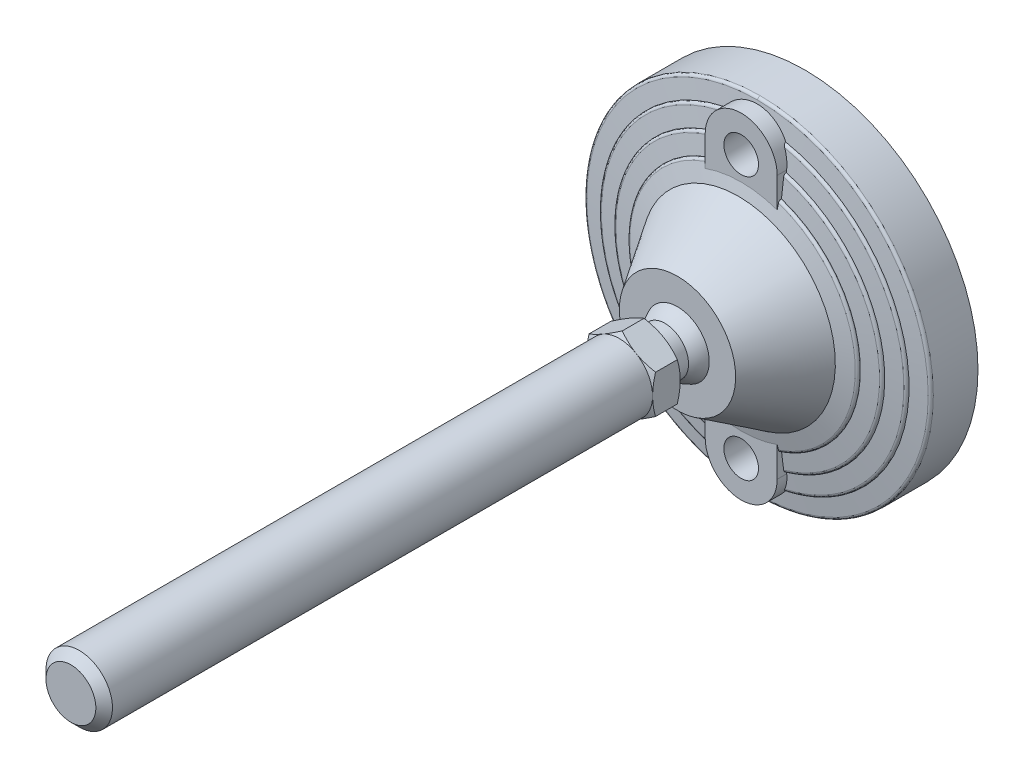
ISO-10303-21;
HEADER;
FILE_DESCRIPTION(('STEP AP214'),'2;1');
FILE_NAME('part.step','',(''),(''),'','','');
FILE_SCHEMA(('AUTOMOTIVE_DESIGN { 1 0 10303 214 1 1 1 1 }'));
ENDSEC;
DATA;
#1=APPLICATION_CONTEXT('core data for automotive mechanical design processes');
#2=APPLICATION_PROTOCOL_DEFINITION('international standard','automotive_design',2000,#1);
#3=PRODUCT_CONTEXT('',#1,'mechanical');
#4=PRODUCT('Part','Part','',(#3));
#5=PRODUCT_RELATED_PRODUCT_CATEGORY('part','',(#4));
#6=PRODUCT_DEFINITION_FORMATION('','',#4);
#7=PRODUCT_DEFINITION_CONTEXT('part definition',#1,'design');
#8=PRODUCT_DEFINITION('design','',#6,#7);
#9=PRODUCT_DEFINITION_SHAPE('','',#8);
#10=(LENGTH_UNIT() NAMED_UNIT(*) SI_UNIT(.MILLI.,.METRE.));
#11=(NAMED_UNIT(*) PLANE_ANGLE_UNIT() SI_UNIT($,.RADIAN.));
#12=(NAMED_UNIT(*) SI_UNIT($,.STERADIAN.) SOLID_ANGLE_UNIT());
#13=UNCERTAINTY_MEASURE_WITH_UNIT(LENGTH_MEASURE(1.E-05),#10,'distance_accuracy_value','');
#14=(GEOMETRIC_REPRESENTATION_CONTEXT(3) GLOBAL_UNCERTAINTY_ASSIGNED_CONTEXT((#13)) GLOBAL_UNIT_ASSIGNED_CONTEXT((#10,
#11,#12)) REPRESENTATION_CONTEXT('',''));
#15=CARTESIAN_POINT('',(0.,0.,0.));
#16=DIRECTION('',(0.,0.,1.));
#17=DIRECTION('',(1.,0.,0.));
#18=AXIS2_PLACEMENT_3D('',#15,#16,#17);
#19=CARTESIAN_POINT('',(-12.,14.022683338,57.));
#20=DIRECTION('',(0.,0.,1.));
#21=DIRECTION('',(0.,-1.,0.));
#22=AXIS2_PLACEMENT_3D('',#19,#20,#21);
#23=PLANE('',#22);
#24=CARTESIAN_POINT('',(0.,0.,57.));
#25=DIRECTION('',(0.,0.,-1.));
#26=DIRECTION('',(1.,0.,0.));
#27=AXIS2_PLACEMENT_3D('',#24,#25,#26);
#28=CIRCLE('',#27,8.5);
#29=CARTESIAN_POINT('',(8.5,0.,57.));
#30=VERTEX_POINT('',#29);
#31=EDGE_CURVE('E549',#30,#30,#28,.T.);
#32=ORIENTED_EDGE('',*,*,#31,.F.);
#33=EDGE_LOOP('',(#32));
#34=FACE_BOUND('',#33,.T.);
#35=CARTESIAN_POINT('',(0.,0.,57.));
#36=DIRECTION('',(0.,0.,1.));
#37=DIRECTION('',(0.,-1.,0.));
#38=AXIS2_PLACEMENT_3D('',#35,#36,#37);
#39=CIRCLE('',#38,12.);
#40=CARTESIAN_POINT('',(6.00000000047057,-10.3923048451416,57.));
#41=VERTEX_POINT('',#40);
#42=CARTESIAN_POINT('',(-6.00000000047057,-10.3923048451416,57.));
#43=VERTEX_POINT('',#42);
#44=EDGE_CURVE('E26',#41,#43,#39,.F.);
#45=ORIENTED_EDGE('',*,*,#44,.T.);
#46=CARTESIAN_POINT('',(-12.,0.,57.));
#47=VERTEX_POINT('',#46);
#48=EDGE_CURVE('E9',#43,#47,#39,.F.);
#49=ORIENTED_EDGE('',*,*,#48,.T.);
#50=CARTESIAN_POINT('',(-6.00000000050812,10.3923048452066,57.));
#51=VERTEX_POINT('',#50);
#52=EDGE_CURVE('E25',#47,#51,#39,.F.);
#53=ORIENTED_EDGE('',*,*,#52,.T.);
#54=CARTESIAN_POINT('',(6.00000000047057,10.3923048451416,57.));
#55=VERTEX_POINT('',#54);
#56=EDGE_CURVE('E239',#51,#55,#39,.F.);
#57=ORIENTED_EDGE('',*,*,#56,.T.);
#58=CARTESIAN_POINT('',(0.,0.,57.));
#59=DIRECTION('',(0.,0.,-1.));
#60=DIRECTION('',(0.,1.,0.));
#61=AXIS2_PLACEMENT_3D('',#58,#59,#60);
#62=CIRCLE('',#61,12.);
#63=CARTESIAN_POINT('',(12.,0.,57.));
#64=VERTEX_POINT('',#63);
#65=EDGE_CURVE('E253',#55,#64,#62,.T.);
#66=ORIENTED_EDGE('',*,*,#65,.T.);
#67=EDGE_CURVE('E262',#64,#41,#39,.F.);
#68=ORIENTED_EDGE('',*,*,#67,.T.);
#69=EDGE_LOOP('',(#45,#49,#53,#57,#66,#68));
#70=FACE_BOUND('',#69,.T.);
#71=ADVANCED_FACE('F14',(#34,#70),#23,.F.);
#72=CARTESIAN_POINT('',(0.,0.,57.));
#73=DIRECTION('',(0.,0.,-1.));
#74=DIRECTION('',(1.,0.,0.));
#75=AXIS2_PLACEMENT_3D('',#72,#73,#74);
#76=CYLINDRICAL_SURFACE('',#75,8.5);
#77=ORIENTED_EDGE('',*,*,#31,.T.);
#78=EDGE_LOOP('',(#77));
#79=FACE_BOUND('',#78,.T.);
#80=CARTESIAN_POINT('',(0.,0.,50.5000000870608));
#81=DIRECTION('',(0.,0.,-1.));
#82=DIRECTION('',(-1.,0.,0.));
#83=AXIS2_PLACEMENT_3D('',#80,#81,#82);
#84=CIRCLE('',#83,8.49999990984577);
#85=CARTESIAN_POINT('',(-8.49999990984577,0.,50.5000000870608));
#86=VERTEX_POINT('',#85);
#87=EDGE_CURVE('E548',#86,#86,#84,.T.);
#88=ORIENTED_EDGE('',*,*,#87,.F.);
#89=EDGE_LOOP('',(#88));
#90=FACE_BOUND('',#89,.T.);
#91=ADVANCED_FACE('F367',(#79,#90),#76,.T.);
#92=CARTESIAN_POINT('',(0.,0.,41.678860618));
#93=DIRECTION('',(0.,0.,-1.));
#94=DIRECTION('',(1.,0.,0.));
#95=AXIS2_PLACEMENT_3D('',#92,#93,#94);
#96=SPHERICAL_SURFACE('',#95,12.25);
#97=CARTESIAN_POINT('',(0.,0.,46.));
#98=DIRECTION('',(0.,0.,-1.));
#99=DIRECTION('',(0.,1.,0.));
#100=AXIS2_PLACEMENT_3D('',#97,#98,#99);
#101=CIRCLE('',#100,11.4625588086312);
#102=CARTESIAN_POINT('',(0.,11.4625588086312,46.));
#103=VERTEX_POINT('',#102);
#104=EDGE_CURVE('E545',#103,#103,#101,.F.);
#105=ORIENTED_EDGE('',*,*,#104,.T.);
#106=EDGE_LOOP('',(#105));
#107=FACE_BOUND('',#106,.T.);
#108=ORIENTED_EDGE('',*,*,#87,.T.);
#109=EDGE_LOOP('',(#108));
#110=FACE_BOUND('',#109,.T.);
#111=ADVANCED_FACE('F362',(#107,#110),#96,.T.);
#112=CARTESIAN_POINT('',(-21.325127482,-21.252,46.));
#113=DIRECTION('',(0.,0.,-1.));
#114=DIRECTION('',(0.,1.,0.));
#115=AXIS2_PLACEMENT_3D('',#112,#113,#114);
#116=PLANE('',#115);
#117=ORIENTED_EDGE('',*,*,#104,.F.);
#118=EDGE_LOOP('',(#117));
#119=FACE_BOUND('',#118,.T.);
#120=CARTESIAN_POINT('',(0.,0.,46.));
#121=DIRECTION('',(0.,0.,-1.));
#122=DIRECTION('',(0.,1.,0.));
#123=AXIS2_PLACEMENT_3D('',#120,#121,#122);
#124=CIRCLE('',#123,21.);
#125=CARTESIAN_POINT('',(0.,21.,46.));
#126=VERTEX_POINT('',#125);
#127=EDGE_CURVE('E408',#126,#126,#124,.T.);
#128=ORIENTED_EDGE('',*,*,#127,.F.);
#129=EDGE_LOOP('',(#128));
#130=FACE_BOUND('',#129,.T.);
#131=ADVANCED_FACE('F366',(#119,#130),#116,.F.);
#132=CARTESIAN_POINT('',(0.,-47.5,0.));
#133=DIRECTION('',(0.,0.,1.));
#134=DIRECTION('',(0.,-1.,0.));
#135=AXIS2_PLACEMENT_3D('',#132,#133,#134);
#136=CYLINDRICAL_SURFACE('',#135,6.25);
#137=CARTESIAN_POINT('',(0.,-47.5,0.));
#138=DIRECTION('',(0.,0.,1.));
#139=DIRECTION('',(0.,-1.,0.));
#140=AXIS2_PLACEMENT_3D('',#137,#138,#139);
#141=CIRCLE('',#140,6.25);
#142=CARTESIAN_POINT('',(0.,-53.75,0.));
#143=VERTEX_POINT('',#142);
#144=EDGE_CURVE('E541',#143,#143,#141,.F.);
#145=ORIENTED_EDGE('',*,*,#144,.T.);
#146=EDGE_LOOP('',(#145));
#147=FACE_BOUND('',#146,.T.);
#148=CARTESIAN_POINT('',(0.,-47.5,23.));
#149=DIRECTION('',(0.,0.,1.));
#150=DIRECTION('',(0.,-1.,0.));
#151=AXIS2_PLACEMENT_3D('',#148,#149,#150);
#152=CIRCLE('',#151,6.25);
#153=CARTESIAN_POINT('',(0.,-53.75,23.));
#154=VERTEX_POINT('',#153);
#155=EDGE_CURVE('E745',#154,#154,#152,.T.);
#156=ORIENTED_EDGE('',*,*,#155,.T.);
#157=EDGE_LOOP('',(#156));
#158=FACE_BOUND('',#157,.T.);
#159=ADVANCED_FACE('F370',(#147,#158),#136,.F.);
#160=CARTESIAN_POINT('',(-63.467641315,63.25,0.));
#161=DIRECTION('',(0.,0.,1.));
#162=DIRECTION('',(0.,-1.,0.));
#163=AXIS2_PLACEMENT_3D('',#160,#161,#162);
#164=PLANE('',#163);
#165=ORIENTED_EDGE('',*,*,#144,.F.);
#166=EDGE_LOOP('',(#165));
#167=FACE_BOUND('',#166,.T.);
#168=CARTESIAN_POINT('',(0.,47.5,0.));
#169=DIRECTION('',(0.,0.,1.));
#170=DIRECTION('',(0.,-1.,0.));
#171=AXIS2_PLACEMENT_3D('',#168,#169,#170);
#172=CIRCLE('',#171,6.25);
#173=CARTESIAN_POINT('',(0.,41.25,0.));
#174=VERTEX_POINT('',#173);
#175=EDGE_CURVE('E603',#174,#174,#172,.T.);
#176=ORIENTED_EDGE('',*,*,#175,.T.);
#177=EDGE_LOOP('',(#176));
#178=FACE_BOUND('',#177,.T.);
#179=CARTESIAN_POINT('',(0.,0.,0.));
#180=DIRECTION('',(0.,0.,-1.));
#181=DIRECTION('',(0.,1.,0.));
#182=AXIS2_PLACEMENT_3D('',#179,#180,#181);
#183=CIRCLE('',#182,62.5);
#184=CARTESIAN_POINT('',(0.,62.5,0.));
#185=VERTEX_POINT('',#184);
#186=EDGE_CURVE('E537',#185,#185,#183,.F.);
#187=ORIENTED_EDGE('',*,*,#186,.F.);
#188=EDGE_LOOP('',(#187));
#189=FACE_BOUND('',#188,.T.);
#190=ADVANCED_FACE('F373',(#167,#178,#189),#164,.F.);
#191=CARTESIAN_POINT('',(12.406354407,39.602176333,21.568111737));
#192=CARTESIAN_POINT('',(59.707464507,24.78394183,21.568111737));
#193=CARTESIAN_POINT('',(59.707464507,-24.78394183,21.568111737));
#194=CARTESIAN_POINT('',(12.406354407,-39.602176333,21.568111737));
#195=CARTESIAN_POINT('',(12.406354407,39.602176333,22.044046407));
#196=CARTESIAN_POINT('',(59.707464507,24.78394183,22.044046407));
#197=CARTESIAN_POINT('',(59.707464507,-24.78394183,22.044046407));
#198=CARTESIAN_POINT('',(12.406354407,-39.602176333,22.044046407));
#199=CARTESIAN_POINT('',(12.31903347,39.323440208,22.419805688));
#200=CARTESIAN_POINT('',(59.287219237,24.609502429,22.419805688));
#201=CARTESIAN_POINT('',(59.287219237,-24.609502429,22.419805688));
#202=CARTESIAN_POINT('',(12.31903347,-39.323440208,22.419805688));
#203=CARTESIAN_POINT('',(12.18115046,38.883305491,22.53720891));
#204=CARTESIAN_POINT('',(58.623636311,24.334056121,22.53720891));
#205=CARTESIAN_POINT('',(58.623636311,-24.334056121,22.53720891));
#206=CARTESIAN_POINT('',(12.18115046,-38.883305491,22.53720891));
#207=(BOUNDED_SURFACE() B_SPLINE_SURFACE(3,3,((#191,#192,#193,#194),(#195,#196,#197,#198),(#199,
#200,#201,#202),(#203,#204,#205,#206)),.UNSPECIFIED.,.F.,.F.,
.F.) B_SPLINE_SURFACE_WITH_KNOTS((4,4),(4,4),(0.,1.),(0.,1.),
.UNSPECIFIED.) GEOMETRIC_REPRESENTATION_ITEM() RATIONAL_B_SPLINE_SURFACE(((1.,0.532632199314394,
0.532632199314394,1.),(0.859679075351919,0.457892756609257,0.457892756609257,0.859679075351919),
(0.859679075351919,0.457892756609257,0.457892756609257,0.859679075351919),(1.,0.532632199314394,
0.532632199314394,1.))) REPRESENTATION_ITEM('') SURFACE());
#208=CARTESIAN_POINT('',(0.,0.,22.53720891));
#209=DIRECTION('',(0.,0.,-1.));
#210=DIRECTION('',(0.,1.,0.));
#211=AXIS2_PLACEMENT_3D('',#208,#209,#210);
#212=CIRCLE('',#211,40.746679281);
#213=CARTESIAN_POINT('',(13.,-38.6172483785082,22.5372089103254));
#214=VERTEX_POINT('',#213);
#215=CARTESIAN_POINT('',(13.,38.6172483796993,22.5372089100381));
#216=VERTEX_POINT('',#215);
#217=EDGE_CURVE('E738',#214,#216,#212,.F.);
#218=CARTESIAN_POINT('',(13.,-39.4112927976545,21.5681117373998));
#219=CARTESIAN_POINT('',(13.,-39.4112933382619,21.5952104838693));
#220=CARTESIAN_POINT('',(13.,-39.4101321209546,21.6222958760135));
#221=CARTESIAN_POINT('',(13.,-39.4055044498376,21.6762650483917));
#222=CARTESIAN_POINT('',(13.,-39.4020383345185,21.7031488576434));
#223=CARTESIAN_POINT('',(13.,-39.388233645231,21.783107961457));
#224=CARTESIAN_POINT('',(13.,-39.3744885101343,21.8356344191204));
#225=CARTESIAN_POINT('',(13.,-39.338408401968,21.9376087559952));
#226=CARTESIAN_POINT('',(13.,-39.3160736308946,21.9870567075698));
#227=CARTESIAN_POINT('',(13.,-39.2635909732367,22.0816017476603));
#228=CARTESIAN_POINT('',(13.,-39.2334440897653,22.126699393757));
#229=CARTESIAN_POINT('',(13.,-39.1656058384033,22.2123360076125));
#230=CARTESIAN_POINT('',(13.,-39.1277714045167,22.2527614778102));
#231=CARTESIAN_POINT('',(13.,-39.0461074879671,22.3270714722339));
#232=CARTESIAN_POINT('',(13.,-39.0022718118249,22.3609491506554));
#233=CARTESIAN_POINT('',(13.,-38.9043172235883,22.4250520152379));
#234=CARTESIAN_POINT('',(13.,-38.8495953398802,22.454364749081));
#235=CARTESIAN_POINT('',(13.,-38.7644641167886,22.4909906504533));
#236=CARTESIAN_POINT('',(13.,-38.735575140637,22.5019763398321));
#237=CARTESIAN_POINT('',(13.,-38.6769796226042,22.5214626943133));
#238=CARTESIAN_POINT('',(13.,-38.647273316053,22.529964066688));
#239=CARTESIAN_POINT('',(13.,-38.617248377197,22.5372089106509));
#240=B_SPLINE_CURVE_WITH_KNOTS('',3,(#218,#219,#220,#221,#222,#223,#224,#225,#226,#227,#228,
#229,#230,#231,#232,#233,#234,#235,#236,#237,#238,#239),.UNSPECIFIED.,.F.,.F.,(4,2,2,2,2,2,2,2,
2,2,4),(0.,0.0812450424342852,0.162478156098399,0.324519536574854,0.486557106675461,
0.648573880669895,0.813939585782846,0.979477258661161,1.16468654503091,1.25731455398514,
1.34991616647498),.UNSPECIFIED.);
#241=CARTESIAN_POINT('',(13.,-39.4112927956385,21.568111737));
#242=VERTEX_POINT('',#241);
#243=EDGE_CURVE('E400',#242,#214,#240,.T.);
#244=CARTESIAN_POINT('',(0.,0.,21.568111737));
#245=DIRECTION('',(0.,0.,-1.));
#246=DIRECTION('',(0.,1.,0.));
#247=AXIS2_PLACEMENT_3D('',#244,#245,#246);
#248=CIRCLE('',#247,41.5);
#249=CARTESIAN_POINT('',(13.,39.4112927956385,21.5681117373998));
#250=VERTEX_POINT('',#249);
#251=EDGE_CURVE('E544',#250,#242,#248,.T.);
#252=CARTESIAN_POINT('',(13.,38.6172483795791,22.5372089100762));
#253=CARTESIAN_POINT('',(13.,38.675727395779,22.5231434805));
#254=CARTESIAN_POINT('',(13.,38.7330575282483,22.5042077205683));
#255=CARTESIAN_POINT('',(13.,38.8438981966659,22.4570874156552));
#256=CARTESIAN_POINT('',(13.,38.8974017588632,22.4288864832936));
#257=CARTESIAN_POINT('',(13.,38.9989209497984,22.3637346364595));
#258=CARTESIAN_POINT('',(13.,39.0469285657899,22.3267711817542));
#259=CARTESIAN_POINT('',(13.,39.1357078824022,22.2450475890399));
#260=CARTESIAN_POINT('',(13.,39.1764870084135,22.2002955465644));
#261=CARTESIAN_POINT('',(13.,39.2479885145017,22.1059931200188));
#262=CARTESIAN_POINT('',(13.,39.2790300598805,22.0566848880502));
#263=CARTESIAN_POINT('',(13.,39.3318958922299,21.9533393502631));
#264=CARTESIAN_POINT('',(13.,39.3537228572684,21.8993034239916));
#265=CARTESIAN_POINT('',(13.,39.3839717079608,21.799136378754));
#266=CARTESIAN_POINT('',(13.,39.3941848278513,21.7535382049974));
#267=CARTESIAN_POINT('',(13.,39.4078594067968,21.6613400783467));
#268=CARTESIAN_POINT('',(13.,39.4113205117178,21.6147400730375));
#269=CARTESIAN_POINT('',(13.,39.4112927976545,21.5681117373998));
#270=B_SPLINE_CURVE_WITH_KNOTS('',3,(#252,#253,#254,#255,#256,#257,#258,#259,#260,#261,#262,
#263,#264,#265,#266,#267,#268,#269),.UNSPECIFIED.,.F.,.F.,(4,2,2,2,2,2,2,2,4),(0.,
0.180276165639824,0.360872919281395,0.541729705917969,0.722399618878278,0.896310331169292,
1.07017046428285,1.20986980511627,1.34957647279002),.UNSPECIFIED.);
#271=EDGE_CURVE('E391',#216,#250,#270,.T.);
#272=ORIENTED_EDGE('',*,*,#217,.F.);
#273=ORIENTED_EDGE('',*,*,#243,.F.);
#274=ORIENTED_EDGE('',*,*,#251,.F.);
#275=ORIENTED_EDGE('',*,*,#271,.F.);
#276=EDGE_LOOP('',(#272,#273,#274,#275));
#277=FACE_BOUND('',#276,.T.);
#278=ADVANCED_FACE('F375',(#277),#207,.T.);
#279=CARTESIAN_POINT('',(0.,0.,21.568111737));
#280=DIRECTION('',(0.,0.,-1.));
#281=DIRECTION('',(1.,0.,0.));
#282=AXIS2_PLACEMENT_3D('',#279,#280,#281);
#283=CYLINDRICAL_SURFACE('',#282,41.5);
#284=CARTESIAN_POINT('',(0.,0.,21.4545454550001));
#285=DIRECTION('',(0.,0.,-1.));
#286=DIRECTION('',(0.,1.,0.));
#287=AXIS2_PLACEMENT_3D('',#284,#285,#286);
#288=CIRCLE('',#287,41.5);
#289=CARTESIAN_POINT('',(13.,39.4112927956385,21.4545454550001));
#290=VERTEX_POINT('',#289);
#291=CARTESIAN_POINT('',(13.,-39.4112927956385,21.4545454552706));
#292=VERTEX_POINT('',#291);
#293=EDGE_CURVE('E736',#290,#292,#288,.T.);
#294=ORIENTED_EDGE('',*,*,#293,.F.);
#295=DIRECTION('',(0.,0.,-1.));
#296=VECTOR('',#295,1.);
#297=CARTESIAN_POINT('',(13.,39.4112927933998,21.278571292));
#298=LINE('',#297,#296);
#299=EDGE_CURVE('E628',#250,#290,#298,.T.);
#300=ORIENTED_EDGE('',*,*,#299,.F.);
#301=ORIENTED_EDGE('',*,*,#251,.T.);
#302=DIRECTION('',(0.,0.,1.));
#303=VECTOR('',#302,1.);
#304=CARTESIAN_POINT('',(13.,-39.4112927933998,21.278571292));
#305=LINE('',#304,#303);
#306=EDGE_CURVE('E409',#292,#242,#305,.T.);
#307=ORIENTED_EDGE('',*,*,#306,.F.);
#308=EDGE_LOOP('',(#294,#300,#301,#307));
#309=FACE_BOUND('',#308,.T.);
#310=ADVANCED_FACE('F381',(#309),#283,.T.);
#311=CARTESIAN_POINT('',(0.,0.,21.454545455));
#312=DIRECTION('',(0.,0.,-1.));
#313=DIRECTION('',(0.,1.,0.));
#314=AXIS2_PLACEMENT_3D('',#311,#312,#313);
#315=CONICAL_SURFACE('',#314,41.5,1.4442041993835);
#316=ORIENTED_EDGE('',*,*,#293,.T.);
#317=CARTESIAN_POINT('',(13.,-45.8176832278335,20.6748403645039));
#318=CARTESIAN_POINT('',(13.,-45.2838642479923,20.7402005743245));
#319=CARTESIAN_POINT('',(13.,-44.7500350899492,20.8054777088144));
#320=CARTESIAN_POINT('',(13.,-43.6823542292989,20.9358466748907));
#321=CARTESIAN_POINT('',(13.,-43.1485025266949,21.0009385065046));
#322=CARTESIAN_POINT('',(13.,-42.0807742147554,21.1309177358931));
#323=CARTESIAN_POINT('',(13.,-41.546897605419,21.1958051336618));
#324=CARTESIAN_POINT('',(13.,-40.4791166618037,21.3253520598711));
#325=CARTESIAN_POINT('',(13.,-39.9452123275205,21.3900115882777));
#326=CARTESIAN_POINT('',(13.,-39.4112927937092,21.4545454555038));
#327=B_SPLINE_CURVE_WITH_KNOTS('',3,(#317,#318,#319,#320,#321,#322,#323,#324,#325,#326),
.UNSPECIFIED.,.F.,.F.,(4,2,2,2,4),(0.,1.61341623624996,3.22683223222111,4.84024827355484,
6.45366455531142),.UNSPECIFIED.);
#328=CARTESIAN_POINT('',(13.,-45.8176832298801,20.6748403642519));
#329=VERTEX_POINT('',#328);
#330=EDGE_CURVE('E411',#329,#292,#327,.T.);
#331=ORIENTED_EDGE('',*,*,#330,.F.);
#332=CARTESIAN_POINT('',(-7.4855573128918E-10,0.,20.674840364));
#333=DIRECTION('',(0.,0.,-1.));
#334=DIRECTION('',(0.,1.,0.));
#335=AXIS2_PLACEMENT_3D('',#332,#333,#334);
#336=CIRCLE('',#335,47.6262542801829);
#337=CARTESIAN_POINT('',(13.,45.8176832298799,20.6748403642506));
#338=VERTEX_POINT('',#337);
#339=EDGE_CURVE('E359',#338,#329,#336,.T.);
#340=ORIENTED_EDGE('',*,*,#339,.F.);
#341=CARTESIAN_POINT('',(13.,39.4112927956,21.4545454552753));
#342=CARTESIAN_POINT('',(13.,39.9452123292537,21.3900115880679));
#343=CARTESIAN_POINT('',(13.,40.4791166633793,21.3253520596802));
#344=CARTESIAN_POINT('',(13.,41.5468976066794,21.1958051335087));
#345=CARTESIAN_POINT('',(13.,42.0807742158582,21.1309177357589));
#346=CARTESIAN_POINT('',(13.,43.1485025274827,21.0009385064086));
#347=CARTESIAN_POINT('',(13.,43.682354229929,20.9358466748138));
#348=CARTESIAN_POINT('',(13.,44.7500350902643,20.8054777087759));
#349=CARTESIAN_POINT('',(13.,45.2838642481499,20.7402005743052));
#350=CARTESIAN_POINT('',(13.,45.8176832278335,20.6748403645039));
#351=B_SPLINE_CURVE_WITH_KNOTS('',3,(#341,#342,#343,#344,#345,#346,#347,#348,#349,#350),
.UNSPECIFIED.,.F.,.F.,(4,2,2,2,4),(0.,1.61341628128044,3.22683232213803,4.84024831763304,
6.45366455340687),.UNSPECIFIED.);
#352=EDGE_CURVE('E622',#290,#338,#351,.T.);
#353=ORIENTED_EDGE('',*,*,#352,.F.);
#354=EDGE_LOOP('',(#316,#331,#340,#353));
#355=FACE_BOUND('',#354,.T.);
#356=ADVANCED_FACE('F512',(#355),#315,.T.);
#357=CARTESIAN_POINT('',(12.269850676,46.922284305,19.669623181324));
#358=CARTESIAN_POINT('',(72.557631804,31.157449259,19.6696231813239));
#359=CARTESIAN_POINT('',(72.557631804,-31.157449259,19.6696231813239));
#360=CARTESIAN_POINT('',(12.269850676,-46.922284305,19.669623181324));
#361=CARTESIAN_POINT('',(12.269850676,46.922284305,19.6740296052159));
#362=CARTESIAN_POINT('',(72.557631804,31.157449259,19.674029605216));
#363=CARTESIAN_POINT('',(72.557631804,-31.157449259,19.674029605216));
#364=CARTESIAN_POINT('',(12.269850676,-46.922284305,19.6740296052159));
#365=CARTESIAN_POINT('',(12.269850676,46.922284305,19.678436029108));
#366=CARTESIAN_POINT('',(72.557631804,31.157449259,19.678436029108));
#367=CARTESIAN_POINT('',(72.557631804,-31.157449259,19.678436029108));
#368=CARTESIAN_POINT('',(12.269850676,-46.922284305,19.678436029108));
#369=CARTESIAN_POINT('',(12.269850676,46.922284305,19.682842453));
#370=CARTESIAN_POINT('',(72.557631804,31.157449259,19.682842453));
#371=CARTESIAN_POINT('',(72.557631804,-31.157449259,19.682842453));
#372=CARTESIAN_POINT('',(12.269850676,-46.922284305,19.682842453));
#373=CARTESIAN_POINT('',(12.269850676,46.922284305,20.211436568));
#374=CARTESIAN_POINT('',(72.557631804,31.157449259,20.211436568));
#375=CARTESIAN_POINT('',(72.557631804,-31.157449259,20.211436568));
#376=CARTESIAN_POINT('',(12.269850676,-46.922284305,20.211436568));
#377=CARTESIAN_POINT('',(12.181461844,46.584268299,20.608103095));
#378=CARTESIAN_POINT('',(72.0349453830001,30.93299905,20.608103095));
#379=CARTESIAN_POINT('',(72.0349453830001,-30.93299905,20.608103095));
#380=CARTESIAN_POINT('',(12.181461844,-46.584268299,20.608103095));
#381=CARTESIAN_POINT('',(12.048804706,46.076961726,20.674840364));
#382=CARTESIAN_POINT('',(71.250478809,30.596136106,20.674840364));
#383=CARTESIAN_POINT('',(71.250478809,-30.596136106,20.674840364));
#384=CARTESIAN_POINT('',(12.048804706,-46.076961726,20.674840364));
#385=(BOUNDED_SURFACE() B_SPLINE_SURFACE(3,3,((#357,#358,#359,#360),(#361,#362,#363,#364),(#365,
#366,#367,#368),(#369,#370,#371,#372),(#373,#374,#375,#376),(#377,#378,#379,#380),(#381,#382,
#383,#384)),.UNSPECIFIED.,.F.,.F.,.F.) B_SPLINE_SURFACE_WITH_KNOTS((4,3,4),(4,4),(-0.01,0.,1.),
(0.,1.),.UNSPECIFIED.) GEOMETRIC_REPRESENTATION_ITEM() RATIONAL_B_SPLINE_SURFACE(((1.,
0.501991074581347,0.501991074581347,1.),(1.,0.501991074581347,0.501991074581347,1.),(1.,
0.501991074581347,0.501991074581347,1.),(1.,0.501991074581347,0.501991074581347,1.),
(0.833611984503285,0.418465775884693,0.418465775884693,0.833611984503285),(0.833611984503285,
0.418465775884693,0.418465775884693,0.833611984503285),(1.,0.501991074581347,0.501991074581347,1.))) REPRESENTATION_ITEM('') SURFACE());
#386=CARTESIAN_POINT('',(13.,-46.7252608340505,19.6777848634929));
#387=CARTESIAN_POINT('',(13.,-46.7253979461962,19.7054287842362));
#388=CARTESIAN_POINT('',(13.,-46.7243484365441,19.7330653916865));
#389=CARTESIAN_POINT('',(13.,-46.7198870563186,19.7881439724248));
#390=CARTESIAN_POINT('',(13.,-46.7164754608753,19.8155859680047));
#391=CARTESIAN_POINT('',(13.,-46.7027375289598,19.8972169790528));
#392=CARTESIAN_POINT('',(13.,-46.6889086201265,19.950857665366));
#393=CARTESIAN_POINT('',(13.,-46.652370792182,20.0550506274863));
#394=CARTESIAN_POINT('',(13.,-46.6296523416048,20.1055995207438));
#395=CARTESIAN_POINT('',(13.,-46.5760978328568,20.2021956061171));
#396=CARTESIAN_POINT('',(13.,-46.5452617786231,20.2482428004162));
#397=CARTESIAN_POINT('',(13.,-46.4762858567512,20.3348542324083));
#398=CARTESIAN_POINT('',(13.,-46.4381108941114,20.3753904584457));
#399=CARTESIAN_POINT('',(13.,-46.3556866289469,20.4497572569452));
#400=CARTESIAN_POINT('',(13.,-46.3114344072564,20.483584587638));
#401=CARTESIAN_POINT('',(13.,-46.2164675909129,20.544827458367));
#402=CARTESIAN_POINT('',(13.,-46.1655796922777,20.5719736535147));
#403=CARTESIAN_POINT('',(13.,-46.0601083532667,20.6176355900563));
#404=CARTESIAN_POINT('',(13.,-46.0055288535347,20.6361603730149));
#405=CARTESIAN_POINT('',(13.,-45.9281089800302,20.6556819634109));
#406=CARTESIAN_POINT('',(13.,-45.9061721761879,20.6604842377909));
#407=CARTESIAN_POINT('',(13.,-45.8620822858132,20.6686997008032));
#408=CARTESIAN_POINT('',(13.,-45.8399296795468,20.6721154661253));
#409=CARTESIAN_POINT('',(13.0000000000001,-45.8176832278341,20.6748403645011));
#410=B_SPLINE_CURVE_WITH_KNOTS('',3,(#386,#387,#388,#389,#390,#391,#392,#393,#394,#395,#396,
#397,#398,#399,#400,#401,#402,#403,#404,#405,#406,#407,#408,#409),.UNSPECIFIED.,.F.,.F.,(4,2,2,
2,2,2,2,2,2,2,2,4),(0.,0.082881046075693,0.165752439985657,0.331061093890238,0.496547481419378,
0.662033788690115,0.828332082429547,0.994710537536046,1.16697834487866,1.33906507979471,
1.40639957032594,1.47360834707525),.UNSPECIFIED.);
#411=CARTESIAN_POINT('',(13.0000000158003,-46.7252608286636,19.6777848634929));
#412=VERTEX_POINT('',#411);
#413=EDGE_CURVE('E536',#412,#329,#410,.T.);
#414=CARTESIAN_POINT('',(13.0000000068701,46.7252608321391,19.6727272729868));
#415=CARTESIAN_POINT('',(13.3212147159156,46.635891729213,19.6727272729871));
#416=CARTESIAN_POINT('',(13.6414983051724,46.5432129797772,19.6727272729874));
#417=CARTESIAN_POINT('',(14.2801231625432,46.3512597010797,19.672727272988));
#418=CARTESIAN_POINT('',(14.5984642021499,46.2519844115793,19.6727272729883));
#419=CARTESIAN_POINT('',(15.5526106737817,45.9435979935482,19.6727272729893));
#420=CARTESIAN_POINT('',(16.1852411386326,45.7245656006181,19.6727272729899));
#421=CARTESIAN_POINT('',(17.4409289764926,45.2604918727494,19.6727272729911));
#422=CARTESIAN_POINT('',(18.0639854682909,45.01544815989,19.6727272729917));
#423=CARTESIAN_POINT('',(19.3000708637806,44.4995075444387,19.672727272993));
#424=CARTESIAN_POINT('',(19.9130888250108,44.228584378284,19.6727272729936));
#425=CARTESIAN_POINT('',(21.1274202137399,43.6615551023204,19.6727272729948));
#426=CARTESIAN_POINT('',(21.7287319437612,43.3654453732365,19.6727272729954));
#427=CARTESIAN_POINT('',(23.5288179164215,42.4321391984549,19.6727272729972));
#428=CARTESIAN_POINT('',(24.7079785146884,41.7565378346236,19.6727272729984));
#429=CARTESIAN_POINT('',(27.0057517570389,40.308619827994,19.6727272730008));
#430=CARTESIAN_POINT('',(28.1243409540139,39.5362661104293,19.672727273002));
#431=CARTESIAN_POINT('',(30.294054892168,37.8994558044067,19.6727272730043));
#432=CARTESIAN_POINT('',(31.3451007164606,37.0348945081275,19.6727272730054));
#433=CARTESIAN_POINT('',(33.3707378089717,35.2206260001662,19.6727272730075));
#434=CARTESIAN_POINT('',(34.3453363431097,34.2709268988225,19.6727272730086));
#435=CARTESIAN_POINT('',(36.2141318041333,32.2900336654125,19.6727272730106));
#436=CARTESIAN_POINT('',(37.1080775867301,31.2586025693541,19.6727272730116));
#437=CARTESIAN_POINT('',(38.8059105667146,29.1240638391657,19.6727272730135));
#438=CARTESIAN_POINT('',(39.6097954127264,28.0209543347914,19.6727272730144));
#439=CARTESIAN_POINT('',(41.1215543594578,25.7512426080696,19.6727272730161));
#440=CARTESIAN_POINT('',(41.8294551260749,24.5846581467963,19.6727272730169));
#441=CARTESIAN_POINT('',(43.1444737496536,22.196015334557,19.6727272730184));
#442=CARTESIAN_POINT('',(43.7515922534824,20.97395733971,19.6727272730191));
#443=CARTESIAN_POINT('',(44.8608053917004,18.4828923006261,19.6727272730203));
#444=CARTESIAN_POINT('',(45.3628870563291,17.2138794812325,19.6727272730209));
#445=CARTESIAN_POINT('',(46.2583633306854,14.6380667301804,19.6727272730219));
#446=CARTESIAN_POINT('',(46.6517577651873,13.3312667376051,19.6727272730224));
#447=CARTESIAN_POINT('',(47.3270705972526,10.6891374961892,19.6727272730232));
#448=CARTESIAN_POINT('',(47.6089860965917,9.35380750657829,19.6727272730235));
#449=CARTESIAN_POINT('',(48.0593220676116,6.6641453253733,19.672727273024));
#450=CARTESIAN_POINT('',(48.2277425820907,5.30981314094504,19.6727272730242));
#451=CARTESIAN_POINT('',(48.449886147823,2.59183878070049,19.6727272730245));
#452=CARTESIAN_POINT('',(48.5036145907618,1.22819704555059,19.6727272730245));
#453=CARTESIAN_POINT('',(48.4960080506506,-1.49876561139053,19.6727272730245));
#454=CARTESIAN_POINT('',(48.4346730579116,-2.86208653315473,19.6727272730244));
#455=CARTESIAN_POINT('',(48.1973677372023,-5.57880747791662,19.6727272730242));
#456=CARTESIAN_POINT('',(48.0213896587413,-6.93220682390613,19.672727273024));
#457=CARTESIAN_POINT('',(47.556041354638,-9.61936956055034,19.6727272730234));
#458=CARTESIAN_POINT('',(47.2666711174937,-10.9531329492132,19.6727272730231));
#459=CARTESIAN_POINT('',(46.5765756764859,-13.5916227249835,19.6727272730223));
#460=CARTESIAN_POINT('',(46.1758433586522,-14.8963472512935,19.6727272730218));
#461=CARTESIAN_POINT('',(45.2658742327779,-17.4674022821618,19.6727272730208));
#462=CARTESIAN_POINT('',(44.7566374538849,-18.733732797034,19.6727272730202));
#463=CARTESIAN_POINT('',(43.6334165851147,-21.2187182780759,19.6727272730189));
#464=CARTESIAN_POINT('',(43.0194530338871,-22.4373825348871,19.6727272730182));
#465=CARTESIAN_POINT('',(41.6909757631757,-24.8187625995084,19.6727272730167));
#466=CARTESIAN_POINT('',(40.9764619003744,-25.9814783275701,19.6727272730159));
#467=CARTESIAN_POINT('',(39.706302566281,-27.8655028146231,19.6727272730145));
#468=CARTESIAN_POINT('',(39.1770724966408,-28.6047764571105,19.6727272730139));
#469=CARTESIAN_POINT('',(38.0778809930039,-30.0524665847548,19.6727272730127));
#470=CARTESIAN_POINT('',(37.5079195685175,-30.7608830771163,19.672727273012));
#471=CARTESIAN_POINT('',(36.3291070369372,-32.1445499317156,19.6727272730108));
#472=CARTESIAN_POINT('',(35.7202564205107,-32.8198007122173,19.6727272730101));
#473=CARTESIAN_POINT('',(34.4653645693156,-34.1352484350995,19.6727272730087));
#474=CARTESIAN_POINT('',(33.8193109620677,-34.7754335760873,19.672727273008));
#475=CARTESIAN_POINT('',(32.4922294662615,-36.0184899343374,19.6727272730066));
#476=CARTESIAN_POINT('',(31.8112009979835,-36.6213605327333,19.6727272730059));
#477=CARTESIAN_POINT('',(30.416308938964,-37.7878929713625,19.6727272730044));
#478=CARTESIAN_POINT('',(29.7024437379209,-38.3515528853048,19.6727272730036));
#479=CARTESIAN_POINT('',(28.1769516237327,-39.4879139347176,19.672727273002));
#480=CARTESIAN_POINT('',(27.3623770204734,-40.0566641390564,19.6727272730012));
#481=CARTESIAN_POINT('',(25.6997855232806,-41.1431320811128,19.6727272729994));
#482=CARTESIAN_POINT('',(24.8517655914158,-41.6608451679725,19.6727272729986));
#483=CARTESIAN_POINT('',(23.1254909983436,-42.6432641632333,19.6727272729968));
#484=CARTESIAN_POINT('',(22.2472346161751,-43.1079670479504,19.6727272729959));
#485=CARTESIAN_POINT('',(20.4623876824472,-43.9832963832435,19.6727272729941));
#486=CARTESIAN_POINT('',(19.5557530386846,-44.3938329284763,19.6727272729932));
#487=CARTESIAN_POINT('',(17.7189637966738,-45.1583612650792,19.6727272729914));
#488=CARTESIAN_POINT('',(16.7888095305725,-45.5123538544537,19.6727272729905));
#489=CARTESIAN_POINT('',(14.9085132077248,-46.1625049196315,19.6727272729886));
#490=CARTESIAN_POINT('',(13.9583713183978,-46.4586638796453,19.6727272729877));
#491=CARTESIAN_POINT('',(13.0000000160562,-46.7252608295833,19.6727272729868));
#492=B_SPLINE_CURVE_WITH_KNOTS('',3,(#414,#415,#416,#417,#418,#419,#420,#421,#422,#423,#424,
#425,#426,#427,#428,#429,#430,#431,#432,#433,#434,#435,#436,#437,#438,#439,#440,#441,#442,#443,
#444,#445,#446,#447,#448,#449,#450,#451,#452,#453,#454,#455,#456,#457,#458,#459,#460,#461,#462,
#463,#464,#465,#466,#467,#468,#469,#470,#471,#472,#473,#474,#475,#476,#477,#478,#479,#480,#481,
#482,#483,#484,#485,#486,#487,#488,#489,#490,#491),.UNSPECIFIED.,.F.,.F.,(4,2,2,2,2,2,2,2,2,2,2,
2,2,2,2,2,2,2,2,2,2,2,2,2,2,2,2,2,2,2,2,2,2,2,2,2,2,2,4),(0.,1.00020816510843,2.00053180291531,
4.00833027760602,6.01631246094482,8.02635452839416,10.0366859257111,14.1084282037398,
18.1817355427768,22.2597186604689,26.3373137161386,30.4271967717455,34.5171865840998,
38.6060377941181,42.6948627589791,46.7841923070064,50.8735284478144,54.9629708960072,
59.0524118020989,63.1416604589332,67.2309094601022,71.3204349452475,75.4099608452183,
79.499748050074,83.5895341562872,87.6785191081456,91.7675098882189,94.4937471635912,
97.2199838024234,99.9461860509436,102.673300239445,105.400459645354,108.127752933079,
111.106299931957,114.085118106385,117.064106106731,120.047978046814,123.031807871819,
126.015612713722),.UNSPECIFIED.);
#493=CARTESIAN_POINT('',(13.0000000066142,46.7252608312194,19.6777848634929));
#494=VERTEX_POINT('',#493);
#495=EDGE_CURVE('E502',#494,#412,#492,.T.);
#496=CARTESIAN_POINT('',(13.,45.8176832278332,20.6748403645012));
#497=CARTESIAN_POINT('',(13.,45.8768916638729,20.6676266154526));
#498=CARTESIAN_POINT('',(13.,45.9354849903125,20.6554311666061));
#499=CARTESIAN_POINT('',(13.,46.049876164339,20.6214764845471));
#500=CARTESIAN_POINT('',(13.,46.1056719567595,20.599710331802));
#501=CARTESIAN_POINT('',(13.,46.2128716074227,20.5469963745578));
#502=CARTESIAN_POINT('',(13.,46.2642705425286,20.5160384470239));
#503=CARTESIAN_POINT('',(13.,46.3367247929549,20.4633763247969));
#504=CARTESIAN_POINT('',(13.,46.3600988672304,20.4447881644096));
#505=CARTESIAN_POINT('',(13.,46.4051654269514,20.4056252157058));
#506=CARTESIAN_POINT('',(13.,46.4268560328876,20.3850482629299));
#507=CARTESIAN_POINT('',(13.,46.4880645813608,20.3216088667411));
#508=CARTESIAN_POINT('',(13.,46.5249454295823,20.276143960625));
#509=CARTESIAN_POINT('',(13.,46.5901806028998,20.1794685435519));
#510=CARTESIAN_POINT('',(13.,46.6185381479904,20.1282602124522));
#511=CARTESIAN_POINT('',(13.,46.6534889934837,20.0492930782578));
#512=CARTESIAN_POINT('',(13.,46.6637514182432,20.0231112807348));
#513=CARTESIAN_POINT('',(13.,46.6819716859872,19.9699855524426));
#514=CARTESIAN_POINT('',(13.,46.6899313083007,19.9430422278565));
#515=CARTESIAN_POINT('',(13.,46.7102220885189,19.8614024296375));
#516=CARTESIAN_POINT('',(13.,46.719027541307,19.8057552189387));
#517=CARTESIAN_POINT('',(13.,46.7237631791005,19.7378782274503));
#518=CARTESIAN_POINT('',(13.,46.7243742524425,19.7258595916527));
#519=CARTESIAN_POINT('',(13.,46.725149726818,19.7018236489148));
#520=CARTESIAN_POINT('',(13.,46.7253147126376,19.6898063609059));
#521=CARTESIAN_POINT('',(13.,46.7252608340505,19.6777848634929));
#522=B_SPLINE_CURVE_WITH_KNOTS('',3,(#496,#497,#498,#499,#500,#501,#502,#503,#504,#505,#506,
#507,#508,#509,#510,#511,#512,#513,#514,#515,#516,#517,#518,#519,#520,#521),.UNSPECIFIED.,.F.,
.F.,(4,2,2,2,2,2,2,2,2,2,2,2,4),(0.,0.178718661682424,0.357566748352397,0.536612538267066,
0.626107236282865,0.715700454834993,0.890396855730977,1.06502717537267,1.14929679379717,
1.23350112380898,1.40145319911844,1.43755286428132,1.47360518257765),.UNSPECIFIED.);
#523=EDGE_CURVE('E450',#338,#494,#522,.T.);
#524=ORIENTED_EDGE('',*,*,#339,.T.);
#525=ORIENTED_EDGE('',*,*,#413,.F.);
#526=ORIENTED_EDGE('',*,*,#495,.F.);
#527=ORIENTED_EDGE('',*,*,#523,.F.);
#528=EDGE_LOOP('',(#524,#525,#526,#527));
#529=FACE_BOUND('',#528,.T.);
#530=ADVANCED_FACE('F505',(#529),#385,.T.);
#531=CARTESIAN_POINT('',(0.,62.5,16.119206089));
#532=CARTESIAN_POINT('',(125.,62.5,16.119206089));
#533=CARTESIAN_POINT('',(125.,-62.5,16.119206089));
#534=CARTESIAN_POINT('',(0.,-62.5,16.119206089));
#535=CARTESIAN_POINT('',(0.,62.5,16.647800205));
#536=CARTESIAN_POINT('',(125.,62.5,16.647800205));
#537=CARTESIAN_POINT('',(125.,-62.5,16.647800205));
#538=CARTESIAN_POINT('',(0.,-62.5,16.647800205));
#539=CARTESIAN_POINT('',(0.,62.150618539,17.044466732));
#540=CARTESIAN_POINT('',(124.301237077,62.150618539,17.044466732));
#541=CARTESIAN_POINT('',(124.301237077,-62.150618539,17.044466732));
#542=CARTESIAN_POINT('',(0.,-62.150618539,17.044466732));
#543=CARTESIAN_POINT('',(0.,61.62625428,17.111204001));
#544=CARTESIAN_POINT('',(123.252508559,61.6262542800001,17.111204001));
#545=CARTESIAN_POINT('',(123.252508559,-61.6262542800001,17.111204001));
#546=CARTESIAN_POINT('',(0.,-61.62625428,17.111204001));
#547=(BOUNDED_SURFACE() B_SPLINE_SURFACE(3,3,((#531,#532,#533,#534),(#535,#536,#537,#538),(#539,
#540,#541,#542),(#543,#544,#545,#546)),.UNSPECIFIED.,.F.,.F.,
.F.) B_SPLINE_SURFACE_WITH_KNOTS((4,4),(4,4),(0.,1.),(0.,1.),
.UNSPECIFIED.) GEOMETRIC_REPRESENTATION_ITEM() RATIONAL_B_SPLINE_SURFACE(((1.,0.333333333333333,
0.333333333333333,1.),(0.833611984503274,0.277870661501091,0.277870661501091,0.833611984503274),
(0.833611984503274,0.277870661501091,0.277870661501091,0.833611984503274),(1.,0.333333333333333,
0.333333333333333,1.))) REPRESENTATION_ITEM('') SURFACE());
#548=CARTESIAN_POINT('',(0.,0.,16.119206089));
#549=DIRECTION('',(0.,0.,1.));
#550=DIRECTION('',(0.,-1.,0.));
#551=AXIS2_PLACEMENT_3D('',#548,#549,#550);
#552=CIRCLE('',#551,62.5);
#553=CARTESIAN_POINT('',(-9.61422321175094E-09,-62.5,16.119206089));
#554=VERTEX_POINT('',#553);
#555=CARTESIAN_POINT('',(-2.80605088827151E-09,62.5,16.119206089));
#556=VERTEX_POINT('',#555);
#557=EDGE_CURVE('E540',#554,#556,#552,.T.);
#558=CARTESIAN_POINT('',(0.,62.5,16.119206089));
#559=CARTESIAN_POINT('',(0.,62.5,16.647800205));
#560=CARTESIAN_POINT('',(0.,62.150618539,17.044466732));
#561=CARTESIAN_POINT('',(0.,61.62625428,17.111204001));
#562=(BOUNDED_CURVE() B_SPLINE_CURVE(3,(#558,#559,#560,#561),.UNSPECIFIED.,.F.,
.F.) B_SPLINE_CURVE_WITH_KNOTS((4,4),(0.,1.),
.UNSPECIFIED.) CURVE() GEOMETRIC_REPRESENTATION_ITEM() RATIONAL_B_SPLINE_CURVE((1.,
0.833611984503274,0.833611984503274,1.)) REPRESENTATION_ITEM(''));
#563=CARTESIAN_POINT('',(-8.30046746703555E-09,61.6262542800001,17.111204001));
#564=VERTEX_POINT('',#563);
#565=EDGE_CURVE('E696',#564,#556,#562,.F.);
#566=CARTESIAN_POINT('',(0.,0.,17.111204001));
#567=DIRECTION('',(0.,0.,-1.));
#568=DIRECTION('',(0.,1.,0.));
#569=AXIS2_PLACEMENT_3D('',#566,#567,#568);
#570=CIRCLE('',#569,61.62625428);
#571=CARTESIAN_POINT('',(-1.57996950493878E-08,-61.62625428,17.111204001));
#572=VERTEX_POINT('',#571);
#573=EDGE_CURVE('E640',#572,#564,#570,.F.);
#574=CARTESIAN_POINT('',(0.,-62.5,16.119206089));
#575=CARTESIAN_POINT('',(0.,-62.5,16.647800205));
#576=CARTESIAN_POINT('',(0.,-62.150618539,17.044466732));
#577=CARTESIAN_POINT('',(0.,-61.62625428,17.111204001));
#578=(BOUNDED_CURVE() B_SPLINE_CURVE(3,(#574,#575,#576,#577),.UNSPECIFIED.,.F.,
.F.) B_SPLINE_CURVE_WITH_KNOTS((4,4),(0.,1.),
.UNSPECIFIED.) CURVE() GEOMETRIC_REPRESENTATION_ITEM() RATIONAL_B_SPLINE_CURVE((1.,
0.833611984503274,0.833611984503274,1.)) REPRESENTATION_ITEM(''));
#579=EDGE_CURVE('E700',#554,#572,#578,.T.);
#580=ORIENTED_EDGE('',*,*,#557,.T.);
#581=ORIENTED_EDGE('',*,*,#565,.F.);
#582=ORIENTED_EDGE('',*,*,#573,.F.);
#583=ORIENTED_EDGE('',*,*,#579,.F.);
#584=EDGE_LOOP('',(#580,#581,#582,#583));
#585=FACE_BOUND('',#584,.T.);
#586=ADVANCED_FACE('F511',(#585),#547,.T.);
#587=CARTESIAN_POINT('',(0.,0.,16.119206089));
#588=DIRECTION('',(0.,0.,-1.));
#589=DIRECTION('',(0.,1.,0.));
#590=AXIS2_PLACEMENT_3D('',#587,#588,#589);
#591=CYLINDRICAL_SURFACE('',#590,62.5);
#592=ORIENTED_EDGE('',*,*,#557,.F.);
#593=CARTESIAN_POINT('',(0.,0.,16.119206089));
#594=DIRECTION('',(0.,0.,1.));
#595=DIRECTION('',(0.,-1.,0.));
#596=AXIS2_PLACEMENT_3D('',#593,#594,#595);
#597=CIRCLE('',#596,62.5);
#598=EDGE_CURVE('E699',#556,#554,#597,.T.);
#599=ORIENTED_EDGE('',*,*,#598,.F.);
#600=EDGE_LOOP('',(#592,#599));
#601=FACE_BOUND('',#600,.T.);
#602=ORIENTED_EDGE('',*,*,#186,.T.);
#603=EDGE_LOOP('',(#602));
#604=FACE_BOUND('',#603,.T.);
#605=ADVANCED_FACE('F423',(#601,#604),#591,.T.);
#606=CARTESIAN_POINT('',(13.,-47.5,19.557142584));
#607=DIRECTION('',(1.,0.,0.));
#608=DIRECTION('',(0.,1.,0.));
#609=AXIS2_PLACEMENT_3D('',#606,#607,#608);
#610=PLANE('',#609);
#611=ORIENTED_EDGE('',*,*,#306,.T.);
#612=ORIENTED_EDGE('',*,*,#243,.T.);
#613=CARTESIAN_POINT('',(12.999999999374,-36.6937824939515,22.9999999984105));
#614=CARTESIAN_POINT('',(12.999999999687,-37.0144078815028,22.9230665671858));
#615=CARTESIAN_POINT('',(12.9999999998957,-37.3350093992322,22.8460339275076));
#616=CARTESIAN_POINT('',(13.0000000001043,-37.9761646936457,22.6917702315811));
#617=CARTESIAN_POINT('',(13.0000000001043,-38.2967184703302,22.6145391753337));
#618=CARTESIAN_POINT('',(13.,-38.6172483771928,22.5372089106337));
#619=B_SPLINE_CURVE_WITH_KNOTS('',3,(#613,#614,#615,#616,#617,#618),.UNSPECIFIED.,.F.,.F.,(4,2,
4),(0.,0.989178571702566,1.97835713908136),.UNSPECIFIED.);
#620=CARTESIAN_POINT('',(13.,-36.6937824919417,22.9999999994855));
#621=VERTEX_POINT('',#620);
#622=EDGE_CURVE('E430',#621,#214,#619,.T.);
#623=ORIENTED_EDGE('',*,*,#622,.F.);
#624=DIRECTION('',(0.,-1.,0.));
#625=VECTOR('',#624,1.);
#626=CARTESIAN_POINT('',(13.,-48.6192575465,23.));
#627=LINE('',#626,#625);
#628=CARTESIAN_POINT('',(13.,-47.5000000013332,23.));
#629=VERTEX_POINT('',#628);
#630=EDGE_CURVE('E636',#621,#629,#627,.T.);
#631=ORIENTED_EDGE('',*,*,#630,.T.);
#632=DIRECTION('',(0.,0.,1.));
#633=VECTOR('',#632,1.);
#634=CARTESIAN_POINT('',(13.,-47.5000000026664,20.1100363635));
#635=LINE('',#634,#633);
#636=CARTESIAN_POINT('',(13.,-47.4999998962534,19.5776765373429));
#637=VERTEX_POINT('',#636);
#638=EDGE_CURVE('E725',#637,#629,#635,.T.);
#639=ORIENTED_EDGE('',*,*,#638,.F.);
#640=CARTESIAN_POINT('',(13.,-46.7246498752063,19.6728021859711));
#641=CARTESIAN_POINT('',(13.,-46.8538759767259,19.6569570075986));
#642=CARTESIAN_POINT('',(13.,-46.9831015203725,19.6411072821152));
#643=CARTESIAN_POINT('',(13.,-47.2415514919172,19.6093987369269));
#644=CARTESIAN_POINT('',(13.,-47.3707759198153,19.5935399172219));
#645=CARTESIAN_POINT('',(13.,-47.4999997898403,19.577676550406));
#646=B_SPLINE_CURVE_WITH_KNOTS('',3,(#640,#641,#642,#643,#644,#645),.UNSPECIFIED.,.F.,.F.,(4,2,
4),(0.,0.390581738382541,0.781163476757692),.UNSPECIFIED.);
#647=EDGE_CURVE('E448',#412,#637,#646,.T.);
#648=ORIENTED_EDGE('',*,*,#647,.F.);
#649=ORIENTED_EDGE('',*,*,#413,.T.);
#650=ORIENTED_EDGE('',*,*,#330,.T.);
#651=EDGE_LOOP('',(#611,#612,#623,#631,#639,#648,#649,#650));
#652=FACE_BOUND('',#651,.T.);
#653=ADVANCED_FACE('F417',(#652),#610,.T.);
#654=CARTESIAN_POINT('',(0.,0.,46.));
#655=DIRECTION('',(0.,0.,-1.));
#656=DIRECTION('',(0.,1.,0.));
#657=AXIS2_PLACEMENT_3D('',#654,#655,#656);
#658=CONICAL_SURFACE('',#657,21.,0.566729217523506);
#659=ORIENTED_EDGE('',*,*,#127,.T.);
#660=EDGE_LOOP('',(#659));
#661=FACE_BOUND('',#660,.T.);
#662=CARTESIAN_POINT('',(0.,0.,24.));
#663=DIRECTION('',(0.,0.,-1.));
#664=DIRECTION('',(0.,1.,0.));
#665=AXIS2_PLACEMENT_3D('',#662,#663,#664);
#666=CIRCLE('',#665,35.);
#667=CARTESIAN_POINT('',(0.,35.,24.));
#668=VERTEX_POINT('',#667);
#669=EDGE_CURVE('E643',#668,#668,#666,.T.);
#670=ORIENTED_EDGE('',*,*,#669,.F.);
#671=EDGE_LOOP('',(#670));
#672=FACE_BOUND('',#671,.T.);
#673=ADVANCED_FACE('F422',(#661,#672),#658,.T.);
#674=CARTESIAN_POINT('',(-13.,-60.687838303,23.));
#675=DIRECTION('',(0.,0.,-1.));
#676=DIRECTION('',(0.,1.,0.));
#677=AXIS2_PLACEMENT_3D('',#674,#675,#676);
#678=PLANE('',#677);
#679=ORIENTED_EDGE('',*,*,#155,.F.);
#680=EDGE_LOOP('',(#679));
#681=FACE_BOUND('',#680,.T.);
#682=ORIENTED_EDGE('',*,*,#630,.F.);
#683=CARTESIAN_POINT('',(0.,0.,22.9999999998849));
#684=DIRECTION('',(0.,0.,-1.));
#685=DIRECTION('',(0.,1.,0.));
#686=AXIS2_PLACEMENT_3D('',#683,#684,#685);
#687=CIRCLE('',#686,38.9285714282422);
#688=CARTESIAN_POINT('',(-13.,-36.6937824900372,22.9999999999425));
#689=VERTEX_POINT('',#688);
#690=EDGE_CURVE('E967',#689,#621,#687,.F.);
#691=ORIENTED_EDGE('',*,*,#690,.F.);
#692=DIRECTION('',(0.,1.,0.));
#693=VECTOR('',#692,1.);
#694=CARTESIAN_POINT('',(-13.,-42.064472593,23.));
#695=LINE('',#694,#693);
#696=CARTESIAN_POINT('',(-13.,-47.5,23.));
#697=VERTEX_POINT('',#696);
#698=EDGE_CURVE('E641',#697,#689,#695,.T.);
#699=ORIENTED_EDGE('',*,*,#698,.F.);
#700=CARTESIAN_POINT('',(0.,-47.5,23.));
#701=DIRECTION('',(0.,0.,-1.));
#702=DIRECTION('',(0.,1.,0.));
#703=AXIS2_PLACEMENT_3D('',#700,#701,#702);
#704=CIRCLE('',#703,13.);
#705=EDGE_CURVE('E728',#629,#697,#704,.T.);
#706=ORIENTED_EDGE('',*,*,#705,.F.);
#707=EDGE_LOOP('',(#682,#691,#699,#706));
#708=FACE_BOUND('',#707,.T.);
#709=ADVANCED_FACE('F426',(#681,#708),#678,.F.);
#710=CARTESIAN_POINT('',(0.,47.5,0.));
#711=DIRECTION('',(0.,0.,1.));
#712=DIRECTION('',(0.,-1.,0.));
#713=AXIS2_PLACEMENT_3D('',#710,#711,#712);
#714=CYLINDRICAL_SURFACE('',#713,6.25);
#715=ORIENTED_EDGE('',*,*,#175,.F.);
#716=EDGE_LOOP('',(#715));
#717=FACE_BOUND('',#716,.T.);
#718=CARTESIAN_POINT('',(0.,47.5,23.));
#719=DIRECTION('',(0.,0.,1.));
#720=DIRECTION('',(0.,-1.,0.));
#721=AXIS2_PLACEMENT_3D('',#718,#719,#720);
#722=CIRCLE('',#721,6.25);
#723=CARTESIAN_POINT('',(0.,41.25,23.));
#724=VERTEX_POINT('',#723);
#725=EDGE_CURVE('E720',#724,#724,#722,.T.);
#726=ORIENTED_EDGE('',*,*,#725,.T.);
#727=EDGE_LOOP('',(#726));
#728=FACE_BOUND('',#727,.T.);
#729=ADVANCED_FACE('F460',(#717,#728),#714,.F.);
#730=CARTESIAN_POINT('',(13.,36.628945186,19.557142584));
#731=DIRECTION('',(1.,0.,0.));
#732=DIRECTION('',(0.,1.,0.));
#733=AXIS2_PLACEMENT_3D('',#730,#731,#732);
#734=PLANE('',#733);
#735=DIRECTION('',(0.,0.,-1.));
#736=VECTOR('',#735,1.);
#737=CARTESIAN_POINT('',(13.,47.4999999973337,20.1100363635));
#738=LINE('',#737,#736);
#739=CARTESIAN_POINT('',(13.,47.4999999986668,23.));
#740=VERTEX_POINT('',#739);
#741=CARTESIAN_POINT('',(13.,47.4999999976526,19.5776765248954));
#742=VERTEX_POINT('',#741);
#743=EDGE_CURVE('E714',#740,#742,#738,.T.);
#744=ORIENTED_EDGE('',*,*,#743,.F.);
#745=DIRECTION('',(0.,-1.,0.));
#746=VECTOR('',#745,1.);
#747=CARTESIAN_POINT('',(13.,48.5968912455,23.));
#748=LINE('',#747,#746);
#749=CARTESIAN_POINT('',(13.,36.6937824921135,22.9999999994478));
#750=VERTEX_POINT('',#749);
#751=EDGE_CURVE('E650',#740,#750,#748,.T.);
#752=ORIENTED_EDGE('',*,*,#751,.T.);
#753=CARTESIAN_POINT('',(13.,36.6937824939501,22.9999999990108));
#754=CARTESIAN_POINT('',(13.,37.6335857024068,22.7745100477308));
#755=CARTESIAN_POINT('',(13.,38.6172483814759,22.5372089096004));
#756=B_SPLINE_CURVE_WITH_KNOTS('',2,(#753,#754,#755),.UNSPECIFIED.,.F.,.F.,(3,3),(0.,1.),.UNSPECIFIED.);
#757=EDGE_CURVE('E599',#750,#216,#756,.T.);
#758=ORIENTED_EDGE('',*,*,#757,.T.);
#759=ORIENTED_EDGE('',*,*,#271,.T.);
#760=ORIENTED_EDGE('',*,*,#299,.T.);
#761=ORIENTED_EDGE('',*,*,#352,.T.);
#762=ORIENTED_EDGE('',*,*,#523,.T.);
#763=CARTESIAN_POINT('',(13.,47.4999999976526,19.5776765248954));
#764=CARTESIAN_POINT('',(13.,47.3707760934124,19.5935398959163));
#765=CARTESIAN_POINT('',(13.,47.2415516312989,19.609398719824));
#766=CARTESIAN_POINT('',(13.,46.9831015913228,19.641107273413));
#767=CARTESIAN_POINT('',(13.,46.8538760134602,19.6569570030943));
#768=CARTESIAN_POINT('',(13.,46.7246498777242,19.6728021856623));
#769=B_SPLINE_CURVE_WITH_KNOTS('',3,(#763,#764,#765,#766,#767,#768),.UNSPECIFIED.,.F.,.F.,(4,2,
4),(0.,0.390581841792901,0.781163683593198),.UNSPECIFIED.);
#770=EDGE_CURVE('E504',#742,#494,#769,.T.);
#771=ORIENTED_EDGE('',*,*,#770,.F.);
#772=EDGE_LOOP('',(#744,#752,#758,#759,#760,#761,#762,#771));
#773=FACE_BOUND('',#772,.T.);
#774=ADVANCED_FACE('F458',(#773),#734,.T.);
#775=CARTESIAN_POINT('',(0.,0.,19.672727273));
#776=DIRECTION('',(0.,0.,-1.));
#777=DIRECTION('',(0.,1.,0.));
#778=AXIS2_PLACEMENT_3D('',#775,#776,#777);
#779=CONICAL_SURFACE('',#778,48.5,1.44420419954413);
#780=ORIENTED_EDGE('',*,*,#770,.T.);
#781=ORIENTED_EDGE('',*,*,#495,.T.);
#782=ORIENTED_EDGE('',*,*,#647,.T.);
#783=CARTESIAN_POINT('',(11.5932568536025,-53.3818700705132,18.8930221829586));
#784=CARTESIAN_POINT('',(11.761301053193,-53.0507456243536,18.9296661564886));
#785=CARTESIAN_POINT('',(11.915033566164,-52.7124850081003,18.9673922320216));
#786=CARTESIAN_POINT('',(12.1930253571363,-52.0241209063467,19.0448334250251));
#787=CARTESIAN_POINT('',(12.317272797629,-51.6740127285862,19.0845493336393));
#788=CARTESIAN_POINT('',(12.5332133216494,-50.9714687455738,19.1649849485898));
#789=CARTESIAN_POINT('',(12.6254861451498,-50.6192069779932,19.2056706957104));
#790=CARTESIAN_POINT('',(12.7801065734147,-49.9085284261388,19.2885418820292));
#791=CARTESIAN_POINT('',(12.8424702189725,-49.5501150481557,19.3307265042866));
#792=CARTESIAN_POINT('',(12.9262918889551,-48.9107514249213,19.4067383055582));
#793=CARTESIAN_POINT('',(12.9538012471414,-48.6305476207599,19.4403063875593));
#794=CARTESIAN_POINT('',(12.9907296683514,-48.0668978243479,19.508374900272));
#795=CARTESIAN_POINT('',(13.0000099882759,-47.7834433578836,19.5428804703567));
#796=CARTESIAN_POINT('',(13.,-47.4999997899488,19.5776765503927));
#797=B_SPLINE_CURVE_WITH_KNOTS('',3,(#783,#784,#785,#786,#787,#788,#789,#790,#791,#792,#793,
#794,#795,#796),.UNSPECIFIED.,.F.,.F.,(4,2,2,2,2,2,4),(0.,1.11904065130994,2.23852981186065,
3.33650467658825,4.4338900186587,5.2839588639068,6.14047297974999),.UNSPECIFIED.);
#798=CARTESIAN_POINT('',(11.5932568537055,-53.3818700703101,18.8930221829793));
#799=VERTEX_POINT('',#798);
#800=EDGE_CURVE('E486',#799,#637,#797,.T.);
#801=ORIENTED_EDGE('',*,*,#800,.F.);
#802=CARTESIAN_POINT('',(-6.43582409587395E-11,2.74086309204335E-13,18.893022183));
#803=DIRECTION('',(0.,0.,-1.));
#804=DIRECTION('',(0.,1.,0.));
#805=AXIS2_PLACEMENT_3D('',#802,#803,#804);
#806=CIRCLE('',#805,54.6262542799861);
#807=CARTESIAN_POINT('',(11.5932568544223,53.3818700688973,18.8930221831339));
#808=VERTEX_POINT('',#807);
#809=EDGE_CURVE('E637',#808,#799,#806,.T.);
#810=ORIENTED_EDGE('',*,*,#809,.F.);
#811=CARTESIAN_POINT('',(13.,47.4999999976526,19.5776765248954));
#812=CARTESIAN_POINT('',(13.0000412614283,47.8703415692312,19.5322107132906));
#813=CARTESIAN_POINT('',(12.9841765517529,48.2407469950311,19.4872383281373));
#814=CARTESIAN_POINT('',(12.9208802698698,48.9791698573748,19.3985010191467));
#815=CARTESIAN_POINT('',(12.8734342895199,49.3471861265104,19.3547366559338));
#816=CARTESIAN_POINT('',(12.7484369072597,50.070931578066,19.269507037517));
#817=CARTESIAN_POINT('',(12.671483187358,50.4267608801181,19.2280137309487));
#818=CARTESIAN_POINT('',(12.4879990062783,51.1307124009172,19.146664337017));
#819=CARTESIAN_POINT('',(12.3814849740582,51.4788387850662,19.1068073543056));
#820=CARTESIAN_POINT('',(12.1668531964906,52.0877128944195,19.0376853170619));
#821=CARTESIAN_POINT('',(12.0645073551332,52.3504706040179,19.0080576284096));
#822=CARTESIAN_POINT('',(11.842069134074,52.8708603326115,18.9497450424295));
#823=CARTESIAN_POINT('',(11.7218478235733,53.1284382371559,18.9210690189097));
#824=CARTESIAN_POINT('',(11.5932568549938,53.3818700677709,18.8930221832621));
#825=B_SPLINE_CURVE_WITH_KNOTS('',3,(#811,#812,#813,#814,#815,#816,#817,#818,#819,#820,#821,
#822,#823,#824),.UNSPECIFIED.,.F.,.F.,(4,2,2,2,2,2,4),(0.,1.11903694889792,2.23858477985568,
3.33656129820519,4.43392880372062,5.28397257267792,6.14047502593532),.UNSPECIFIED.);
#826=EDGE_CURVE('E477',#742,#808,#825,.T.);
#827=ORIENTED_EDGE('',*,*,#826,.F.);
#828=EDGE_LOOP('',(#780,#781,#782,#801,#810,#827));
#829=FACE_BOUND('',#828,.T.);
#830=ADVANCED_FACE('F452',(#829),#779,.T.);
#831=CARTESIAN_POINT('',(10.12472555,54.568671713,17.887804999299));
#832=CARTESIAN_POINT('',(88.74549149,39.98129671,17.8878049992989));
#833=CARTESIAN_POINT('',(88.74549149,-39.98129671,17.8878049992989));
#834=CARTESIAN_POINT('',(10.12472555,-54.568671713,17.887804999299));
#835=CARTESIAN_POINT('',(10.12472555,54.568671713,17.8922114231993));
#836=CARTESIAN_POINT('',(88.74549149,39.98129671,17.8922114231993));
#837=CARTESIAN_POINT('',(88.74549149,-39.98129671,17.8922114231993));
#838=CARTESIAN_POINT('',(10.12472555,-54.568671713,17.8922114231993));
#839=CARTESIAN_POINT('',(10.12472555,54.568671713,17.8966178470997));
#840=CARTESIAN_POINT('',(88.74549149,39.98129671,17.8966178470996));
#841=CARTESIAN_POINT('',(88.74549149,-39.98129671,17.8966178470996));
#842=CARTESIAN_POINT('',(10.12472555,-54.568671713,17.8966178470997));
#843=CARTESIAN_POINT('',(10.12472555,54.568671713,17.901024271));
#844=CARTESIAN_POINT('',(88.74549149,39.98129671,17.901024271));
#845=CARTESIAN_POINT('',(88.74549149,-39.98129671,17.901024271));
#846=CARTESIAN_POINT('',(10.12472555,-54.568671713,17.901024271));
#847=CARTESIAN_POINT('',(10.12472555,54.5686717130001,18.429618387));
#848=CARTESIAN_POINT('',(88.74549149,39.98129671,18.429618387));
#849=CARTESIAN_POINT('',(88.74549149,-39.98129671,18.429618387));
#850=CARTESIAN_POINT('',(10.12472555,-54.5686717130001,18.429618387));
#851=CARTESIAN_POINT('',(10.060988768,54.225153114,18.826284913));
#852=CARTESIAN_POINT('',(88.186824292,39.729607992,18.826284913));
#853=CARTESIAN_POINT('',(88.186824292,-39.729607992,18.826284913));
#854=CARTESIAN_POINT('',(10.060988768,-54.225153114,18.826284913));
#855=CARTESIAN_POINT('',(9.965330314,53.709588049,18.893022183));
#856=CARTESIAN_POINT('',(87.348356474,39.351864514,18.893022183));
#857=CARTESIAN_POINT('',(87.348356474,-39.351864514,18.893022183));
#858=CARTESIAN_POINT('',(9.965330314,-53.709588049,18.893022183));
#859=(BOUNDED_SURFACE() B_SPLINE_SURFACE(3,3,((#831,#832,#833,#834),(#835,#836,#837,#838),(#839,
#840,#841,#842),(#843,#844,#845,#846),(#847,#848,#849,#850),(#851,#852,#853,#854),(#855,#856,
#857,#858)),.UNSPECIFIED.,.F.,.F.,.F.) B_SPLINE_SURFACE_WITH_KNOTS((4,3,4),(4,4),(-0.01,0.,1.),
(0.,1.),.UNSPECIFIED.) GEOMETRIC_REPRESENTATION_ITEM() RATIONAL_B_SPLINE_SURFACE(((1.,
0.454951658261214,0.454951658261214,1.),(1.,0.454951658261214,0.454951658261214,1.),(1.,
0.454951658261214,0.454951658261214,1.),(1.,0.454951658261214,0.454951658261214,1.),
(0.833611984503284,0.37925315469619,0.37925315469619,0.833611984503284),(0.833611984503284,
0.37925315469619,0.37925315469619,0.833611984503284),(1.,0.454951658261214,0.454951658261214,1.))) REPRESENTATION_ITEM('') SURFACE());
#860=CARTESIAN_POINT('',(0.,0.,17.890909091));
#861=DIRECTION('',(0.,0.,-1.));
#862=DIRECTION('',(0.,1.,0.));
#863=AXIS2_PLACEMENT_3D('',#860,#861,#862);
#864=CIRCLE('',#863,55.5);
#865=CARTESIAN_POINT('',(11.0210073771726,54.3947368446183,17.8959666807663));
#866=VERTEX_POINT('',#865);
#867=CARTESIAN_POINT('',(11.02100737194,-54.3947368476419,17.8959666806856));
#868=VERTEX_POINT('',#867);
#869=EDGE_CURVE('E686',#866,#868,#864,.T.);
#870=CARTESIAN_POINT('',(11.5932568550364,53.381870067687,18.8930221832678));
#871=CARTESIAN_POINT('',(11.5742588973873,53.4193168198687,18.8888715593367));
#872=CARTESIAN_POINT('',(11.5551583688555,53.4565124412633,18.8831357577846));
#873=CARTESIAN_POINT('',(11.5168510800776,53.5302460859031,18.8684898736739));
#874=CARTESIAN_POINT('',(11.4976442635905,53.5667837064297,18.8595779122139));
#875=CARTESIAN_POINT('',(11.4398026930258,53.6755694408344,18.8279485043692));
#876=CARTESIAN_POINT('',(11.401191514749,53.7465090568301,18.8003901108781));
#877=CARTESIAN_POINT('',(11.3310664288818,53.8727053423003,18.7372637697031));
#878=CARTESIAN_POINT('',(11.2993422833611,53.9287360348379,18.7034638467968));
#879=CARTESIAN_POINT('',(11.2382417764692,54.0349557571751,18.6261176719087));
#880=CARTESIAN_POINT('',(11.208859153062,54.0851605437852,18.5825986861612));
#881=CARTESIAN_POINT('',(11.1609968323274,54.165866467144,18.497795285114));
#882=CARTESIAN_POINT('',(11.1416342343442,54.1981465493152,18.4587049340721));
#883=CARTESIAN_POINT('',(11.106123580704,54.2568626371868,18.3750125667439));
#884=CARTESIAN_POINT('',(11.0899722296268,54.2833046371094,18.3304162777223));
#885=CARTESIAN_POINT('',(11.0645457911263,54.3246839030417,18.2447155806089));
#886=CARTESIAN_POINT('',(11.0545578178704,54.3408324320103,18.2044098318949));
#887=CARTESIAN_POINT('',(11.0382174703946,54.3671681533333,18.1212219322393));
#888=CARTESIAN_POINT('',(11.0318575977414,54.377367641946,18.0783452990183));
#889=CARTESIAN_POINT('',(11.0253158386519,54.3878463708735,18.0119053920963));
#890=CARTESIAN_POINT('',(11.0236343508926,54.3905364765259,17.9888429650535));
#891=CARTESIAN_POINT('',(11.0214382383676,54.3940481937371,17.9425113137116));
#892=CARTESIAN_POINT('',(11.0209241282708,54.3948689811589,17.9192420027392));
#893=CARTESIAN_POINT('',(11.0210073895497,54.394736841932,17.8959666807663));
#894=B_SPLINE_CURVE_WITH_KNOTS('',3,(#870,#871,#872,#873,#874,#875,#876,#877,#878,#879,#880,
#881,#882,#883,#884,#885,#886,#887,#888,#889,#890,#891,#892,#893),.UNSPECIFIED.,.F.,.F.,(4,2,2,
2,2,2,2,2,2,2,2,4),(0.,0.126511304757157,0.25309757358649,0.507880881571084,0.725288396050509,
0.942093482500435,1.10433476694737,1.26640868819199,1.39953909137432,1.53239333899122,
1.60213777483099,1.67191295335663),.UNSPECIFIED.);
#895=EDGE_CURVE('E870',#808,#866,#894,.T.);
#896=CARTESIAN_POINT('',(11.0210073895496,-54.394736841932,17.8959666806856));
#897=CARTESIAN_POINT('',(11.0209229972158,-54.394870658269,17.9190661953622));
#898=CARTESIAN_POINT('',(11.0214299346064,-54.3940613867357,17.9421693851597));
#899=CARTESIAN_POINT('',(11.0235945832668,-54.3906001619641,17.9881652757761));
#900=CARTESIAN_POINT('',(11.0252513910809,-54.387949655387,18.0110581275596));
#901=CARTESIAN_POINT('',(11.0296648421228,-54.3808799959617,18.0562576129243));
#902=CARTESIAN_POINT('',(11.0324119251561,-54.376476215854,18.0785675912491));
#903=CARTESIAN_POINT('',(11.0389383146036,-54.3659943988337,18.1226321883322));
#904=CARTESIAN_POINT('',(11.0427177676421,-54.3599161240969,18.1443867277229));
#905=CARTESIAN_POINT('',(11.0554767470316,-54.3393489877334,18.208522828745));
#906=CARTESIAN_POINT('',(11.0658887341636,-54.3225090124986,18.249892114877));
#907=CARTESIAN_POINT('',(11.089815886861,-54.2835467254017,18.3291278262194));
#908=CARTESIAN_POINT('',(11.1033381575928,-54.2614123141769,18.3669859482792));
#909=CARTESIAN_POINT('',(11.1384598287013,-54.2034507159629,18.4526827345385));
#910=CARTESIAN_POINT('',(11.1611616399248,-54.165636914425,18.49872831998));
#911=CARTESIAN_POINT('',(11.2095892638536,-54.0838726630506,18.5831368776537));
#912=CARTESIAN_POINT('',(11.2353209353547,-54.0399102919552,18.6214845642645));
#913=CARTESIAN_POINT('',(11.2968188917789,-53.9332517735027,18.7012510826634));
#914=CARTESIAN_POINT('',(11.3332423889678,-53.8689452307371,18.7400048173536));
#915=CARTESIAN_POINT('',(11.4074242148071,-53.7351050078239,18.8050561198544));
#916=CARTESIAN_POINT('',(11.4451825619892,-53.6655712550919,18.8313535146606));
#917=CARTESIAN_POINT('',(11.5014324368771,-53.5595886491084,18.8613792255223));
#918=CARTESIAN_POINT('',(11.5199102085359,-53.5243893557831,18.8697736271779));
#919=CARTESIAN_POINT('',(11.5567095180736,-53.453491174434,18.8836000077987));
#920=CARTESIAN_POINT('',(11.5750313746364,-53.4177944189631,18.8890420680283));
#921=CARTESIAN_POINT('',(11.5932568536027,-53.3818700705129,18.8930221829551));
#922=B_SPLINE_CURVE_WITH_KNOTS('',3,(#896,#897,#898,#899,#900,#901,#902,#903,#904,#905,#906,
#907,#908,#909,#910,#911,#912,#913,#914,#915,#916,#917,#918,#919,#920,#921),.UNSPECIFIED.,.F.,
.F.,(4,2,2,2,2,2,2,2,2,2,2,2,4),(0.,0.0692678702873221,0.138481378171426,0.207100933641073,
0.275730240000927,0.412641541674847,0.549868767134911,0.740100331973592,0.930705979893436,
1.17976894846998,1.42883537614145,1.5506339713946,1.6720140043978),.UNSPECIFIED.);
#923=EDGE_CURVE('E683',#868,#799,#922,.T.);
#924=ORIENTED_EDGE('',*,*,#869,.F.);
#925=ORIENTED_EDGE('',*,*,#895,.F.);
#926=ORIENTED_EDGE('',*,*,#809,.T.);
#927=ORIENTED_EDGE('',*,*,#923,.F.);
#928=EDGE_LOOP('',(#924,#925,#926,#927));
#929=FACE_BOUND('',#928,.T.);
#930=ADVANCED_FACE('F457',(#929),#859,.T.);
#931=CARTESIAN_POINT('',(0.,-62.5,16.119206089));
#932=CARTESIAN_POINT('',(-125.,-62.5,16.119206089));
#933=CARTESIAN_POINT('',(-125.,62.5,16.119206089));
#934=CARTESIAN_POINT('',(0.,62.5,16.119206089));
#935=CARTESIAN_POINT('',(0.,-62.5,16.647800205));
#936=CARTESIAN_POINT('',(-125.,-62.5,16.647800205));
#937=CARTESIAN_POINT('',(-125.,62.5,16.647800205));
#938=CARTESIAN_POINT('',(0.,62.5,16.647800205));
#939=CARTESIAN_POINT('',(0.,-62.150618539,17.044466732));
#940=CARTESIAN_POINT('',(-124.301237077,-62.150618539,17.044466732));
#941=CARTESIAN_POINT('',(-124.301237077,62.150618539,17.044466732));
#942=CARTESIAN_POINT('',(0.,62.150618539,17.044466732));
#943=CARTESIAN_POINT('',(0.,-61.62625428,17.111204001));
#944=CARTESIAN_POINT('',(-123.252508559,-61.6262542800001,17.111204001));
#945=CARTESIAN_POINT('',(-123.252508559,61.6262542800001,17.111204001));
#946=CARTESIAN_POINT('',(0.,61.62625428,17.111204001));
#947=(BOUNDED_SURFACE() B_SPLINE_SURFACE(3,3,((#931,#932,#933,#934),(#935,#936,#937,#938),(#939,
#940,#941,#942),(#943,#944,#945,#946)),.UNSPECIFIED.,.F.,.F.,
.F.) B_SPLINE_SURFACE_WITH_KNOTS((4,4),(4,4),(0.,1.),(0.,1.),
.UNSPECIFIED.) GEOMETRIC_REPRESENTATION_ITEM() RATIONAL_B_SPLINE_SURFACE(((1.,0.333333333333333,
0.333333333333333,1.),(0.833611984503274,0.277870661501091,0.277870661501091,0.833611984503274),
(0.833611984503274,0.277870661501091,0.277870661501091,0.833611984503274),(1.,0.333333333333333,
0.333333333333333,1.))) REPRESENTATION_ITEM('') SURFACE());
#948=CARTESIAN_POINT('',(0.,0.,17.111204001));
#949=DIRECTION('',(0.,0.,-1.));
#950=DIRECTION('',(0.,1.,0.));
#951=AXIS2_PLACEMENT_3D('',#948,#949,#950);
#952=CIRCLE('',#951,61.62625428);
#953=EDGE_CURVE('E689',#564,#572,#952,.F.);
#954=ORIENTED_EDGE('',*,*,#565,.T.);
#955=ORIENTED_EDGE('',*,*,#598,.T.);
#956=ORIENTED_EDGE('',*,*,#579,.T.);
#957=ORIENTED_EDGE('',*,*,#953,.F.);
#958=EDGE_LOOP('',(#954,#955,#956,#957));
#959=FACE_BOUND('',#958,.T.);
#960=ADVANCED_FACE('F846',(#959),#947,.T.);
#961=CARTESIAN_POINT('',(0.,-47.5,23.));
#962=DIRECTION('',(0.,0.,-1.));
#963=DIRECTION('',(0.,1.,0.));
#964=AXIS2_PLACEMENT_3D('',#961,#962,#963);
#965=CYLINDRICAL_SURFACE('',#964,13.);
#966=CARTESIAN_POINT('',(11.0212529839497,-54.3943442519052,17.8909518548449));
#967=CARTESIAN_POINT('',(10.8279142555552,-54.7034885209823,17.8572775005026));
#968=CARTESIAN_POINT('',(10.6214505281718,-55.0045428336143,17.8247251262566));
#969=CARTESIAN_POINT('',(10.1838418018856,-55.5883982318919,17.761993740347));
#970=CARTESIAN_POINT('',(9.95269731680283,-55.8711996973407,17.7318146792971));
#971=CARTESIAN_POINT('',(9.46740937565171,-56.4163523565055,17.6739724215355));
#972=CARTESIAN_POINT('',(9.21327751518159,-56.6787137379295,17.6463079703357));
#973=CARTESIAN_POINT('',(8.68370436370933,-57.1812448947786,17.5935909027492));
#974=CARTESIAN_POINT('',(8.40826348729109,-57.4214151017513,17.5685382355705));
#975=CARTESIAN_POINT('',(7.83782458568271,-57.8779598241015,17.5211307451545));
#976=CARTESIAN_POINT('',(7.54281473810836,-58.0943197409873,17.4987775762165));
#977=CARTESIAN_POINT('',(6.93547493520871,-58.5014930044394,17.4568757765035));
#978=CARTESIAN_POINT('',(6.6231450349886,-58.6923064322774,17.4373271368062));
#979=CARTESIAN_POINT('',(5.98347109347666,-59.0469378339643,17.4011162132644));
#980=CARTESIAN_POINT('',(5.65613123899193,-59.2107632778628,17.3844531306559));
#981=CARTESIAN_POINT('',(4.9886923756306,-59.5102765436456,17.3540716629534));
#982=CARTESIAN_POINT('',(4.64859345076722,-59.645964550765,17.3403532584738));
#983=CARTESIAN_POINT('',(3.9585976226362,-59.8880172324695,17.3159327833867));
#984=CARTESIAN_POINT('',(3.60871655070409,-59.9944265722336,17.3052261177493));
#985=CARTESIAN_POINT('',(2.90115937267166,-60.1774131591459,17.2868421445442));
#986=CARTESIAN_POINT('',(2.54348325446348,-60.2539903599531,17.2791648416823));
#987=CARTESIAN_POINT('',(1.82281990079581,-60.376760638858,17.2668675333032));
#988=CARTESIAN_POINT('',(1.45983150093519,-60.4229469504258,17.2622482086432));
#989=CARTESIAN_POINT('',(0.731228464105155,-60.4845665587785,17.2560871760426));
#990=CARTESIAN_POINT('',(0.36561383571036,-60.4999999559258,17.2545454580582));
#991=CARTESIAN_POINT('',(-0.364119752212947,-60.5000000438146,17.2545454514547));
#992=CARTESIAN_POINT('',(-0.728238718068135,-60.484692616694,17.2560745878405));
#993=CARTESIAN_POINT('',(-1.45388119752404,-60.4235754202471,17.2621853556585));
#994=CARTESIAN_POINT('',(-1.81540471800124,-60.377765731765,17.2667669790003));
#995=CARTESIAN_POINT('',(-2.53319266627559,-60.2559952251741,17.278963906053));
#996=CARTESIAN_POINT('',(-2.88945838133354,-60.1800419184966,17.2865784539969));
#997=CARTESIAN_POINT('',(-3.5942903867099,-59.9985402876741,17.3048124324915));
#998=CARTESIAN_POINT('',(-3.94285668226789,-59.8929919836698,17.3154318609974));
#999=CARTESIAN_POINT('',(-4.62977653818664,-59.6530863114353,17.3396338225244));
#1000=CARTESIAN_POINT('',(-4.9681313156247,-59.5187323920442,17.3532160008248));
#1001=CARTESIAN_POINT('',(-5.63227981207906,-59.2221876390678,17.3832923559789));
#1002=CARTESIAN_POINT('',(-5.95807349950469,-59.059996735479,17.3997865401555));
#1003=CARTESIAN_POINT('',(-6.59489843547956,-58.7089052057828,17.4356288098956));
#1004=CARTESIAN_POINT('',(-6.90592525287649,-58.5199966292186,17.45497774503));
#1005=CARTESIAN_POINT('',(-7.51093018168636,-58.116876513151,17.4964507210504));
#1006=CARTESIAN_POINT('',(-7.80490813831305,-57.9026647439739,17.5185747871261));
#1007=CARTESIAN_POINT('',(-8.37802701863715,-57.4470929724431,17.5658633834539));
#1008=CARTESIAN_POINT('',(-8.65687938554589,-57.2053740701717,17.5910685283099));
#1009=CARTESIAN_POINT('',(-9.19291505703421,-56.6992507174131,17.6441454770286));
#1010=CARTESIAN_POINT('',(-9.45009760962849,-56.4348454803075,17.6720173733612));
#1011=CARTESIAN_POINT('',(-9.94109957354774,-55.8851277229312,17.7303301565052));
#1012=CARTESIAN_POINT('',(-10.1749040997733,-55.5998020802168,17.7607726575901));
#1013=CARTESIAN_POINT('',(-10.6173529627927,-55.0105165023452,17.8240792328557));
#1014=CARTESIAN_POINT('',(-10.8259970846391,-54.7065564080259,17.8569433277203));
#1015=CARTESIAN_POINT('',(-11.0212529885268,-54.3943442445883,17.8909518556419));
#1016=B_SPLINE_CURVE_WITH_KNOTS('',3,(#966,#967,#968,#969,#970,#971,#972,#973,#974,#975,#976,
#977,#978,#979,#980,#981,#982,#983,#984,#985,#986,#987,#988,#989,#990,#991,#992,#993,#994,#995,
#996,#997,#998,#999,#1000,#1001,#1002,#1003,#1004,#1005,#1006,#1007,#1008,#1009,#1010,#1011,
#1012,#1013,#1014,#1015),.UNSPECIFIED.,.F.,.F.,(4,2,2,2,2,2,2,2,2,2,2,2,2,2,2,2,2,2,2,2,2,2,2,2,
4),(0.,1.09819800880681,2.19637315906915,3.29399740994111,4.39160031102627,5.48987246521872,
6.5881411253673,7.68610528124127,8.78406220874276,9.88033477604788,10.9766090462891,
12.0731273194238,13.1696420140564,14.261675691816,15.3537064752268,16.445465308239,
17.5372233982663,18.6288508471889,19.7204810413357,20.8124367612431,21.9044023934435,
23.0127408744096,24.1211178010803,25.2301960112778,26.3392836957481),.UNSPECIFIED.);
#1017=CARTESIAN_POINT('',(-11.02100738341,-54.3947368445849,17.8959666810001));
#1018=VERTEX_POINT('',#1017);
#1019=EDGE_CURVE('E693',#868,#1018,#1016,.T.);
#1020=ORIENTED_EDGE('',*,*,#1019,.F.);
#1021=ORIENTED_EDGE('',*,*,#923,.T.);
#1022=ORIENTED_EDGE('',*,*,#800,.T.);
#1023=ORIENTED_EDGE('',*,*,#638,.T.);
#1024=ORIENTED_EDGE('',*,*,#705,.T.);
#1025=DIRECTION('',(0.,0.,1.));
#1026=VECTOR('',#1025,1.);
#1027=CARTESIAN_POINT('',(-13.,-47.5,21.278571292));
#1028=LINE('',#1027,#1026);
#1029=CARTESIAN_POINT('',(-13.,-47.500000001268,19.5776765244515));
#1030=VERTEX_POINT('',#1029);
#1031=EDGE_CURVE('E644',#1030,#697,#1028,.T.);
#1032=ORIENTED_EDGE('',*,*,#1031,.F.);
#1033=CARTESIAN_POINT('',(-11.5932568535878,-53.3818700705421,18.8930221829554));
#1034=CARTESIAN_POINT('',(-11.7613010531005,-53.0507456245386,18.9296661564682));
#1035=CARTESIAN_POINT('',(-11.915033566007,-52.712485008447,18.967392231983));
#1036=CARTESIAN_POINT('',(-12.1930253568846,-52.0241209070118,19.0448334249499));
#1037=CARTESIAN_POINT('',(-12.3172727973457,-51.6740127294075,19.0845493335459));
#1038=CARTESIAN_POINT('',(-12.5332133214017,-50.9714687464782,19.1649849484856));
#1039=CARTESIAN_POINT('',(-12.6254861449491,-50.6192069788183,19.2056706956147));
#1040=CARTESIAN_POINT('',(-12.7801065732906,-49.9085284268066,19.2885418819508));
#1041=CARTESIAN_POINT('',(-12.8424702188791,-49.5501150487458,19.3307265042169));
#1042=CARTESIAN_POINT('',(-12.9262918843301,-48.9107514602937,19.4067383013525));
#1043=CARTESIAN_POINT('',(-12.953801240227,-48.6305476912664,19.4403063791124));
#1044=CARTESIAN_POINT('',(-12.9907296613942,-48.0668979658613,19.5083748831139));
#1045=CARTESIAN_POINT('',(-13.0000099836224,-47.7834435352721,19.5428804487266));
#1046=CARTESIAN_POINT('',(-13.,-47.5000000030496,19.5776765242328));
#1047=B_SPLINE_CURVE_WITH_KNOTS('',3,(#1033,#1034,#1035,#1036,#1037,#1038,#1039,#1040,#1041,
#1042,#1043,#1044,#1045,#1046),.UNSPECIFIED.,.F.,.F.,(4,2,2,2,2,2,4),(0.,1.11904065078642,
2.23852981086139,3.33650467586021,4.43389001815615,5.28395875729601,6.14047276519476),.UNSPECIFIED.);
#1048=CARTESIAN_POINT('',(-11.5932568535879,-53.381870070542,18.8930221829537));
#1049=VERTEX_POINT('',#1048);
#1050=EDGE_CURVE('E666',#1049,#1030,#1047,.T.);
#1051=ORIENTED_EDGE('',*,*,#1050,.F.);
#1052=CARTESIAN_POINT('',(-11.0210073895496,-54.394736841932,17.8959666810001));
#1053=CARTESIAN_POINT('',(-11.0209229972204,-54.3948706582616,17.919066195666));
#1054=CARTESIAN_POINT('',(-11.0214299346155,-54.3940613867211,17.9421693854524));
#1055=CARTESIAN_POINT('',(-11.0235945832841,-54.3906001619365,17.9881652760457));
#1056=CARTESIAN_POINT('',(-11.0252513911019,-54.3879496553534,18.0110581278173));
#1057=CARTESIAN_POINT('',(-11.0296648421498,-54.3808799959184,18.0562576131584));
#1058=CARTESIAN_POINT('',(-11.0324119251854,-54.3764762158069,18.0785675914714));
#1059=CARTESIAN_POINT('',(-11.0389383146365,-54.3659943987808,18.1226321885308));
#1060=CARTESIAN_POINT('',(-11.0427177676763,-54.3599161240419,18.1443867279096));
#1061=CARTESIAN_POINT('',(-11.055476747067,-54.3393489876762,18.2085228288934));
#1062=CARTESIAN_POINT('',(-11.0658887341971,-54.3225090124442,18.2498921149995));
#1063=CARTESIAN_POINT('',(-11.0898158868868,-54.2835467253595,18.3291278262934));
#1064=CARTESIAN_POINT('',(-11.1033381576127,-54.2614123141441,18.3669859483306));
#1065=CARTESIAN_POINT('',(-11.1384598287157,-54.2034507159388,18.45268273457));
#1066=CARTESIAN_POINT('',(-11.1611616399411,-54.1656369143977,18.4987283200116));
#1067=CARTESIAN_POINT('',(-11.2095892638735,-54.0838726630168,18.5831368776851));
#1068=CARTESIAN_POINT('',(-11.2353209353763,-54.0399102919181,18.6214845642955));
#1069=CARTESIAN_POINT('',(-11.2968188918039,-53.9332517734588,18.701251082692));
#1070=CARTESIAN_POINT('',(-11.3332423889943,-53.8689452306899,18.7400048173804));
#1071=CARTESIAN_POINT('',(-11.4074242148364,-53.7351050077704,18.8050561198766));
#1072=CARTESIAN_POINT('',(-11.4451825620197,-53.6655712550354,18.8313535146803));
#1073=CARTESIAN_POINT('',(-11.5014324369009,-53.5595886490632,18.8613792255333));
#1074=CARTESIAN_POINT('',(-11.5199102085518,-53.5243893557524,18.8697736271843));
#1075=CARTESIAN_POINT('',(-11.5567095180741,-53.4534911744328,18.8836000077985));
#1076=CARTESIAN_POINT('',(-11.5750313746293,-53.4177944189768,18.889042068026));
#1077=CARTESIAN_POINT('',(-11.593256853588,-53.3818700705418,18.8930221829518));
#1078=B_SPLINE_CURVE_WITH_KNOTS('',3,(#1052,#1053,#1054,#1055,#1056,#1057,#1058,#1059,#1060,
#1061,#1062,#1063,#1064,#1065,#1066,#1067,#1068,#1069,#1070,#1071,#1072,#1073,#1074,#1075,#1076,
#1077),.UNSPECIFIED.,.F.,.F.,(4,2,2,2,2,2,2,2,2,2,2,2,4),(0.,0.0692678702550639,
0.138481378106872,0.207100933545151,0.275730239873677,0.412641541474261,0.549868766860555,
0.740100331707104,0.930705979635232,1.17976894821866,1.42883537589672,1.55063397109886,
1.67201400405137),.UNSPECIFIED.);
#1079=EDGE_CURVE('E667',#1018,#1049,#1078,.T.);
#1080=ORIENTED_EDGE('',*,*,#1079,.F.);
#1081=EDGE_LOOP('',(#1020,#1021,#1022,#1023,#1024,#1032,#1051,#1080));
#1082=FACE_BOUND('',#1081,.T.);
#1083=ADVANCED_FACE('F843',(#1082),#965,.T.);
#1084=CARTESIAN_POINT('',(-13.,-36.628945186,19.557142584));
#1085=DIRECTION('',(-1.,0.,0.));
#1086=DIRECTION('',(0.,-1.,0.));
#1087=AXIS2_PLACEMENT_3D('',#1084,#1085,#1086);
#1088=PLANE('',#1087);
#1089=ORIENTED_EDGE('',*,*,#1031,.T.);
#1090=ORIENTED_EDGE('',*,*,#698,.T.);
#1091=CARTESIAN_POINT('',(-13.,-38.6172483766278,22.53720891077));
#1092=CARTESIAN_POINT('',(-13.,-38.2967184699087,22.6145391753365));
#1093=CARTESIAN_POINT('',(-13.,-37.9761646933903,22.6917702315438));
#1094=CARTESIAN_POINT('',(-13.,-37.3350093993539,22.8460339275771));
#1095=CARTESIAN_POINT('',(-13.,-37.0144078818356,22.9230665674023));
#1096=CARTESIAN_POINT('',(-13.,-36.6937824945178,22.9999999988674));
#1097=B_SPLINE_CURVE_WITH_KNOTS('',3,(#1091,#1092,#1093,#1094,#1095,#1096),.UNSPECIFIED.,.F.,
.F.,(4,2,4),(0.,0.98917856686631,1.9783571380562),.UNSPECIFIED.);
#1098=CARTESIAN_POINT('',(-13.,-38.6172483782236,22.537208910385));
#1099=VERTEX_POINT('',#1098);
#1100=EDGE_CURVE('E724',#1099,#689,#1097,.T.);
#1101=ORIENTED_EDGE('',*,*,#1100,.F.);
#1102=CARTESIAN_POINT('',(-13.,-39.4112927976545,21.5681117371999));
#1103=CARTESIAN_POINT('',(-13.,-39.4112933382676,21.5952104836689));
#1104=CARTESIAN_POINT('',(-13.,-39.410132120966,21.622295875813));
#1105=CARTESIAN_POINT('',(-13.,-39.4055044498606,21.6762650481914));
#1106=CARTESIAN_POINT('',(-13.,-39.4020383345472,21.7031488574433));
#1107=CARTESIAN_POINT('',(-13.,-39.3882336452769,21.7831079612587));
#1108=CARTESIAN_POINT('',(-13.,-39.3744885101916,21.8356344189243));
#1109=CARTESIAN_POINT('',(-13.,-39.3384084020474,21.9376087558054));
#1110=CARTESIAN_POINT('',(-13.,-39.3160736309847,21.987056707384));
#1111=CARTESIAN_POINT('',(-13.,-39.2635909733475,22.0816017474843));
#1112=CARTESIAN_POINT('',(-13.,-39.2334440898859,22.1266993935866));
#1113=CARTESIAN_POINT('',(-13.,-39.1656058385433,22.2123360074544));
#1114=CARTESIAN_POINT('',(-13.,-39.127771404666,22.2527614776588));
#1115=CARTESIAN_POINT('',(-13.,-39.0461074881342,22.3270714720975));
#1116=CARTESIAN_POINT('',(-13.,-39.0022718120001,22.3609491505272));
#1117=CARTESIAN_POINT('',(-13.,-38.9043172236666,22.4250520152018));
#1118=CARTESIAN_POINT('',(-13.,-38.8495953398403,22.4543647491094));
#1119=CARTESIAN_POINT('',(-13.,-38.7644641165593,22.4909906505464));
#1120=CARTESIAN_POINT('',(-13.,-38.7355751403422,22.5019763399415));
#1121=CARTESIAN_POINT('',(-13.,-38.6769796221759,22.5214626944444));
#1122=CARTESIAN_POINT('',(-13.,-38.6472733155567,22.5299640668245));
#1123=CARTESIAN_POINT('',(-13.,-38.6172483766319,22.5372089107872));
#1124=B_SPLINE_CURVE_WITH_KNOTS('',3,(#1102,#1103,#1104,#1105,#1106,#1107,#1108,#1109,#1110,
#1111,#1112,#1113,#1114,#1115,#1116,#1117,#1118,#1119,#1120,#1121,#1122,#1123),.UNSPECIFIED.,
.F.,.F.,(4,2,2,2,2,2,2,2,2,2,4),(0.,0.0812450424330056,0.162478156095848,0.324519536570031,
0.486557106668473,0.648573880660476,0.813939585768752,0.979477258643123,1.16468654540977,
1.25731455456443,1.34991616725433),.UNSPECIFIED.);
#1125=CARTESIAN_POINT('',(-13.000000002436,-39.4112927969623,21.5681117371));
#1126=VERTEX_POINT('',#1125);
#1127=EDGE_CURVE('E648',#1126,#1099,#1124,.T.);
#1128=ORIENTED_EDGE('',*,*,#1127,.F.);
#1129=DIRECTION('',(0.,0.,1.));
#1130=VECTOR('',#1129,1.);
#1131=CARTESIAN_POINT('',(-13.000000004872,-39.4112927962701,21.511328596));
#1132=LINE('',#1131,#1130);
#1133=CARTESIAN_POINT('',(-13.000000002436,-39.4112927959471,21.4545454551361));
#1134=VERTEX_POINT('',#1133);
#1135=EDGE_CURVE('E675',#1134,#1126,#1132,.T.);
#1136=ORIENTED_EDGE('',*,*,#1135,.F.);
#1137=CARTESIAN_POINT('',(-13.,-45.8176832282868,20.6748403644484));
#1138=CARTESIAN_POINT('',(-13.,-45.2838642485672,20.7402005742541));
#1139=CARTESIAN_POINT('',(-13.,-44.7500350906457,20.8054777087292));
#1140=CARTESIAN_POINT('',(-13.,-43.6823542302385,20.935846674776));
#1141=CARTESIAN_POINT('',(-13.,-43.1485025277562,21.0009385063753));
#1142=CARTESIAN_POINT('',(-13.,-42.0807742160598,21.1309177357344));
#1143=CARTESIAN_POINT('',(-13.,-41.5468976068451,21.1958051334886));
#1144=CARTESIAN_POINT('',(-13.,-40.479116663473,21.3253520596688));
#1145=CARTESIAN_POINT('',(-13.,-39.9452123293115,21.3900115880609));
#1146=CARTESIAN_POINT('',(-13.,-39.4112927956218,21.4545454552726));
#1147=B_SPLINE_CURVE_WITH_KNOTS('',3,(#1137,#1138,#1139,#1140,#1141,#1142,#1143,#1144,#1145,
#1146),.UNSPECIFIED.,.F.,.F.,(4,2,2,2,4),(0.,1.6134162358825,3.22683223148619,4.84024827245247,
6.45366455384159),.UNSPECIFIED.);
#1148=CARTESIAN_POINT('',(-13.0000000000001,-45.8176832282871,20.674840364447));
#1149=VERTEX_POINT('',#1148);
#1150=EDGE_CURVE('E676',#1149,#1134,#1147,.T.);
#1151=ORIENTED_EDGE('',*,*,#1150,.F.);
#1152=CARTESIAN_POINT('',(-13.,-46.7252608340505,19.6777848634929));
#1153=CARTESIAN_POINT('',(-13.,-46.7253979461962,19.7054287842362));
#1154=CARTESIAN_POINT('',(-13.,-46.7243484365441,19.7330653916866));
#1155=CARTESIAN_POINT('',(-13.,-46.7198870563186,19.7881439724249));
#1156=CARTESIAN_POINT('',(-13.,-46.7164754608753,19.8155859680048));
#1157=CARTESIAN_POINT('',(-13.,-46.7027375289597,19.8972169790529));
#1158=CARTESIAN_POINT('',(-13.,-46.6889086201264,19.9508576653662));
#1159=CARTESIAN_POINT('',(-13.,-46.6523707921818,20.0550506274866));
#1160=CARTESIAN_POINT('',(-13.,-46.6296523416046,20.1055995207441));
#1161=CARTESIAN_POINT('',(-13.,-46.5760978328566,20.2021956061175));
#1162=CARTESIAN_POINT('',(-13.,-46.5452617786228,20.2482428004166));
#1163=CARTESIAN_POINT('',(-13.,-46.4762858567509,20.3348542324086));
#1164=CARTESIAN_POINT('',(-13.,-46.4381108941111,20.375390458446));
#1165=CARTESIAN_POINT('',(-13.,-46.3556866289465,20.4497572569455));
#1166=CARTESIAN_POINT('',(-13.,-46.3114344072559,20.4835845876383));
#1167=CARTESIAN_POINT('',(-13.,-46.2164675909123,20.5448274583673));
#1168=CARTESIAN_POINT('',(-13.,-46.1655796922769,20.5719736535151));
#1169=CARTESIAN_POINT('',(-13.,-46.0601083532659,20.6176355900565));
#1170=CARTESIAN_POINT('',(-13.,-46.005528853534,20.6361603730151));
#1171=CARTESIAN_POINT('',(-13.,-45.9281089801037,20.6556819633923));
#1172=CARTESIAN_POINT('',(-13.,-45.9061721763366,20.6604842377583));
#1173=CARTESIAN_POINT('',(-13.,-45.8620822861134,20.6686997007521));
#1174=CARTESIAN_POINT('',(-13.0000000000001,-45.8399296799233,20.6721154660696));
#1175=CARTESIAN_POINT('',(-13.0000000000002,-45.8176832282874,20.6748403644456));
#1176=B_SPLINE_CURVE_WITH_KNOTS('',3,(#1152,#1153,#1154,#1155,#1156,#1157,#1158,#1159,#1160,
#1161,#1162,#1163,#1164,#1165,#1166,#1167,#1168,#1169,#1170,#1171,#1172,#1173,#1174,#1175),
.UNSPECIFIED.,.F.,.F.,(4,2,2,2,2,2,2,2,2,2,2,4),(0.,0.0828810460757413,0.165752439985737,
0.331061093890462,0.49654748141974,0.662033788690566,0.828332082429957,0.994710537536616,
1.16697834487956,1.33906507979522,1.40639957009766,1.47360834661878),.UNSPECIFIED.);
#1177=CARTESIAN_POINT('',(-13.0000000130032,-46.7252608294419,19.6777848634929));
#1178=VERTEX_POINT('',#1177);
#1179=EDGE_CURVE('E680',#1178,#1149,#1176,.T.);
#1180=ORIENTED_EDGE('',*,*,#1179,.F.);
#1181=CARTESIAN_POINT('',(-12.9999999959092,-47.5000000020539,19.5776765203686));
#1182=CARTESIAN_POINT('',(-12.9999999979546,-47.370776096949,19.5935398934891));
#1183=CARTESIAN_POINT('',(-12.9999999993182,-47.2415516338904,19.6093987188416));
#1184=CARTESIAN_POINT('',(-13.0000000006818,-46.9831015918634,19.6411072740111));
#1185=CARTESIAN_POINT('',(-13.0000000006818,-46.853876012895,19.6569570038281));
#1186=CARTESIAN_POINT('',(-13.,-46.724649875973,19.6728021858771));
#1187=B_SPLINE_CURVE_WITH_KNOTS('',3,(#1181,#1182,#1183,#1184,#1185,#1186),.UNSPECIFIED.,.F.,
.F.,(4,2,4),(0.,0.390581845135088,0.781163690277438),.UNSPECIFIED.);
#1188=EDGE_CURVE('E987',#1030,#1178,#1187,.T.);
#1189=ORIENTED_EDGE('',*,*,#1188,.F.);
#1190=EDGE_LOOP('',(#1089,#1090,#1101,#1128,#1136,#1151,#1180,#1189));
#1191=FACE_BOUND('',#1190,.T.);
#1192=ADVANCED_FACE('F616',(#1191),#1088,.T.);
#1193=CARTESIAN_POINT('',(0.,0.,24.));
#1194=DIRECTION('',(0.,0.,-1.));
#1195=DIRECTION('',(0.,1.,0.));
#1196=AXIS2_PLACEMENT_3D('',#1193,#1194,#1195);
#1197=CONICAL_SURFACE('',#1196,35.,1.32154418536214);
#1198=ORIENTED_EDGE('',*,*,#669,.T.);
#1199=EDGE_LOOP('',(#1198));
#1200=FACE_BOUND('',#1199,.T.);
#1201=ORIENTED_EDGE('',*,*,#1100,.T.);
#1202=ORIENTED_EDGE('',*,*,#690,.T.);
#1203=ORIENTED_EDGE('',*,*,#622,.T.);
#1204=ORIENTED_EDGE('',*,*,#217,.T.);
#1205=ORIENTED_EDGE('',*,*,#757,.F.);
#1206=CARTESIAN_POINT('',(0.,0.,22.9999999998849));
#1207=DIRECTION('',(0.,0.,-1.));
#1208=DIRECTION('',(0.,1.,0.));
#1209=AXIS2_PLACEMENT_3D('',#1206,#1207,#1208);
#1210=CIRCLE('',#1209,38.9285714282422);
#1211=CARTESIAN_POINT('',(-13.,36.6937824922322,22.9999999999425));
#1212=VERTEX_POINT('',#1211);
#1213=EDGE_CURVE('E653',#750,#1212,#1210,.F.);
#1214=ORIENTED_EDGE('',*,*,#1213,.T.);
#1215=CARTESIAN_POINT('',(-13.,38.6172483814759,22.5372089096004));
#1216=CARTESIAN_POINT('',(-13.,37.6335856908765,22.7745100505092));
#1217=CARTESIAN_POINT('',(-13.,36.6937824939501,22.9999999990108));
#1218=B_SPLINE_CURVE_WITH_KNOTS('',2,(#1215,#1216,#1217),.UNSPECIFIED.,.F.,.F.,(3,3),(0.,1.),.UNSPECIFIED.);
#1219=CARTESIAN_POINT('',(-13.,38.6172483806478,22.5372089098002));
#1220=VERTEX_POINT('',#1219);
#1221=EDGE_CURVE('E604',#1220,#1212,#1218,.T.);
#1222=ORIENTED_EDGE('',*,*,#1221,.F.);
#1223=CARTESIAN_POINT('',(0.,0.,22.53720891));
#1224=DIRECTION('',(0.,0.,-1.));
#1225=DIRECTION('',(0.,1.,0.));
#1226=AXIS2_PLACEMENT_3D('',#1223,#1224,#1225);
#1227=CIRCLE('',#1226,40.746679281);
#1228=EDGE_CURVE('E649',#1099,#1220,#1227,.T.);
#1229=ORIENTED_EDGE('',*,*,#1228,.F.);
#1230=EDGE_LOOP('',(#1201,#1202,#1203,#1204,#1205,#1214,#1222,#1229));
#1231=FACE_BOUND('',#1230,.T.);
#1232=ADVANCED_FACE('F850',(#1200,#1231),#1197,.T.);
#1233=CARTESIAN_POINT('',(-12.269850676,-46.922284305,19.669623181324));
#1234=CARTESIAN_POINT('',(-72.557631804,-31.157449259,19.6696231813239));
#1235=CARTESIAN_POINT('',(-72.557631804,31.157449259,19.6696231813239));
#1236=CARTESIAN_POINT('',(-12.269850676,46.922284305,19.669623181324));
#1237=CARTESIAN_POINT('',(-12.269850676,-46.922284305,19.6740296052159));
#1238=CARTESIAN_POINT('',(-72.557631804,-31.157449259,19.674029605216));
#1239=CARTESIAN_POINT('',(-72.557631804,31.157449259,19.674029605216));
#1240=CARTESIAN_POINT('',(-12.269850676,46.922284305,19.6740296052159));
#1241=CARTESIAN_POINT('',(-12.269850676,-46.922284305,19.678436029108));
#1242=CARTESIAN_POINT('',(-72.557631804,-31.157449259,19.678436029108));
#1243=CARTESIAN_POINT('',(-72.557631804,31.157449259,19.678436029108));
#1244=CARTESIAN_POINT('',(-12.269850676,46.922284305,19.678436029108));
#1245=CARTESIAN_POINT('',(-12.269850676,-46.922284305,19.682842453));
#1246=CARTESIAN_POINT('',(-72.557631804,-31.157449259,19.682842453));
#1247=CARTESIAN_POINT('',(-72.557631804,31.157449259,19.682842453));
#1248=CARTESIAN_POINT('',(-12.269850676,46.922284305,19.682842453));
#1249=CARTESIAN_POINT('',(-12.269850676,-46.922284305,20.211436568));
#1250=CARTESIAN_POINT('',(-72.5576318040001,-31.157449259,20.211436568));
#1251=CARTESIAN_POINT('',(-72.5576318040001,31.157449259,20.211436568));
#1252=CARTESIAN_POINT('',(-12.269850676,46.922284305,20.211436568));
#1253=CARTESIAN_POINT('',(-12.181461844,-46.584268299,20.608103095));
#1254=CARTESIAN_POINT('',(-72.034945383,-30.93299905,20.608103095));
#1255=CARTESIAN_POINT('',(-72.034945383,30.93299905,20.608103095));
#1256=CARTESIAN_POINT('',(-12.181461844,46.584268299,20.608103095));
#1257=CARTESIAN_POINT('',(-12.048804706,-46.076961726,20.674840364));
#1258=CARTESIAN_POINT('',(-71.250478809,-30.596136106,20.674840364));
#1259=CARTESIAN_POINT('',(-71.250478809,30.596136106,20.674840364));
#1260=CARTESIAN_POINT('',(-12.048804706,46.076961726,20.674840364));
#1261=(BOUNDED_SURFACE() B_SPLINE_SURFACE(3,3,((#1233,#1234,#1235,#1236),(#1237,#1238,#1239,
#1240),(#1241,#1242,#1243,#1244),(#1245,#1246,#1247,#1248),(#1249,#1250,#1251,#1252),(#1253,
#1254,#1255,#1256),(#1257,#1258,#1259,#1260)),.UNSPECIFIED.,.F.,.F.,
.F.) B_SPLINE_SURFACE_WITH_KNOTS((4,3,4),(4,4),(-0.01,0.,1.),(0.,1.),
.UNSPECIFIED.) GEOMETRIC_REPRESENTATION_ITEM() RATIONAL_B_SPLINE_SURFACE(((1.,0.501991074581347,
0.501991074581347,1.),(1.,0.501991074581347,0.501991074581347,1.),(1.,0.501991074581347,
0.501991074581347,1.),(1.,0.501991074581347,0.501991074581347,1.),(0.833611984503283,
0.418465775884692,0.418465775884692,0.833611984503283),(0.833611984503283,0.418465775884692,
0.418465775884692,0.833611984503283),(1.,0.501991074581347,0.501991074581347,1.))) REPRESENTATION_ITEM('') SURFACE());
#1262=CARTESIAN_POINT('',(0.,0.,19.672727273));
#1263=DIRECTION('',(0.,0.,-1.));
#1264=DIRECTION('',(0.,1.,0.));
#1265=AXIS2_PLACEMENT_3D('',#1262,#1263,#1264);
#1266=CIRCLE('',#1265,48.5);
#1267=CARTESIAN_POINT('',(-13.0000000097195,46.7252608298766,19.6777848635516));
#1268=VERTEX_POINT('',#1267);
#1269=EDGE_CURVE('E993',#1178,#1268,#1266,.T.);
#1270=CARTESIAN_POINT('',(0.,0.,20.674840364));
#1271=DIRECTION('',(0.,0.,-1.));
#1272=DIRECTION('',(0.,1.,0.));
#1273=AXIS2_PLACEMENT_3D('',#1270,#1271,#1272);
#1274=CIRCLE('',#1273,47.62625428);
#1275=CARTESIAN_POINT('',(-13.,45.8176832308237,20.6748403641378));
#1276=VERTEX_POINT('',#1275);
#1277=EDGE_CURVE('E677',#1276,#1149,#1274,.F.);
#1278=CARTESIAN_POINT('',(-13.,46.7252608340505,19.6777848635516));
#1279=CARTESIAN_POINT('',(-13.,46.7253979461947,19.7054287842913));
#1280=CARTESIAN_POINT('',(-13.,46.7243484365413,19.7330653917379));
#1281=CARTESIAN_POINT('',(-13.,46.7198870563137,19.7881439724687));
#1282=CARTESIAN_POINT('',(-13.,46.7164754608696,19.8155859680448));
#1283=CARTESIAN_POINT('',(-13.,46.7027375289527,19.8972169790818));
#1284=CARTESIAN_POINT('',(-13.,46.6889086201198,19.9508576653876));
#1285=CARTESIAN_POINT('',(-13.,46.6523707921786,20.0550506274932));
#1286=CARTESIAN_POINT('',(-13.,46.6296523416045,20.1055995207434));
#1287=CARTESIAN_POINT('',(-13.,46.5760978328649,20.2021956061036));
#1288=CARTESIAN_POINT('',(-13.,46.5452617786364,20.2482428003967));
#1289=CARTESIAN_POINT('',(-13.,46.4762858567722,20.3348542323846));
#1290=CARTESIAN_POINT('',(-13.,46.4381108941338,20.3753904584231));
#1291=CARTESIAN_POINT('',(-13.,46.3556866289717,20.4497572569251));
#1292=CARTESIAN_POINT('',(-13.,46.3114344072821,20.4835845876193));
#1293=CARTESIAN_POINT('',(-13.,46.2164675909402,20.5448274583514));
#1294=CARTESIAN_POINT('',(-13.,46.1655796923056,20.5719736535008));
#1295=CARTESIAN_POINT('',(-13.,46.0601083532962,20.6176355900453));
#1296=CARTESIAN_POINT('',(-13.,46.0055288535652,20.6361603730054));
#1297=CARTESIAN_POINT('',(-13.,45.9281089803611,20.6556819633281));
#1298=CARTESIAN_POINT('',(-13.,45.9061721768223,20.6604842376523));
#1299=CARTESIAN_POINT('',(-13.,45.8620822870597,20.6686997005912));
#1300=CARTESIAN_POINT('',(-13.,45.8399296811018,20.6721154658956));
#1301=CARTESIAN_POINT('',(-13.0000000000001,45.817683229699,20.6748403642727));
#1302=B_SPLINE_CURVE_WITH_KNOTS('',3,(#1278,#1279,#1280,#1281,#1282,#1283,#1284,#1285,#1286,
#1287,#1288,#1289,#1290,#1291,#1292,#1293,#1294,#1295,#1296,#1297,#1298,#1299,#1300,#1301),
.UNSPECIFIED.,.F.,.F.,(4,2,2,2,2,2,2,2,2,2,2,4),(0.,0.0828810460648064,0.165752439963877,
0.331061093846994,0.496547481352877,0.662033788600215,0.828332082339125,0.994710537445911,
1.16697834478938,1.33906507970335,1.40639956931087,1.47360834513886),.UNSPECIFIED.);
#1303=EDGE_CURVE('E999',#1268,#1276,#1302,.T.);
#1304=ORIENTED_EDGE('',*,*,#1269,.F.);
#1305=ORIENTED_EDGE('',*,*,#1179,.T.);
#1306=ORIENTED_EDGE('',*,*,#1277,.F.);
#1307=ORIENTED_EDGE('',*,*,#1303,.F.);
#1308=EDGE_LOOP('',(#1304,#1305,#1306,#1307));
#1309=FACE_BOUND('',#1308,.T.);
#1310=ADVANCED_FACE('F940',(#1309),#1261,.T.);
#1311=CARTESIAN_POINT('',(0.,0.,21.454545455));
#1312=DIRECTION('',(0.,0.,-1.));
#1313=DIRECTION('',(0.,1.,0.));
#1314=AXIS2_PLACEMENT_3D('',#1311,#1312,#1313);
#1315=CONICAL_SURFACE('',#1314,41.5,1.4442041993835);
#1316=CARTESIAN_POINT('',(0.,0.,21.454545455));
#1317=DIRECTION('',(0.,0.,-1.));
#1318=DIRECTION('',(0.,1.,0.));
#1319=AXIS2_PLACEMENT_3D('',#1316,#1317,#1318);
#1320=CIRCLE('',#1319,41.5);
#1321=CARTESIAN_POINT('',(-13.,39.4112927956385,21.4545454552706));
#1322=VERTEX_POINT('',#1321);
#1323=EDGE_CURVE('E672',#1322,#1134,#1320,.F.);
#1324=ORIENTED_EDGE('',*,*,#1323,.F.);
#1325=CARTESIAN_POINT('',(-13.,45.8176832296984,20.6748403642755));
#1326=CARTESIAN_POINT('',(-13.,45.2838642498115,20.740200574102));
#1327=CARTESIAN_POINT('',(-13.,44.7500350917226,20.8054777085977));
#1328=CARTESIAN_POINT('',(-13.,43.6823542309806,20.9358466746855));
#1329=CARTESIAN_POINT('',(-13.,43.148502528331,21.0009385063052));
#1330=CARTESIAN_POINT('',(-13.,42.0807742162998,21.1309177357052));
#1331=CARTESIAN_POINT('',(-13.,41.5468976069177,21.1958051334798));
#1332=CARTESIAN_POINT('',(-13.,40.4791166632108,21.3253520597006));
#1333=CARTESIAN_POINT('',(-13.,39.9452123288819,21.3900115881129));
#1334=CARTESIAN_POINT('',(-13.,39.4112927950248,21.4545454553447));
#1335=B_SPLINE_CURVE_WITH_KNOTS('',3,(#1325,#1326,#1327,#1328,#1329,#1330,#1331,#1332,#1333,
#1334),.UNSPECIFIED.,.F.,.F.,(4,2,2,2,4),(0.,1.61341623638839,3.22683223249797,4.84024827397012,
6.45366455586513),.UNSPECIFIED.);
#1336=EDGE_CURVE('E658',#1276,#1322,#1335,.T.);
#1337=ORIENTED_EDGE('',*,*,#1336,.F.);
#1338=ORIENTED_EDGE('',*,*,#1277,.T.);
#1339=ORIENTED_EDGE('',*,*,#1150,.T.);
#1340=EDGE_LOOP('',(#1324,#1337,#1338,#1339));
#1341=FACE_BOUND('',#1340,.T.);
#1342=ADVANCED_FACE('F937',(#1341),#1315,.T.);
#1343=CARTESIAN_POINT('',(0.,0.,21.568111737));
#1344=DIRECTION('',(0.,0.,-1.));
#1345=DIRECTION('',(1.,0.,0.));
#1346=AXIS2_PLACEMENT_3D('',#1343,#1344,#1345);
#1347=CYLINDRICAL_SURFACE('',#1346,41.5);
#1348=ORIENTED_EDGE('',*,*,#1323,.T.);
#1349=ORIENTED_EDGE('',*,*,#1135,.T.);
#1350=CARTESIAN_POINT('',(-2.87009131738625E-10,0.,21.568111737));
#1351=DIRECTION('',(0.,0.,1.));
#1352=DIRECTION('',(0.,-1.,0.));
#1353=AXIS2_PLACEMENT_3D('',#1350,#1351,#1352);
#1354=CIRCLE('',#1353,41.4999999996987);
#1355=CARTESIAN_POINT('',(-13.,39.4112927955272,21.5681117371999));
#1356=VERTEX_POINT('',#1355);
#1357=EDGE_CURVE('E645',#1356,#1126,#1354,.T.);
#1358=ORIENTED_EDGE('',*,*,#1357,.F.);
#1359=DIRECTION('',(0.,0.,1.));
#1360=VECTOR('',#1359,1.);
#1361=CARTESIAN_POINT('',(-13.,39.4112927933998,21.278571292));
#1362=LINE('',#1361,#1360);
#1363=EDGE_CURVE('E654',#1322,#1356,#1362,.T.);
#1364=ORIENTED_EDGE('',*,*,#1363,.F.);
#1365=EDGE_LOOP('',(#1348,#1349,#1358,#1364));
#1366=FACE_BOUND('',#1365,.T.);
#1367=ADVANCED_FACE('F913',(#1366),#1347,.T.);
#1368=CARTESIAN_POINT('',(-12.406354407,-39.602176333,21.568111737));
#1369=CARTESIAN_POINT('',(-59.707464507,-24.78394183,21.568111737));
#1370=CARTESIAN_POINT('',(-59.707464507,24.78394183,21.568111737));
#1371=CARTESIAN_POINT('',(-12.406354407,39.602176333,21.568111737));
#1372=CARTESIAN_POINT('',(-12.406354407,-39.602176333,22.044046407));
#1373=CARTESIAN_POINT('',(-59.707464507,-24.78394183,22.044046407));
#1374=CARTESIAN_POINT('',(-59.707464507,24.78394183,22.044046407));
#1375=CARTESIAN_POINT('',(-12.406354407,39.602176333,22.044046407));
#1376=CARTESIAN_POINT('',(-12.31903347,-39.323440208,22.419805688));
#1377=CARTESIAN_POINT('',(-59.287219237,-24.609502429,22.419805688));
#1378=CARTESIAN_POINT('',(-59.287219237,24.609502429,22.419805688));
#1379=CARTESIAN_POINT('',(-12.31903347,39.323440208,22.419805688));
#1380=CARTESIAN_POINT('',(-12.18115046,-38.883305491,22.53720891));
#1381=CARTESIAN_POINT('',(-58.623636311,-24.334056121,22.53720891));
#1382=CARTESIAN_POINT('',(-58.623636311,24.334056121,22.53720891));
#1383=CARTESIAN_POINT('',(-12.18115046,38.883305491,22.53720891));
#1384=(BOUNDED_SURFACE() B_SPLINE_SURFACE(3,3,((#1368,#1369,#1370,#1371),(#1372,#1373,#1374,
#1375),(#1376,#1377,#1378,#1379),(#1380,#1381,#1382,#1383)),.UNSPECIFIED.,.F.,.F.,
.F.) B_SPLINE_SURFACE_WITH_KNOTS((4,4),(4,4),(0.,1.),(0.,1.),
.UNSPECIFIED.) GEOMETRIC_REPRESENTATION_ITEM() RATIONAL_B_SPLINE_SURFACE(((1.,0.532632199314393,
0.532632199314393,1.),(0.859679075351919,0.457892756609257,0.457892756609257,0.859679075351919),
(0.859679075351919,0.457892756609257,0.457892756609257,0.859679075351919),(1.,0.532632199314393,
0.532632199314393,1.))) REPRESENTATION_ITEM('') SURFACE());
#1385=CARTESIAN_POINT('',(-13.,39.4112927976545,21.5681117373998));
#1386=CARTESIAN_POINT('',(-13.,39.4112933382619,21.5952104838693));
#1387=CARTESIAN_POINT('',(-13.,39.4101321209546,21.6222958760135));
#1388=CARTESIAN_POINT('',(-13.,39.4055044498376,21.6762650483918));
#1389=CARTESIAN_POINT('',(-13.,39.4020383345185,21.7031488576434));
#1390=CARTESIAN_POINT('',(-13.,39.388233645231,21.783107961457));
#1391=CARTESIAN_POINT('',(-13.,39.3744885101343,21.8356344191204));
#1392=CARTESIAN_POINT('',(-13.,39.338408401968,21.9376087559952));
#1393=CARTESIAN_POINT('',(-13.,39.3160736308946,21.9870567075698));
#1394=CARTESIAN_POINT('',(-13.,39.2635909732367,22.0816017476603));
#1395=CARTESIAN_POINT('',(-13.,39.2334440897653,22.126699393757));
#1396=CARTESIAN_POINT('',(-13.,39.1656058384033,22.2123360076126));
#1397=CARTESIAN_POINT('',(-13.,39.1277714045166,22.2527614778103));
#1398=CARTESIAN_POINT('',(-13.,39.046107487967,22.327071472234));
#1399=CARTESIAN_POINT('',(-13.,39.0022718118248,22.3609491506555));
#1400=CARTESIAN_POINT('',(-13.,38.9043172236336,22.4250520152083));
#1401=CARTESIAN_POINT('',(-13.,38.8495953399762,22.4543647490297));
#1402=CARTESIAN_POINT('',(-13.,38.7644641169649,22.4909906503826));
#1403=CARTESIAN_POINT('',(-13.,38.7355751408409,22.501976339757));
#1404=CARTESIAN_POINT('',(-13.,38.6769796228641,22.5214626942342));
#1405=CARTESIAN_POINT('',(-13.,38.6472733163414,22.5299640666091));
#1406=CARTESIAN_POINT('',(-13.,38.617248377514,22.5372089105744));
#1407=B_SPLINE_CURVE_WITH_KNOTS('',3,(#1385,#1386,#1387,#1388,#1389,#1390,#1391,#1392,#1393,
#1394,#1395,#1396,#1397,#1398,#1399,#1400,#1401,#1402,#1403,#1404,#1405,#1406),.UNSPECIFIED.,
.F.,.F.,(4,2,2,2,2,2,2,2,2,2,4),(0.,0.0812450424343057,0.162478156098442,0.324519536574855,
0.486557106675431,0.648573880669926,0.813939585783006,0.979477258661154,1.16468654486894,
1.25731455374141,1.34991616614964),.UNSPECIFIED.);
#1408=EDGE_CURVE('E657',#1356,#1220,#1407,.T.);
#1409=ORIENTED_EDGE('',*,*,#1357,.T.);
#1410=ORIENTED_EDGE('',*,*,#1127,.T.);
#1411=ORIENTED_EDGE('',*,*,#1228,.T.);
#1412=ORIENTED_EDGE('',*,*,#1408,.F.);
#1413=EDGE_LOOP('',(#1409,#1410,#1411,#1412));
#1414=FACE_BOUND('',#1413,.T.);
#1415=ADVANCED_FACE('F906',(#1414),#1384,.T.);
#1416=CARTESIAN_POINT('',(-13.,36.550945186,23.));
#1417=DIRECTION('',(0.,0.,-1.));
#1418=DIRECTION('',(0.,1.,0.));
#1419=AXIS2_PLACEMENT_3D('',#1416,#1417,#1418);
#1420=PLANE('',#1419);
#1421=ORIENTED_EDGE('',*,*,#725,.F.);
#1422=EDGE_LOOP('',(#1421));
#1423=FACE_BOUND('',#1422,.T.);
#1424=ORIENTED_EDGE('',*,*,#1213,.F.);
#1425=ORIENTED_EDGE('',*,*,#751,.F.);
#1426=CARTESIAN_POINT('',(0.,47.5,23.));
#1427=DIRECTION('',(0.,0.,-1.));
#1428=DIRECTION('',(0.,1.,0.));
#1429=AXIS2_PLACEMENT_3D('',#1426,#1427,#1428);
#1430=CIRCLE('',#1429,13.);
#1431=CARTESIAN_POINT('',(-13.,47.4999999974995,23.));
#1432=VERTEX_POINT('',#1431);
#1433=EDGE_CURVE('E891',#1432,#740,#1430,.T.);
#1434=ORIENTED_EDGE('',*,*,#1433,.F.);
#1435=DIRECTION('',(0.,1.,0.));
#1436=VECTOR('',#1435,1.);
#1437=CARTESIAN_POINT('',(-13.,42.064472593,23.));
#1438=LINE('',#1437,#1436);
#1439=EDGE_CURVE('E659',#1212,#1432,#1438,.T.);
#1440=ORIENTED_EDGE('',*,*,#1439,.F.);
#1441=EDGE_LOOP('',(#1424,#1425,#1434,#1440));
#1442=FACE_BOUND('',#1441,.T.);
#1443=ADVANCED_FACE('F912',(#1423,#1442),#1420,.F.);
#1444=CARTESIAN_POINT('',(0.,0.,17.890909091));
#1445=DIRECTION('',(0.,0.,-1.));
#1446=DIRECTION('',(0.,1.,0.));
#1447=AXIS2_PLACEMENT_3D('',#1444,#1445,#1446);
#1448=CONICAL_SURFACE('',#1447,55.5,1.44420419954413);
#1449=ORIENTED_EDGE('',*,*,#869,.T.);
#1450=ORIENTED_EDGE('',*,*,#1019,.T.);
#1451=CARTESIAN_POINT('',(0.,0.,17.890909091));
#1452=DIRECTION('',(0.,0.,-1.));
#1453=DIRECTION('',(0.,1.,0.));
#1454=AXIS2_PLACEMENT_3D('',#1451,#1452,#1453);
#1455=CIRCLE('',#1454,55.5);
#1456=CARTESIAN_POINT('',(-11.0210073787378,54.3947368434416,17.8959666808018));
#1457=VERTEX_POINT('',#1456);
#1458=EDGE_CURVE('E692',#1457,#1018,#1455,.F.);
#1459=ORIENTED_EDGE('',*,*,#1458,.F.);
#1460=CARTESIAN_POINT('',(11.021252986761,54.3943442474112,17.8909518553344));
#1461=CARTESIAN_POINT('',(10.8279142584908,54.7034885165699,17.8572775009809));
#1462=CARTESIAN_POINT('',(10.6214505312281,55.0045428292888,17.8247251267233));
#1463=CARTESIAN_POINT('',(10.1838418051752,55.5883982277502,17.76199374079));
#1464=CARTESIAN_POINT('',(9.9526973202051,55.8711996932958,17.7318146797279));
#1465=CARTESIAN_POINT('',(9.46740937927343,56.41635235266,17.6739724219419));
#1466=CARTESIAN_POINT('',(9.21327751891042,56.6787137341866,17.6463079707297));
#1467=CARTESIAN_POINT('',(8.68370436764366,57.1812448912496,17.593590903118));
#1468=CARTESIAN_POINT('',(8.40826349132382,57.4214150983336,17.5685382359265));
#1469=CARTESIAN_POINT('',(7.83782458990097,57.8779598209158,17.5211307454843));
#1470=CARTESIAN_POINT('',(7.54281474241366,58.0943197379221,17.4987775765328));
#1471=CARTESIAN_POINT('',(6.93547493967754,58.5014930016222,17.4568757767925));
#1472=CARTESIAN_POINT('',(6.62314503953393,58.6923064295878,17.4373271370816));
#1473=CARTESIAN_POINT('',(5.98347109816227,59.0469378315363,17.4011162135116));
#1474=CARTESIAN_POINT('',(5.65613124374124,59.2107632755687,17.3844531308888));
#1475=CARTESIAN_POINT('',(4.98869238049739,59.5102765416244,17.3540716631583));
#1476=CARTESIAN_POINT('',(4.64859345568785,59.6459645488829,17.340353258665));
#1477=CARTESIAN_POINT('',(3.95859762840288,59.8880172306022,17.3159327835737));
#1478=CARTESIAN_POINT('',(3.60871655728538,59.9944265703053,17.3052261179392));
#1479=CARTESIAN_POINT('',(2.90115938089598,60.1774131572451,17.286842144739));
#1480=CARTESIAN_POINT('',(2.54348326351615,60.2539903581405,17.2791648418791));
#1481=CARTESIAN_POINT('',(1.82281991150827,60.3767606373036,17.2668675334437));
#1482=CARTESIAN_POINT('',(1.45983151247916,60.4229469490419,17.2622482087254));
#1483=CARTESIAN_POINT('',(0.731228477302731,60.48456655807,17.2560871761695));
#1484=CARTESIAN_POINT('',(0.365613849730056,60.4999999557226,17.2545454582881));
#1485=CARTESIAN_POINT('',(-0.364119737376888,60.5000000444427,17.2545454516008));
#1486=CARTESIAN_POINT('',(-0.728238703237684,60.4846926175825,17.2560745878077));
#1487=CARTESIAN_POINT('',(-1.4538811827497,60.4235754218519,17.262185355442));
#1488=CARTESIAN_POINT('',(-1.81540470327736,60.3777657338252,17.2667669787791));
#1489=CARTESIAN_POINT('',(-2.53319265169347,60.2559952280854,17.2789639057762));
#1490=CARTESIAN_POINT('',(-2.88945836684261,60.180041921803,17.2865784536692));
#1491=CARTESIAN_POINT('',(-3.59429037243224,59.998540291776,17.304812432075));
#1492=CARTESIAN_POINT('',(-3.94285666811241,59.8929919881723,17.3154318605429));
#1493=CARTESIAN_POINT('',(-4.62977652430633,59.6530863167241,17.3396338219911));
#1494=CARTESIAN_POINT('',(-4.96813130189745,59.5187323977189,17.3532160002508));
#1495=CARTESIAN_POINT('',(-5.63227979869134,59.2221876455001,17.383292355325));
#1496=CARTESIAN_POINT('',(-5.95807348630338,59.059996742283,17.3997865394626));
#1497=CARTESIAN_POINT('',(-6.59489842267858,58.7089052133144,17.4356288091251));
#1498=CARTESIAN_POINT('',(-6.90592524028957,58.5199966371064,17.4549777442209));
#1499=CARTESIAN_POINT('',(-7.51093016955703,58.1168765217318,17.4964507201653));
#1500=CARTESIAN_POINT('',(-7.80490812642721,57.9026647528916,17.5185747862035));
#1501=CARTESIAN_POINT('',(-8.37802700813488,57.4470929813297,17.5658633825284));
#1502=CARTESIAN_POINT('',(-8.65687937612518,57.2053740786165,17.5910685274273));
#1503=CARTESIAN_POINT('',(-9.1929150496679,56.6992507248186,17.644145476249));
#1504=CARTESIAN_POINT('',(-9.45009760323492,56.4348454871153,17.6720173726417));
#1505=CARTESIAN_POINT('',(-9.9410995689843,55.8851277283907,17.7303301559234));
#1506=CARTESIAN_POINT('',(-10.1749040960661,55.5998020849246,17.7607726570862));
#1507=CARTESIAN_POINT('',(-10.6173529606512,55.0105165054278,17.8240792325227));
#1508=CARTESIAN_POINT('',(-10.8259970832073,54.7065564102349,17.8569433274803));
#1509=CARTESIAN_POINT('',(-11.0212529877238,54.394344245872,17.8909518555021));
#1510=B_SPLINE_CURVE_WITH_KNOTS('',3,(#1460,#1461,#1462,#1463,#1464,#1465,#1466,#1467,#1468,
#1469,#1470,#1471,#1472,#1473,#1474,#1475,#1476,#1477,#1478,#1479,#1480,#1481,#1482,#1483,#1484,
#1485,#1486,#1487,#1488,#1489,#1490,#1491,#1492,#1493,#1494,#1495,#1496,#1497,#1498,#1499,#1500,
#1501,#1502,#1503,#1504,#1505,#1506,#1507,#1508,#1509),.UNSPECIFIED.,.F.,.F.,(4,2,2,2,2,2,2,2,2,
2,2,2,2,2,2,2,2,2,2,2,2,2,2,2,4),(0.,1.09819800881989,2.19637315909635,3.29399740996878,
4.3916003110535,5.48987246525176,6.58814112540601,7.68610528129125,8.78406220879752,
9.88033477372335,10.9766090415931,12.0731273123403,13.169642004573,14.2616756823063,
15.3537064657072,16.4454652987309,17.5372233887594,18.6288508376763,19.7204810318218,
20.8124367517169,21.9044023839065,23.0127408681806,24.1211177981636,25.230196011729,
26.3392836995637),.UNSPECIFIED.);
#1511=EDGE_CURVE('E812',#866,#1457,#1510,.T.);
#1512=ORIENTED_EDGE('',*,*,#1511,.F.);
#1513=EDGE_LOOP('',(#1449,#1450,#1459,#1512));
#1514=FACE_BOUND('',#1513,.T.);
#1515=ORIENTED_EDGE('',*,*,#953,.T.);
#1516=ORIENTED_EDGE('',*,*,#573,.T.);
#1517=EDGE_LOOP('',(#1515,#1516));
#1518=FACE_BOUND('',#1517,.T.);
#1519=ADVANCED_FACE('F823',(#1514,#1518),#1448,.T.);
#1520=CARTESIAN_POINT('',(-10.12472555,-54.568671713,17.887804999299));
#1521=CARTESIAN_POINT('',(-88.74549149,-39.98129671,17.8878049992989));
#1522=CARTESIAN_POINT('',(-88.74549149,39.98129671,17.8878049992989));
#1523=CARTESIAN_POINT('',(-10.12472555,54.568671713,17.887804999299));
#1524=CARTESIAN_POINT('',(-10.12472555,-54.568671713,17.8922114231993));
#1525=CARTESIAN_POINT('',(-88.74549149,-39.98129671,17.8922114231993));
#1526=CARTESIAN_POINT('',(-88.74549149,39.98129671,17.8922114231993));
#1527=CARTESIAN_POINT('',(-10.12472555,54.568671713,17.8922114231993));
#1528=CARTESIAN_POINT('',(-10.12472555,-54.568671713,17.8966178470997));
#1529=CARTESIAN_POINT('',(-88.74549149,-39.98129671,17.8966178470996));
#1530=CARTESIAN_POINT('',(-88.74549149,39.98129671,17.8966178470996));
#1531=CARTESIAN_POINT('',(-10.12472555,54.568671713,17.8966178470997));
#1532=CARTESIAN_POINT('',(-10.12472555,-54.568671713,17.901024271));
#1533=CARTESIAN_POINT('',(-88.74549149,-39.98129671,17.901024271));
#1534=CARTESIAN_POINT('',(-88.74549149,39.98129671,17.901024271));
#1535=CARTESIAN_POINT('',(-10.12472555,54.568671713,17.901024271));
#1536=CARTESIAN_POINT('',(-10.12472555,-54.5686717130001,18.429618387));
#1537=CARTESIAN_POINT('',(-88.74549149,-39.98129671,18.429618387));
#1538=CARTESIAN_POINT('',(-88.74549149,39.98129671,18.429618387));
#1539=CARTESIAN_POINT('',(-10.12472555,54.5686717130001,18.429618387));
#1540=CARTESIAN_POINT('',(-10.060988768,-54.225153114,18.826284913));
#1541=CARTESIAN_POINT('',(-88.186824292,-39.729607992,18.826284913));
#1542=CARTESIAN_POINT('',(-88.186824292,39.729607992,18.826284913));
#1543=CARTESIAN_POINT('',(-10.060988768,54.225153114,18.826284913));
#1544=CARTESIAN_POINT('',(-9.965330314,-53.709588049,18.893022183));
#1545=CARTESIAN_POINT('',(-87.348356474,-39.351864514,18.893022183));
#1546=CARTESIAN_POINT('',(-87.348356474,39.351864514,18.893022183));
#1547=CARTESIAN_POINT('',(-9.965330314,53.709588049,18.893022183));
#1548=(BOUNDED_SURFACE() B_SPLINE_SURFACE(3,3,((#1520,#1521,#1522,#1523),(#1524,#1525,#1526,
#1527),(#1528,#1529,#1530,#1531),(#1532,#1533,#1534,#1535),(#1536,#1537,#1538,#1539),(#1540,
#1541,#1542,#1543),(#1544,#1545,#1546,#1547)),.UNSPECIFIED.,.F.,.F.,
.F.) B_SPLINE_SURFACE_WITH_KNOTS((4,3,4),(4,4),(-0.01,0.,1.),(0.,1.),
.UNSPECIFIED.) GEOMETRIC_REPRESENTATION_ITEM() RATIONAL_B_SPLINE_SURFACE(((1.,0.454951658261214,
0.454951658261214,1.),(1.,0.454951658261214,0.454951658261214,1.),(1.,0.454951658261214,
0.454951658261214,1.),(1.,0.454951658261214,0.454951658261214,1.),(0.833611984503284,
0.37925315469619,0.37925315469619,0.833611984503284),(0.833611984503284,0.37925315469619,
0.37925315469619,0.833611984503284),(1.,0.454951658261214,0.454951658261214,1.))) REPRESENTATION_ITEM('') SURFACE());
#1549=CARTESIAN_POINT('',(0.,0.,18.8930221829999));
#1550=DIRECTION('',(0.,0.,-1.));
#1551=DIRECTION('',(0.,1.,0.));
#1552=AXIS2_PLACEMENT_3D('',#1549,#1550,#1551);
#1553=CIRCLE('',#1552,54.62625428);
#1554=CARTESIAN_POINT('',(-11.593256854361,53.3818700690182,18.893022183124));
#1555=VERTEX_POINT('',#1554);
#1556=EDGE_CURVE('E663',#1555,#1049,#1553,.F.);
#1557=CARTESIAN_POINT('',(-11.0210073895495,54.394736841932,17.8959666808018));
#1558=CARTESIAN_POINT('',(-11.0209229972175,54.3948706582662,17.9190661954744));
#1559=CARTESIAN_POINT('',(-11.0214299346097,54.3940613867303,17.9421693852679));
#1560=CARTESIAN_POINT('',(-11.0235945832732,54.3906001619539,17.9881652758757));
#1561=CARTESIAN_POINT('',(-11.0252513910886,54.3879496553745,18.0110581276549));
#1562=CARTESIAN_POINT('',(-11.0296648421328,54.3808799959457,18.0562576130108));
#1563=CARTESIAN_POINT('',(-11.0324119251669,54.3764762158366,18.0785675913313));
#1564=CARTESIAN_POINT('',(-11.0389383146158,54.3659943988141,18.1226321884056));
#1565=CARTESIAN_POINT('',(-11.0427177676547,54.3599161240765,18.144386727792));
#1566=CARTESIAN_POINT('',(-11.0554767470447,54.3393489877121,18.2085228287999));
#1567=CARTESIAN_POINT('',(-11.065888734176,54.3225090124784,18.2498921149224));
#1568=CARTESIAN_POINT('',(-11.0898158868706,54.283546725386,18.329127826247));
#1569=CARTESIAN_POINT('',(-11.1033381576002,54.2614123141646,18.3669859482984));
#1570=CARTESIAN_POINT('',(-11.1384598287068,54.2034507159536,18.4526827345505));
#1571=CARTESIAN_POINT('',(-11.1611616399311,54.1656369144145,18.4987283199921));
#1572=CARTESIAN_POINT('',(-11.2095892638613,54.0838726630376,18.5831368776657));
#1573=CARTESIAN_POINT('',(-11.2353209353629,54.0399102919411,18.6214845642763));
#1574=CARTESIAN_POINT('',(-11.296818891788,53.9332517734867,18.7012510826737));
#1575=CARTESIAN_POINT('',(-11.3332423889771,53.8689452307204,18.740004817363));
#1576=CARTESIAN_POINT('',(-11.4074242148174,53.7351050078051,18.8050561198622));
#1577=CARTESIAN_POINT('',(-11.4451825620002,53.6655712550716,18.8313535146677));
#1578=CARTESIAN_POINT('',(-11.5014324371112,53.5595886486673,18.8613792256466));
#1579=CARTESIAN_POINT('',(-11.5199102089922,53.5243893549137,18.869773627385));
#1580=CARTESIAN_POINT('',(-11.5567095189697,53.4534911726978,18.8836000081));
#1581=CARTESIAN_POINT('',(-11.57503137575,53.4177944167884,18.8890420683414));
#1582=CARTESIAN_POINT('',(-11.5932568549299,53.3818700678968,18.8930221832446));
#1583=B_SPLINE_CURVE_WITH_KNOTS('',3,(#1557,#1558,#1559,#1560,#1561,#1562,#1563,#1564,#1565,
#1566,#1567,#1568,#1569,#1570,#1571,#1572,#1573,#1574,#1575,#1576,#1577,#1578,#1579,#1580,#1581,
#1582),.UNSPECIFIED.,.F.,.F.,(4,2,2,2,2,2,2,2,2,2,2,2,4),(0.,0.0692678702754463,
0.138481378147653,0.207100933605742,0.27573023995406,0.41264154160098,0.549868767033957,
0.740100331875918,0.930705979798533,1.17976894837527,1.42883537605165,1.55063397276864,
1.67201400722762),.UNSPECIFIED.);
#1584=EDGE_CURVE('E810',#1457,#1555,#1583,.T.);
#1585=ORIENTED_EDGE('',*,*,#1556,.F.);
#1586=ORIENTED_EDGE('',*,*,#1584,.F.);
#1587=ORIENTED_EDGE('',*,*,#1458,.T.);
#1588=ORIENTED_EDGE('',*,*,#1079,.T.);
#1589=EDGE_LOOP('',(#1585,#1586,#1587,#1588));
#1590=FACE_BOUND('',#1589,.T.);
#1591=ADVANCED_FACE('F818',(#1590),#1548,.T.);
#1592=CARTESIAN_POINT('',(0.,0.,19.672727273));
#1593=DIRECTION('',(0.,0.,-1.));
#1594=DIRECTION('',(0.,1.,0.));
#1595=AXIS2_PLACEMENT_3D('',#1592,#1593,#1594);
#1596=CONICAL_SURFACE('',#1595,48.5,1.44420419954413);
#1597=CARTESIAN_POINT('',(-13.0000000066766,47.4999997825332,19.5776765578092));
#1598=CARTESIAN_POINT('',(-13.0000000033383,47.3707759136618,19.5935399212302));
#1599=CARTESIAN_POINT('',(-13.0000000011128,47.2415514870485,19.6093987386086));
#1600=CARTESIAN_POINT('',(-12.9999999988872,46.9831015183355,19.6411072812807));
#1601=CARTESIAN_POINT('',(-12.9999999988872,46.8538759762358,19.6569570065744));
#1602=CARTESIAN_POINT('',(-13.,46.7246498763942,19.6728021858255));
#1603=B_SPLINE_CURVE_WITH_KNOTS('',3,(#1597,#1598,#1599,#1600,#1601,#1602),.UNSPECIFIED.,.F.,
.F.,(4,2,4),(0.,0.390581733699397,0.781163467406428),.UNSPECIFIED.);
#1604=CARTESIAN_POINT('',(-13.,47.4999998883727,19.5776765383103));
#1605=VERTEX_POINT('',#1604);
#1606=EDGE_CURVE('E662',#1605,#1268,#1603,.T.);
#1607=ORIENTED_EDGE('',*,*,#1606,.F.);
#1608=CARTESIAN_POINT('',(-11.5932568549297,53.3818700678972,18.8930221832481));
#1609=CARTESIAN_POINT('',(-11.7613010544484,53.0507456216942,18.9296661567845));
#1610=CARTESIAN_POINT('',(-11.9150335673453,52.7124850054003,18.9673922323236));
#1611=CARTESIAN_POINT('',(-12.1930253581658,52.0241209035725,19.0448334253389));
#1612=CARTESIAN_POINT('',(-12.3172727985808,51.6740127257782,19.0845493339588));
#1613=CARTESIAN_POINT('',(-12.533213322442,50.9714687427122,19.1649849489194));
#1614=CARTESIAN_POINT('',(-12.6254861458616,50.6192069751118,19.2056706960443));
#1615=CARTESIAN_POINT('',(-12.780106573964,49.9085284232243,19.2885418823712));
#1616=CARTESIAN_POINT('',(-12.8424702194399,49.5501150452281,19.3307265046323));
#1617=CARTESIAN_POINT('',(-12.9262918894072,48.9107514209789,19.4067383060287));
#1618=CARTESIAN_POINT('',(-12.9538012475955,48.6305476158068,19.4403063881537));
#1619=CARTESIAN_POINT('',(-12.9907296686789,48.0668978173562,19.5083749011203));
#1620=CARTESIAN_POINT('',(-13.0000099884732,47.783443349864,19.542880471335));
#1621=CARTESIAN_POINT('',(-13.,47.4999997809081,19.5776765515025));
#1622=B_SPLINE_CURVE_WITH_KNOTS('',3,(#1608,#1609,#1610,#1611,#1612,#1613,#1614,#1615,#1616,
#1617,#1618,#1619,#1620,#1621),.UNSPECIFIED.,.F.,.F.,(4,2,2,2,2,2,4),(0.,1.11904065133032,
2.2385298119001,3.33650467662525,4.43389001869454,5.28395886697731,6.14047298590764),.UNSPECIFIED.);
#1623=EDGE_CURVE('E671',#1555,#1605,#1622,.T.);
#1624=ORIENTED_EDGE('',*,*,#1623,.F.);
#1625=ORIENTED_EDGE('',*,*,#1556,.T.);
#1626=ORIENTED_EDGE('',*,*,#1050,.T.);
#1627=ORIENTED_EDGE('',*,*,#1188,.T.);
#1628=ORIENTED_EDGE('',*,*,#1269,.T.);
#1629=EDGE_LOOP('',(#1607,#1624,#1625,#1626,#1627,#1628));
#1630=FACE_BOUND('',#1629,.T.);
#1631=ADVANCED_FACE('F777',(#1630),#1596,.T.);
#1632=CARTESIAN_POINT('',(-13.,47.5,19.557142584));
#1633=DIRECTION('',(-1.,0.,0.));
#1634=DIRECTION('',(0.,-1.,0.));
#1635=AXIS2_PLACEMENT_3D('',#1632,#1633,#1634);
#1636=PLANE('',#1635);
#1637=ORIENTED_EDGE('',*,*,#1363,.T.);
#1638=ORIENTED_EDGE('',*,*,#1408,.T.);
#1639=ORIENTED_EDGE('',*,*,#1221,.T.);
#1640=ORIENTED_EDGE('',*,*,#1439,.T.);
#1641=DIRECTION('',(0.,0.,1.));
#1642=VECTOR('',#1641,1.);
#1643=CARTESIAN_POINT('',(-13.,47.499999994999,20.1100363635));
#1644=LINE('',#1643,#1642);
#1645=EDGE_CURVE('E668',#1605,#1432,#1644,.T.);
#1646=ORIENTED_EDGE('',*,*,#1645,.F.);
#1647=ORIENTED_EDGE('',*,*,#1606,.T.);
#1648=ORIENTED_EDGE('',*,*,#1303,.T.);
#1649=ORIENTED_EDGE('',*,*,#1336,.T.);
#1650=EDGE_LOOP('',(#1637,#1638,#1639,#1640,#1646,#1647,#1648,#1649));
#1651=FACE_BOUND('',#1650,.T.);
#1652=ADVANCED_FACE('F16',(#1651),#1636,.T.);
#1653=CARTESIAN_POINT('',(0.,47.5,23.));
#1654=DIRECTION('',(0.,0.,-1.));
#1655=DIRECTION('',(0.,1.,0.));
#1656=AXIS2_PLACEMENT_3D('',#1653,#1654,#1655);
#1657=CYLINDRICAL_SURFACE('',#1656,13.);
#1658=ORIENTED_EDGE('',*,*,#1623,.T.);
#1659=ORIENTED_EDGE('',*,*,#1645,.T.);
#1660=ORIENTED_EDGE('',*,*,#1433,.T.);
#1661=ORIENTED_EDGE('',*,*,#743,.T.);
#1662=ORIENTED_EDGE('',*,*,#826,.T.);
#1663=ORIENTED_EDGE('',*,*,#895,.T.);
#1664=ORIENTED_EDGE('',*,*,#1511,.T.);
#1665=ORIENTED_EDGE('',*,*,#1584,.T.);
#1666=EDGE_LOOP('',(#1658,#1659,#1660,#1661,#1662,#1663,#1664,#1665));
#1667=FACE_BOUND('',#1666,.T.);
#1668=ADVANCED_FACE('F766',(#1667),#1657,.T.);
#1669=CARTESIAN_POINT('',(0.,0.,59.5621714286));
#1670=DIRECTION('',(0.,0.,1.));
#1671=DIRECTION('',(0.,-1.,0.));
#1672=AXIS2_PLACEMENT_3D('',#1669,#1670,#1671);
#1673=CONICAL_SURFACE('',#1672,16.4378110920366,1.0471975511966);
#1674=CARTESIAN_POINT('',(12.0002,-6.92808775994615,58.0718634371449));
#1675=CARTESIAN_POINT('',(11.7364142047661,-7.08038455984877,57.9839496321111));
#1676=CARTESIAN_POINT('',(11.4716448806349,-7.23324920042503,57.9000259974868));
#1677=CARTESIAN_POINT('',(10.939982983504,-7.54020433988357,57.7412662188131));
#1678=CARTESIAN_POINT('',(10.6730897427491,-7.69429522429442,57.6664330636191));
#1679=CARTESIAN_POINT('',(9.86810959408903,-8.15905072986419,57.4570175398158));
#1680=CARTESIAN_POINT('',(9.32684492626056,-8.47155003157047,57.3379032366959));
#1681=CARTESIAN_POINT('',(8.51686717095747,-8.93919090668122,57.1982310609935));
#1682=CARTESIAN_POINT('',(8.25057389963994,-9.09293539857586,57.1584437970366));
#1683=CARTESIAN_POINT('',(7.7167544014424,-9.40113622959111,57.0917233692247));
#1684=CARTESIAN_POINT('',(7.44922815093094,-9.55559258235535,57.0647904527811));
#1685=CARTESIAN_POINT('',(6.91372963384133,-9.86476279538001,57.0244685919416));
#1686=CARTESIAN_POINT('',(6.64575827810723,-10.0194761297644,57.0110635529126));
#1687=CARTESIAN_POINT('',(6.1095672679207,-10.329046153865,56.9980830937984));
#1688=CARTESIAN_POINT('',(5.8413476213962,-10.4839028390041,56.9985072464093));
#1689=CARTESIAN_POINT('',(5.33991062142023,-10.7734076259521,57.0122200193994));
#1690=CARTESIAN_POINT('',(5.10665750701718,-10.9080763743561,57.0238359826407));
#1691=CARTESIAN_POINT('',(4.64068775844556,-11.1771041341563,57.0573080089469));
#1692=CARTESIAN_POINT('',(4.40797116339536,-11.3114631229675,57.0791647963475));
#1693=CARTESIAN_POINT('',(3.943200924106,-11.5797983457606,57.1327374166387));
#1694=CARTESIAN_POINT('',(3.71114798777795,-11.7137741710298,57.1644613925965));
#1695=CARTESIAN_POINT('',(3.24813003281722,-11.981097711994,57.2372117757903));
#1696=CARTESIAN_POINT('',(3.01716508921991,-12.1144453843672,57.2782388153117));
#1697=CARTESIAN_POINT('',(2.31605804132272,-12.5192297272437,57.4163116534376));
#1698=CARTESIAN_POINT('',(1.84794625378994,-12.7894941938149,57.5271248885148));
#1699=CARTESIAN_POINT('',(0.918702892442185,-13.3259930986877,57.7786257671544));
#1700=CARTESIAN_POINT('',(0.457559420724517,-13.5922344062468,57.9192543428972));
#1701=CARTESIAN_POINT('',(-0.000199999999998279,-13.8565219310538,58.0718634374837));
#1702=B_SPLINE_CURVE_WITH_KNOTS('',3,(#1674,#1675,#1676,#1677,#1678,#1679,#1680,#1681,#1682,
#1683,#1684,#1685,#1686,#1687,#1688,#1689,#1690,#1691,#1692,#1693,#1694,#1695,#1696,#1697,#1698,
#1699,#1700,#1701),.UNSPECIFIED.,.F.,.F.,(4,2,2,2,2,2,2,2,2,2,2,2,2,4),(0.,0.951004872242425,
1.90232158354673,3.80900466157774,4.73894551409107,5.66890426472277,6.59775529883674,
7.5265776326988,8.33514643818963,9.1437724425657,9.95306755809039,10.7624176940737,
12.4167102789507,14.0677556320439),.UNSPECIFIED.);
#1703=CARTESIAN_POINT('',(0.,-13.856406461,58.0717967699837));
#1704=VERTEX_POINT('',#1703);
#1705=EDGE_CURVE('E317',#41,#1704,#1702,.T.);
#1706=ORIENTED_EDGE('',*,*,#1705,.T.);
#1707=CARTESIAN_POINT('',(0.0002,-13.8565219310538,58.0718634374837));
#1708=CARTESIAN_POINT('',(-0.263585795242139,-13.7042251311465,57.9839496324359));
#1709=CARTESIAN_POINT('',(-0.528355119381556,-13.5513604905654,57.9000259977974));
#1710=CARTESIAN_POINT('',(-1.06001701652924,-13.2444053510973,57.7412662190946));
#1711=CARTESIAN_POINT('',(-1.32691025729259,-13.0903144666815,57.6664330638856));
#1712=CARTESIAN_POINT('',(-2.13189040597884,-12.6255589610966,57.4570175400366));
#1713=CARTESIAN_POINT('',(-2.67315507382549,-12.3130596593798,57.337903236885));
#1714=CARTESIAN_POINT('',(-3.48313282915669,-11.8454187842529,57.1982310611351));
#1715=CARTESIAN_POINT('',(-3.7494261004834,-11.6916742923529,57.1584437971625));
#1716=CARTESIAN_POINT('',(-4.28324559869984,-11.3834734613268,57.0917233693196));
#1717=CARTESIAN_POINT('',(-4.55077184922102,-11.2290171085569,57.0647904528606));
#1718=CARTESIAN_POINT('',(-5.08627036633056,-10.9198468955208,57.0244685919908));
#1719=CARTESIAN_POINT('',(-5.35424172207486,-10.7651335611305,57.0110635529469));
#1720=CARTESIAN_POINT('',(-5.89043273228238,-10.4555635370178,56.998083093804));
#1721=CARTESIAN_POINT('',(-6.15865237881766,-10.3007068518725,56.998507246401));
#1722=CARTESIAN_POINT('',(-6.66008937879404,-10.0112020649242,57.0122200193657));
#1723=CARTESIAN_POINT('',(-6.8933424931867,-9.87653331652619,57.0238359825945));
#1724=CARTESIAN_POINT('',(-7.35931224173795,-9.60750555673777,57.057308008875));
#1725=CARTESIAN_POINT('',(-7.59202883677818,-9.47314656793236,57.0791647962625));
#1726=CARTESIAN_POINT('',(-8.05679907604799,-9.20481134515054,57.1327374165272));
#1727=CARTESIAN_POINT('',(-8.28885201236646,-9.07083551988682,57.1644613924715));
#1728=CARTESIAN_POINT('',(-8.75186996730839,-8.80351197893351,57.2372117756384));
#1729=CARTESIAN_POINT('',(-8.98283491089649,-8.67016430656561,57.2782388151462));
#1730=CARTESIAN_POINT('',(-9.68394195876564,-8.26537996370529,57.4163116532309));
#1731=CARTESIAN_POINT('',(-10.1520537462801,-7.99511549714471,57.5271248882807));
#1732=CARTESIAN_POINT('',(-11.0812971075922,-7.45861659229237,57.7786257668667));
#1733=CARTESIAN_POINT('',(-11.5424405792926,-7.19237528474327,57.9192543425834));
#1734=CARTESIAN_POINT('',(-12.0002,-6.92808775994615,58.0718634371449));
#1735=B_SPLINE_CURVE_WITH_KNOTS('',3,(#1707,#1708,#1709,#1710,#1711,#1712,#1713,#1714,#1715,
#1716,#1717,#1718,#1719,#1720,#1721,#1722,#1723,#1724,#1725,#1726,#1727,#1728,#1729,#1730,#1731,
#1732,#1733,#1734),.UNSPECIFIED.,.F.,.F.,(4,2,2,2,2,2,2,2,2,2,2,2,2,4),(0.,0.951004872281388,
1.90232158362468,3.80900466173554,4.73894551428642,5.66890426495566,6.59775529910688,
7.52657763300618,8.33514643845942,9.14377244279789,9.95306755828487,10.7624176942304,
12.4167102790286,14.0677556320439),.UNSPECIFIED.);
#1736=EDGE_CURVE('E316',#1704,#43,#1735,.T.);
#1737=ORIENTED_EDGE('',*,*,#1736,.T.);
#1738=ORIENTED_EDGE('',*,*,#44,.F.);
#1739=EDGE_LOOP('',(#1706,#1737,#1738));
#1740=FACE_BOUND('',#1739,.T.);
#1741=ADVANCED_FACE('F768',(#1740),#1673,.T.);
#1742=CARTESIAN_POINT('',(12.,-6.92820323,58.0717967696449));
#1743=VERTEX_POINT('',#1742);
#1744=EDGE_CURVE('E1376',#1743,#41,#1702,.T.);
#1745=ORIENTED_EDGE('',*,*,#1744,.T.);
#1746=ORIENTED_EDGE('',*,*,#67,.F.);
#1747=CARTESIAN_POINT('',(12.,18.582140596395,62.8428049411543));
#1748=CARTESIAN_POINT('',(12.,18.3202120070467,62.7157698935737));
#1749=CARTESIAN_POINT('',(12.,18.0579753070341,62.5893704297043));
#1750=CARTESIAN_POINT('',(12.,17.5328213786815,62.3379866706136));
#1751=CARTESIAN_POINT('',(12.,17.2699041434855,62.2130023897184));
#1752=CARTESIAN_POINT('',(12.,16.4799647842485,61.8403552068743));
#1753=CARTESIAN_POINT('',(12.,15.9518329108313,61.5950358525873));
#1754=CARTESIAN_POINT('',(12.,14.8891380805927,61.1108085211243));
#1755=CARTESIAN_POINT('',(12.,14.3545557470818,60.8719429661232));
#1756=CARTESIAN_POINT('',(12.,13.2811300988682,60.4040201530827));
#1757=CARTESIAN_POINT('',(12.,12.7422869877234,60.1749624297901));
#1758=CARTESIAN_POINT('',(12.,11.642176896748,59.7221280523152));
#1759=CARTESIAN_POINT('',(12.,11.0807434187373,59.4987537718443));
#1760=CARTESIAN_POINT('',(12.,9.95129371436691,59.0689777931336));
#1761=CARTESIAN_POINT('',(12.,9.38327675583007,58.8625780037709));
#1762=CARTESIAN_POINT('',(12.,8.24084732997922,58.4721930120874));
#1763=CARTESIAN_POINT('',(12.,7.66645057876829,58.2881621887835));
#1764=CARTESIAN_POINT('',(12.,6.50936304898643,57.9484287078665));
#1765=CARTESIAN_POINT('',(12.,5.92667495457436,57.7927170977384));
#1766=CARTESIAN_POINT('',(12.,5.04794009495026,57.5864639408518));
#1767=CARTESIAN_POINT('',(12.,4.75504716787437,57.5224026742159));
#1768=CARTESIAN_POINT('',(12.,4.16726523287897,57.4041501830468));
#1769=CARTESIAN_POINT('',(12.,3.87237626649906,57.3499587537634));
#1770=CARTESIAN_POINT('',(12.,3.28080725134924,57.2524041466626));
#1771=CARTESIAN_POINT('',(12.,2.98412722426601,57.2090408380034));
#1772=CARTESIAN_POINT('',(12.,2.3892931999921,57.1340086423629));
#1773=CARTESIAN_POINT('',(12.,2.09113926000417,57.1023393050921));
#1774=CARTESIAN_POINT('',(12.,1.49765412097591,57.0517196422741));
#1775=CARTESIAN_POINT('',(12.,1.20233666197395,57.0326092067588));
#1776=CARTESIAN_POINT('',(12.,0.611158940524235,57.0068921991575));
#1777=CARTESIAN_POINT('',(12.,0.315298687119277,57.0002854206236));
#1778=CARTESIAN_POINT('',(12.,-0.27643683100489,56.9997327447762));
#1779=CARTESIAN_POINT('',(12.,-0.572312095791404,57.0057869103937));
#1780=CARTESIAN_POINT('',(12.,-1.16354500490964,57.0304089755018));
#1781=CARTESIAN_POINT('',(12.,-1.4589026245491,57.0489774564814));
#1782=CARTESIAN_POINT('',(12.,-2.16959777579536,57.1083211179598));
#1783=CARTESIAN_POINT('',(12.,-2.58444425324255,57.1550815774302));
#1784=CARTESIAN_POINT('',(12.,-3.41104230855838,57.2707370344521));
#1785=CARTESIAN_POINT('',(12.,-3.822793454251,57.3396350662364));
#1786=CARTESIAN_POINT('',(12.,-4.64281430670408,57.4971146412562));
#1787=CARTESIAN_POINT('',(12.,-5.05108101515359,57.5857116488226));
#1788=CARTESIAN_POINT('',(12.,-5.86351101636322,57.7798870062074));
#1789=CARTESIAN_POINT('',(12.,-6.2676743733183,57.8854650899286));
#1790=CARTESIAN_POINT('',(12.,-7.08074098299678,58.1135179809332));
#1791=CARTESIAN_POINT('',(12.,-7.48955396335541,58.2363124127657));
#1792=CARTESIAN_POINT('',(12.,-8.30315245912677,58.4945209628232));
#1793=CARTESIAN_POINT('',(12.,-8.70793794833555,58.6299351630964));
#1794=CARTESIAN_POINT('',(12.,-9.51368242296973,58.9112391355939));
#1795=CARTESIAN_POINT('',(12.,-9.91464264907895,59.0571253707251));
#1796=CARTESIAN_POINT('',(12.,-10.7132454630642,59.3576637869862));
#1797=CARTESIAN_POINT('',(12.,-11.1108880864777,59.5123158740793));
#1798=CARTESIAN_POINT('',(12.,-12.0354286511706,59.881756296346));
#1799=CARTESIAN_POINT('',(12.,-12.5611865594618,60.0993929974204));
#1800=CARTESIAN_POINT('',(12.,-13.6083337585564,60.5449630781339));
#1801=CARTESIAN_POINT('',(12.,-14.1297227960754,60.7728970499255));
#1802=CARTESIAN_POINT('',(12.,-15.1689265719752,61.2370393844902));
#1803=CARTESIAN_POINT('',(12.,-15.6867405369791,61.4732494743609));
#1804=CARTESIAN_POINT('',(12.,-16.7192689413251,61.9523074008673));
#1805=CARTESIAN_POINT('',(12.,-17.2339834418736,62.1951551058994));
#1806=CARTESIAN_POINT('',(12.,-18.2613535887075,62.6865261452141));
#1807=CARTESIAN_POINT('',(12.,-18.7740065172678,62.9350551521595));
#1808=CARTESIAN_POINT('',(12.,-19.7971185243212,63.4365875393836));
#1809=CARTESIAN_POINT('',(12.,-20.3075775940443,63.6895909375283));
#1810=CARTESIAN_POINT('',(12.,-21.3265713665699,64.199286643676));
#1811=CARTESIAN_POINT('',(12.,-21.8351062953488,64.455978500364));
#1812=CARTESIAN_POINT('',(12.,-22.8505874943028,64.9724872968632));
#1813=CARTESIAN_POINT('',(12.,-23.3575337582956,65.2323042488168));
#1814=CARTESIAN_POINT('',(12.,-24.7936171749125,65.973037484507));
#1815=CARTESIAN_POINT('',(12.,-25.7211431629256,66.4570773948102));
#1816=CARTESIAN_POINT('',(12.,-27.5727203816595,67.4318165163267));
#1817=CARTESIAN_POINT('',(12.,-28.4967714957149,67.9225159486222));
#1818=CARTESIAN_POINT('',(12.,-30.3399243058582,68.907845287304));
#1819=CARTESIAN_POINT('',(12.,-31.2590325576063,69.4024629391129));
#1820=CARTESIAN_POINT('',(12.,-32.6360485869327,70.1473712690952));
#1821=CARTESIAN_POINT('',(12.,-33.0947676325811,70.3961645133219));
#1822=CARTESIAN_POINT('',(12.,-34.011718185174,70.8946461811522));
#1823=CARTESIAN_POINT('',(12.,-34.4699496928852,71.1443346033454));
#1824=CARTESIAN_POINT('',(12.,-34.9279647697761,71.3944195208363));
#1825=B_SPLINE_CURVE_WITH_KNOTS('',3,(#1747,#1748,#1749,#1750,#1751,#1752,#1753,#1754,#1755,
#1756,#1757,#1758,#1759,#1760,#1761,#1762,#1763,#1764,#1765,#1766,#1767,#1768,#1769,#1770,#1771,
#1772,#1773,#1774,#1775,#1776,#1777,#1778,#1779,#1780,#1781,#1782,#1783,#1784,#1785,#1786,#1787,
#1788,#1789,#1790,#1791,#1792,#1793,#1794,#1795,#1796,#1797,#1798,#1799,#1800,#1801,#1802,#1803,
#1804,#1805,#1806,#1807,#1808,#1809,#1810,#1811,#1812,#1813,#1814,#1815,#1816,#1817,#1818,#1819,
#1820,#1821,#1822,#1823,#1824),.UNSPECIFIED.,.F.,.F.,(4,2,2,2,2,2,2,2,2,2,2,2,2,2,2,2,2,2,2,2,2,
2,2,2,2,2,2,2,2,2,2,2,2,2,2,2,2,2,4),(0.,0.873325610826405,1.74666005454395,3.49358881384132,
5.25007553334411,7.00647883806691,8.81898342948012,10.6316915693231,12.4406383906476,
14.2490123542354,15.1483233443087,16.0476156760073,16.9468971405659,17.8461439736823,
18.7336919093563,19.6212251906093,20.5087628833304,21.3963418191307,22.6480690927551,
23.8999680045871,25.1528531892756,26.4057187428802,27.6860447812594,28.9663791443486,
30.2462830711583,31.5261732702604,33.2330947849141,34.9401145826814,36.6474927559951,
38.354837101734,40.063967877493,41.773105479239,43.4820357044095,45.1909725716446,
48.3296244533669,51.4683807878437,54.5996065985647,56.1651380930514,57.7306671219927),.UNSPECIFIED.);
#1826=EDGE_CURVE('E271',#64,#1743,#1825,.T.);
#1827=ORIENTED_EDGE('',*,*,#1826,.T.);
#1828=EDGE_LOOP('',(#1745,#1746,#1827));
#1829=FACE_BOUND('',#1828,.T.);
#1830=ADVANCED_FACE('F296',(#1829),#1673,.T.);
#1831=CARTESIAN_POINT('',(12.,6.92820323,58.0717967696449));
#1832=VERTEX_POINT('',#1831);
#1833=EDGE_CURVE('E256',#1832,#64,#1825,.T.);
#1834=ORIENTED_EDGE('',*,*,#1833,.T.);
#1835=ORIENTED_EDGE('',*,*,#65,.F.);
#1836=CARTESIAN_POINT('',(-0.0002,13.8565219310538,58.0718634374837));
#1837=CARTESIAN_POINT('',(0.263585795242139,13.7042251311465,57.9839496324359));
#1838=CARTESIAN_POINT('',(0.528355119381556,13.5513604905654,57.9000259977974));
#1839=CARTESIAN_POINT('',(1.06001701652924,13.2444053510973,57.7412662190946));
#1840=CARTESIAN_POINT('',(1.32691025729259,13.0903144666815,57.6664330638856));
#1841=CARTESIAN_POINT('',(2.13189040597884,12.6255589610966,57.4570175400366));
#1842=CARTESIAN_POINT('',(2.67315507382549,12.3130596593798,57.337903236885));
#1843=CARTESIAN_POINT('',(3.48313282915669,11.8454187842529,57.1982310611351));
#1844=CARTESIAN_POINT('',(3.7494261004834,11.6916742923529,57.1584437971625));
#1845=CARTESIAN_POINT('',(4.28324559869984,11.3834734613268,57.0917233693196));
#1846=CARTESIAN_POINT('',(4.55077184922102,11.2290171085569,57.0647904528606));
#1847=CARTESIAN_POINT('',(5.08627036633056,10.9198468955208,57.0244685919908));
#1848=CARTESIAN_POINT('',(5.35424172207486,10.7651335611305,57.0110635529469));
#1849=CARTESIAN_POINT('',(5.89043273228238,10.4555635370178,56.998083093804));
#1850=CARTESIAN_POINT('',(6.15865237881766,10.3007068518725,56.998507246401));
#1851=CARTESIAN_POINT('',(6.66008937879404,10.0112020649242,57.0122200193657));
#1852=CARTESIAN_POINT('',(6.8933424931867,9.87653331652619,57.0238359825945));
#1853=CARTESIAN_POINT('',(7.35931224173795,9.60750555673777,57.057308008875));
#1854=CARTESIAN_POINT('',(7.59202883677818,9.47314656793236,57.0791647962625));
#1855=CARTESIAN_POINT('',(8.05679907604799,9.20481134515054,57.1327374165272));
#1856=CARTESIAN_POINT('',(8.28885201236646,9.07083551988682,57.1644613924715));
#1857=CARTESIAN_POINT('',(8.75186996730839,8.80351197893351,57.2372117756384));
#1858=CARTESIAN_POINT('',(8.98283491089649,8.67016430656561,57.2782388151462));
#1859=CARTESIAN_POINT('',(9.68394195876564,8.26537996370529,57.4163116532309));
#1860=CARTESIAN_POINT('',(10.1520537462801,7.99511549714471,57.5271248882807));
#1861=CARTESIAN_POINT('',(11.0812971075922,7.45861659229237,57.7786257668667));
#1862=CARTESIAN_POINT('',(11.5424405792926,7.19237528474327,57.9192543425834));
#1863=CARTESIAN_POINT('',(12.0002,6.92808775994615,58.0718634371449));
#1864=B_SPLINE_CURVE_WITH_KNOTS('',3,(#1836,#1837,#1838,#1839,#1840,#1841,#1842,#1843,#1844,
#1845,#1846,#1847,#1848,#1849,#1850,#1851,#1852,#1853,#1854,#1855,#1856,#1857,#1858,#1859,#1860,
#1861,#1862,#1863),.UNSPECIFIED.,.F.,.F.,(4,2,2,2,2,2,2,2,2,2,2,2,2,4),(0.,0.951004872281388,
1.90232158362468,3.80900466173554,4.73894551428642,5.66890426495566,6.59775529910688,
7.52657763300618,8.33514643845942,9.14377244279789,9.95306755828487,10.7624176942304,
12.4167102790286,14.0677556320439),.UNSPECIFIED.);
#1865=EDGE_CURVE('E250',#55,#1832,#1864,.T.);
#1866=ORIENTED_EDGE('',*,*,#1865,.T.);
#1867=EDGE_LOOP('',(#1834,#1835,#1866));
#1868=FACE_BOUND('',#1867,.T.);
#1869=ADVANCED_FACE('F254',(#1868),#1673,.T.);
#1870=CARTESIAN_POINT('',(0.,13.856406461,58.0717967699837));
#1871=VERTEX_POINT('',#1870);
#1872=EDGE_CURVE('E236',#1871,#55,#1864,.T.);
#1873=ORIENTED_EDGE('',*,*,#1872,.T.);
#1874=ORIENTED_EDGE('',*,*,#56,.F.);
#1875=CARTESIAN_POINT('',(-12.0002,6.92808775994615,58.0718634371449));
#1876=CARTESIAN_POINT('',(-11.7364142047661,7.08038455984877,57.9839496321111));
#1877=CARTESIAN_POINT('',(-11.4716448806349,7.23324920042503,57.9000259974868));
#1878=CARTESIAN_POINT('',(-10.939982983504,7.54020433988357,57.7412662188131));
#1879=CARTESIAN_POINT('',(-10.6730897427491,7.69429522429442,57.6664330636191));
#1880=CARTESIAN_POINT('',(-9.86810959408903,8.15905072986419,57.4570175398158));
#1881=CARTESIAN_POINT('',(-9.32684492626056,8.47155003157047,57.3379032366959));
#1882=CARTESIAN_POINT('',(-8.51686717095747,8.93919090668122,57.1982310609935));
#1883=CARTESIAN_POINT('',(-8.25057389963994,9.09293539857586,57.1584437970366));
#1884=CARTESIAN_POINT('',(-7.7167544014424,9.40113622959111,57.0917233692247));
#1885=CARTESIAN_POINT('',(-7.44922815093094,9.55559258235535,57.0647904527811));
#1886=CARTESIAN_POINT('',(-6.91372963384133,9.86476279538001,57.0244685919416));
#1887=CARTESIAN_POINT('',(-6.64575827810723,10.0194761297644,57.0110635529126));
#1888=CARTESIAN_POINT('',(-6.1095672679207,10.329046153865,56.9980830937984));
#1889=CARTESIAN_POINT('',(-5.8413476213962,10.4839028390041,56.9985072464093));
#1890=CARTESIAN_POINT('',(-5.33991062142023,10.7734076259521,57.0122200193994));
#1891=CARTESIAN_POINT('',(-5.10665750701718,10.9080763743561,57.0238359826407));
#1892=CARTESIAN_POINT('',(-4.64068775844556,11.1771041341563,57.0573080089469));
#1893=CARTESIAN_POINT('',(-4.40797116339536,11.3114631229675,57.0791647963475));
#1894=CARTESIAN_POINT('',(-3.943200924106,11.5797983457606,57.1327374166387));
#1895=CARTESIAN_POINT('',(-3.71114798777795,11.7137741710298,57.1644613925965));
#1896=CARTESIAN_POINT('',(-3.24813003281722,11.981097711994,57.2372117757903));
#1897=CARTESIAN_POINT('',(-3.01716508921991,12.1144453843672,57.2782388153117));
#1898=CARTESIAN_POINT('',(-2.31605804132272,12.5192297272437,57.4163116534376));
#1899=CARTESIAN_POINT('',(-1.84794625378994,12.7894941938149,57.5271248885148));
#1900=CARTESIAN_POINT('',(-0.918702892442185,13.3259930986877,57.7786257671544));
#1901=CARTESIAN_POINT('',(-0.457559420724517,13.5922344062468,57.9192543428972));
#1902=CARTESIAN_POINT('',(0.000199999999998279,13.8565219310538,58.0718634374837));
#1903=B_SPLINE_CURVE_WITH_KNOTS('',3,(#1875,#1876,#1877,#1878,#1879,#1880,#1881,#1882,#1883,
#1884,#1885,#1886,#1887,#1888,#1889,#1890,#1891,#1892,#1893,#1894,#1895,#1896,#1897,#1898,#1899,
#1900,#1901,#1902),.UNSPECIFIED.,.F.,.F.,(4,2,2,2,2,2,2,2,2,2,2,2,2,4),(0.,0.951004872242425,
1.90232158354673,3.80900466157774,4.73894551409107,5.66890426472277,6.59775529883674,
7.5265776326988,8.33514643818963,9.1437724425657,9.95306755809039,10.7624176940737,
12.4167102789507,14.0677556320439),.UNSPECIFIED.);
#1904=EDGE_CURVE('E242',#51,#1871,#1903,.T.);
#1905=ORIENTED_EDGE('',*,*,#1904,.T.);
#1906=EDGE_LOOP('',(#1873,#1874,#1905));
#1907=FACE_BOUND('',#1906,.T.);
#1908=ADVANCED_FACE('F238',(#1907),#1673,.T.);
#1909=CARTESIAN_POINT('',(-12.,18.582140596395,62.8428049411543));
#1910=CARTESIAN_POINT('',(-12.,18.3202120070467,62.7157698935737));
#1911=CARTESIAN_POINT('',(-12.,18.0579753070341,62.5893704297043));
#1912=CARTESIAN_POINT('',(-12.,17.5328213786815,62.3379866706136));
#1913=CARTESIAN_POINT('',(-12.,17.2699041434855,62.2130023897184));
#1914=CARTESIAN_POINT('',(-12.,16.4799647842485,61.8403552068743));
#1915=CARTESIAN_POINT('',(-12.,15.9518329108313,61.5950358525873));
#1916=CARTESIAN_POINT('',(-12.,14.8891380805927,61.1108085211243));
#1917=CARTESIAN_POINT('',(-12.,14.3545557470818,60.8719429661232));
#1918=CARTESIAN_POINT('',(-12.,13.2811300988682,60.4040201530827));
#1919=CARTESIAN_POINT('',(-12.,12.7422869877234,60.1749624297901));
#1920=CARTESIAN_POINT('',(-12.,11.642176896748,59.7221280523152));
#1921=CARTESIAN_POINT('',(-12.,11.0807434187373,59.4987537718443));
#1922=CARTESIAN_POINT('',(-12.,9.95129371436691,59.0689777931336));
#1923=CARTESIAN_POINT('',(-12.,9.38327675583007,58.8625780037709));
#1924=CARTESIAN_POINT('',(-12.,8.24084732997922,58.4721930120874));
#1925=CARTESIAN_POINT('',(-12.,7.66645057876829,58.2881621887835));
#1926=CARTESIAN_POINT('',(-12.,6.50936304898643,57.9484287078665));
#1927=CARTESIAN_POINT('',(-12.,5.92667495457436,57.7927170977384));
#1928=CARTESIAN_POINT('',(-12.,5.04794009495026,57.5864639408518));
#1929=CARTESIAN_POINT('',(-12.,4.75504716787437,57.5224026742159));
#1930=CARTESIAN_POINT('',(-12.,4.16726523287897,57.4041501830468));
#1931=CARTESIAN_POINT('',(-12.,3.87237626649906,57.3499587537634));
#1932=CARTESIAN_POINT('',(-12.,3.28080725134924,57.2524041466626));
#1933=CARTESIAN_POINT('',(-12.,2.98412722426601,57.2090408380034));
#1934=CARTESIAN_POINT('',(-12.,2.3892931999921,57.1340086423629));
#1935=CARTESIAN_POINT('',(-12.,2.09113926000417,57.1023393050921));
#1936=CARTESIAN_POINT('',(-12.,1.49765412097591,57.0517196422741));
#1937=CARTESIAN_POINT('',(-12.,1.20233666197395,57.0326092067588));
#1938=CARTESIAN_POINT('',(-12.,0.611158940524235,57.0068921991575));
#1939=CARTESIAN_POINT('',(-12.,0.315298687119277,57.0002854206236));
#1940=CARTESIAN_POINT('',(-12.,-0.27643683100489,56.9997327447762));
#1941=CARTESIAN_POINT('',(-12.,-0.572312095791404,57.0057869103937));
#1942=CARTESIAN_POINT('',(-12.,-1.16354500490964,57.0304089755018));
#1943=CARTESIAN_POINT('',(-12.,-1.4589026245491,57.0489774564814));
#1944=CARTESIAN_POINT('',(-12.,-2.16959777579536,57.1083211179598));
#1945=CARTESIAN_POINT('',(-12.,-2.58444425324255,57.1550815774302));
#1946=CARTESIAN_POINT('',(-12.,-3.41104230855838,57.2707370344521));
#1947=CARTESIAN_POINT('',(-12.,-3.822793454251,57.3396350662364));
#1948=CARTESIAN_POINT('',(-12.,-4.64281430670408,57.4971146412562));
#1949=CARTESIAN_POINT('',(-12.,-5.05108101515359,57.5857116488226));
#1950=CARTESIAN_POINT('',(-12.,-5.86351101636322,57.7798870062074));
#1951=CARTESIAN_POINT('',(-12.,-6.2676743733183,57.8854650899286));
#1952=CARTESIAN_POINT('',(-12.,-7.08074098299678,58.1135179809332));
#1953=CARTESIAN_POINT('',(-12.,-7.48955396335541,58.2363124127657));
#1954=CARTESIAN_POINT('',(-12.,-8.30315245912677,58.4945209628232));
#1955=CARTESIAN_POINT('',(-12.,-8.70793794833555,58.6299351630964));
#1956=CARTESIAN_POINT('',(-12.,-9.51368242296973,58.9112391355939));
#1957=CARTESIAN_POINT('',(-12.,-9.91464264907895,59.0571253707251));
#1958=CARTESIAN_POINT('',(-12.,-10.7132454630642,59.3576637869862));
#1959=CARTESIAN_POINT('',(-12.,-11.1108880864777,59.5123158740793));
#1960=CARTESIAN_POINT('',(-12.,-12.0354286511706,59.881756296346));
#1961=CARTESIAN_POINT('',(-12.,-12.5611865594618,60.0993929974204));
#1962=CARTESIAN_POINT('',(-12.,-13.6083337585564,60.5449630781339));
#1963=CARTESIAN_POINT('',(-12.,-14.1297227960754,60.7728970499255));
#1964=CARTESIAN_POINT('',(-12.,-15.1689265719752,61.2370393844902));
#1965=CARTESIAN_POINT('',(-12.,-15.6867405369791,61.4732494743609));
#1966=CARTESIAN_POINT('',(-12.,-16.7192689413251,61.9523074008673));
#1967=CARTESIAN_POINT('',(-12.,-17.2339834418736,62.1951551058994));
#1968=CARTESIAN_POINT('',(-12.,-18.2613535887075,62.6865261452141));
#1969=CARTESIAN_POINT('',(-12.,-18.7740065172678,62.9350551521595));
#1970=CARTESIAN_POINT('',(-12.,-19.7971185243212,63.4365875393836));
#1971=CARTESIAN_POINT('',(-12.,-20.3075775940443,63.6895909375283));
#1972=CARTESIAN_POINT('',(-12.,-21.3265713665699,64.199286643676));
#1973=CARTESIAN_POINT('',(-12.,-21.8351062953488,64.455978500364));
#1974=CARTESIAN_POINT('',(-12.,-22.8505874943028,64.9724872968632));
#1975=CARTESIAN_POINT('',(-12.,-23.3575337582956,65.2323042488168));
#1976=CARTESIAN_POINT('',(-12.,-24.7936171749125,65.973037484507));
#1977=CARTESIAN_POINT('',(-12.,-25.7211431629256,66.4570773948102));
#1978=CARTESIAN_POINT('',(-12.,-27.5727203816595,67.4318165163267));
#1979=CARTESIAN_POINT('',(-12.,-28.4967714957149,67.9225159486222));
#1980=CARTESIAN_POINT('',(-12.,-30.3399243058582,68.907845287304));
#1981=CARTESIAN_POINT('',(-12.,-31.2590325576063,69.4024629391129));
#1982=CARTESIAN_POINT('',(-12.,-32.6360485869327,70.1473712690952));
#1983=CARTESIAN_POINT('',(-12.,-33.0947676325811,70.3961645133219));
#1984=CARTESIAN_POINT('',(-12.,-34.011718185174,70.8946461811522));
#1985=CARTESIAN_POINT('',(-12.,-34.4699496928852,71.1443346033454));
#1986=CARTESIAN_POINT('',(-12.,-34.9279647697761,71.3944195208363));
#1987=B_SPLINE_CURVE_WITH_KNOTS('',3,(#1909,#1910,#1911,#1912,#1913,#1914,#1915,#1916,#1917,
#1918,#1919,#1920,#1921,#1922,#1923,#1924,#1925,#1926,#1927,#1928,#1929,#1930,#1931,#1932,#1933,
#1934,#1935,#1936,#1937,#1938,#1939,#1940,#1941,#1942,#1943,#1944,#1945,#1946,#1947,#1948,#1949,
#1950,#1951,#1952,#1953,#1954,#1955,#1956,#1957,#1958,#1959,#1960,#1961,#1962,#1963,#1964,#1965,
#1966,#1967,#1968,#1969,#1970,#1971,#1972,#1973,#1974,#1975,#1976,#1977,#1978,#1979,#1980,#1981,
#1982,#1983,#1984,#1985,#1986),.UNSPECIFIED.,.F.,.F.,(4,2,2,2,2,2,2,2,2,2,2,2,2,2,2,2,2,2,2,2,2,
2,2,2,2,2,2,2,2,2,2,2,2,2,2,2,2,2,4),(0.,0.873325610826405,1.74666005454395,3.49358881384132,
5.25007553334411,7.00647883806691,8.81898342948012,10.6316915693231,12.4406383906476,
14.2490123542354,15.1483233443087,16.0476156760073,16.9468971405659,17.8461439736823,
18.7336919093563,19.6212251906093,20.5087628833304,21.3963418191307,22.6480690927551,
23.8999680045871,25.1528531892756,26.4057187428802,27.6860447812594,28.9663791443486,
30.2462830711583,31.5261732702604,33.2330947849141,34.9401145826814,36.6474927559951,
38.354837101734,40.063967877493,41.773105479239,43.4820357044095,45.1909725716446,
48.3296244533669,51.4683807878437,54.5996065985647,56.1651380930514,57.7306671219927),.UNSPECIFIED.);
#1988=CARTESIAN_POINT('',(-12.,6.92820323,58.0717967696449));
#1989=VERTEX_POINT('',#1988);
#1990=EDGE_CURVE('E247',#47,#1989,#1987,.F.);
#1991=ORIENTED_EDGE('',*,*,#1990,.T.);
#1992=EDGE_CURVE('E248',#1989,#51,#1903,.T.);
#1993=ORIENTED_EDGE('',*,*,#1992,.T.);
#1994=ORIENTED_EDGE('',*,*,#52,.F.);
#1995=EDGE_LOOP('',(#1991,#1993,#1994));
#1996=FACE_BOUND('',#1995,.T.);
#1997=ADVANCED_FACE('F295',(#1996),#1673,.T.);
#1998=CARTESIAN_POINT('',(-12.,-6.92820323,58.0717967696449));
#1999=VERTEX_POINT('',#1998);
#2000=EDGE_CURVE('E269',#43,#1999,#1735,.T.);
#2001=ORIENTED_EDGE('',*,*,#2000,.T.);
#2002=EDGE_CURVE('E268',#1999,#47,#1987,.F.);
#2003=ORIENTED_EDGE('',*,*,#2002,.T.);
#2004=ORIENTED_EDGE('',*,*,#48,.F.);
#2005=EDGE_LOOP('',(#2001,#2003,#2004));
#2006=FACE_BOUND('',#2005,.T.);
#2007=ADVANCED_FACE('F776',(#2006),#1673,.T.);
#2008=CARTESIAN_POINT('',(-9.139340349,-9.108,265.));
#2009=DIRECTION('',(0.,0.,-1.));
#2010=DIRECTION('',(0.,1.,0.));
#2011=AXIS2_PLACEMENT_3D('',#2008,#2009,#2010);
#2012=PLANE('',#2011);
#2013=CARTESIAN_POINT('',(0.,0.,265.));
#2014=DIRECTION('',(0.,0.,-1.));
#2015=DIRECTION('',(0.,1.,0.));
#2016=AXIS2_PLACEMENT_3D('',#2013,#2014,#2015);
#2017=CIRCLE('',#2016,8.99999999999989);
#2018=CARTESIAN_POINT('',(0.,8.99999999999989,265.));
#2019=VERTEX_POINT('',#2018);
#2020=EDGE_CURVE('E566',#2019,#2019,#2017,.T.);
#2021=ORIENTED_EDGE('',*,*,#2020,.F.);
#2022=EDGE_LOOP('',(#2021));
#2023=FACE_BOUND('',#2022,.T.);
#2024=ADVANCED_FACE('F784',(#2023),#2012,.F.);
#2025=CARTESIAN_POINT('',(0.,0.,265.));
#2026=DIRECTION('',(0.,0.,-1.));
#2027=DIRECTION('',(0.,1.,0.));
#2028=AXIS2_PLACEMENT_3D('',#2025,#2026,#2027);
#2029=CONICAL_SURFACE('',#2028,9.,0.785398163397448);
#2030=ORIENTED_EDGE('',*,*,#2020,.T.);
#2031=EDGE_LOOP('',(#2030));
#2032=FACE_BOUND('',#2031,.T.);
#2033=CARTESIAN_POINT('',(0.,0.,262.));
#2034=DIRECTION('',(0.,0.,-1.));
#2035=DIRECTION('',(0.,1.,0.));
#2036=AXIS2_PLACEMENT_3D('',#2033,#2034,#2035);
#2037=CIRCLE('',#2036,12.);
#2038=CARTESIAN_POINT('',(0.,12.,262.));
#2039=VERTEX_POINT('',#2038);
#2040=EDGE_CURVE('E565',#2039,#2039,#2037,.T.);
#2041=ORIENTED_EDGE('',*,*,#2040,.F.);
#2042=EDGE_LOOP('',(#2041));
#2043=FACE_BOUND('',#2042,.T.);
#2044=ADVANCED_FACE('F1166',(#2032,#2043),#2029,.T.);
#2045=CARTESIAN_POINT('',(0.,0.,262.));
#2046=DIRECTION('',(0.,0.,-1.));
#2047=DIRECTION('',(0.,1.,0.));
#2048=AXIS2_PLACEMENT_3D('',#2045,#2046,#2047);
#2049=CYLINDRICAL_SURFACE('',#2048,12.);
#2050=ORIENTED_EDGE('',*,*,#2040,.T.);
#2051=EDGE_LOOP('',(#2050));
#2052=FACE_BOUND('',#2051,.T.);
#2053=CARTESIAN_POINT('',(0.,0.,67.));
#2054=DIRECTION('',(0.,0.,-1.));
#2055=DIRECTION('',(0.,1.,0.));
#2056=AXIS2_PLACEMENT_3D('',#2053,#2054,#2055);
#2057=CIRCLE('',#2056,12.);
#2058=CARTESIAN_POINT('',(-6.00000000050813,-10.3923048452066,67.));
#2059=VERTEX_POINT('',#2058);
#2060=CARTESIAN_POINT('',(-12.,0.,67.));
#2061=VERTEX_POINT('',#2060);
#2062=EDGE_CURVE('E563',#2059,#2061,#2057,.T.);
#2063=ORIENTED_EDGE('',*,*,#2062,.F.);
#2064=CARTESIAN_POINT('',(0.,0.,67.));
#2065=DIRECTION('',(0.,0.,-1.));
#2066=DIRECTION('',(0.,1.,0.));
#2067=AXIS2_PLACEMENT_3D('',#2064,#2065,#2066);
#2068=CIRCLE('',#2067,12.);
#2069=CARTESIAN_POINT('',(6.00000000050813,-10.3923048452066,67.));
#2070=VERTEX_POINT('',#2069);
#2071=EDGE_CURVE('E561',#2070,#2059,#2068,.T.);
#2072=ORIENTED_EDGE('',*,*,#2071,.F.);
#2073=CARTESIAN_POINT('',(0.,0.,67.));
#2074=DIRECTION('',(0.,0.,-1.));
#2075=DIRECTION('',(0.,1.,0.));
#2076=AXIS2_PLACEMENT_3D('',#2073,#2074,#2075);
#2077=CIRCLE('',#2076,12.);
#2078=CARTESIAN_POINT('',(12.,0.,67.));
#2079=VERTEX_POINT('',#2078);
#2080=EDGE_CURVE('E559',#2079,#2070,#2077,.T.);
#2081=ORIENTED_EDGE('',*,*,#2080,.F.);
#2082=CARTESIAN_POINT('',(0.,0.,67.));
#2083=DIRECTION('',(0.,0.,-1.));
#2084=DIRECTION('',(0.,1.,0.));
#2085=AXIS2_PLACEMENT_3D('',#2082,#2083,#2084);
#2086=CIRCLE('',#2085,12.);
#2087=CARTESIAN_POINT('',(6.00000000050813,10.3923048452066,67.));
#2088=VERTEX_POINT('',#2087);
#2089=EDGE_CURVE('E1380',#2088,#2079,#2086,.T.);
#2090=ORIENTED_EDGE('',*,*,#2089,.F.);
#2091=CARTESIAN_POINT('',(0.,0.,67.));
#2092=DIRECTION('',(0.,0.,-1.));
#2093=DIRECTION('',(0.,1.,0.));
#2094=AXIS2_PLACEMENT_3D('',#2091,#2092,#2093);
#2095=CIRCLE('',#2094,12.);
#2096=CARTESIAN_POINT('',(-5.99999999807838,10.3923048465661,67.));
#2097=VERTEX_POINT('',#2096);
#2098=EDGE_CURVE('E553',#2097,#2088,#2095,.T.);
#2099=ORIENTED_EDGE('',*,*,#2098,.F.);
#2100=CARTESIAN_POINT('',(0.,0.,67.));
#2101=DIRECTION('',(0.,0.,-1.));
#2102=DIRECTION('',(0.,1.,0.));
#2103=AXIS2_PLACEMENT_3D('',#2100,#2101,#2102);
#2104=CIRCLE('',#2103,12.);
#2105=EDGE_CURVE('E556',#2061,#2097,#2104,.T.);
#2106=ORIENTED_EDGE('',*,*,#2105,.F.);
#2107=EDGE_LOOP('',(#2063,#2072,#2081,#2090,#2099,#2106));
#2108=FACE_BOUND('',#2107,.T.);
#2109=ADVANCED_FACE('F1174',(#2052,#2108),#2049,.T.);
#2110=CARTESIAN_POINT('',(0.,0.,67.));
#2111=DIRECTION('',(0.,0.,-1.));
#2112=DIRECTION('',(0.,1.,0.));
#2113=AXIS2_PLACEMENT_3D('',#2110,#2111,#2112);
#2114=CONICAL_SURFACE('',#2113,12.,1.0471975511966);
#2115=CARTESIAN_POINT('',(-12.,6.92850323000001,65.9281166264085));
#2116=CARTESIAN_POINT('',(-12.,6.62390904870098,66.0160312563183));
#2117=CARTESIAN_POINT('',(-12.,6.318179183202,66.0999557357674));
#2118=CARTESIAN_POINT('',(-12.,5.70426772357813,66.2587172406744));
#2119=CARTESIAN_POINT('',(-12.,5.39608535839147,66.333551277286));
#2120=CARTESIAN_POINT('',(-12.,4.46657248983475,66.5429695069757));
#2121=CARTESIAN_POINT('',(-12.,3.84157259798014,66.6620856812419));
#2122=CARTESIAN_POINT('',(-12.,2.90628890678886,66.8017606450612));
#2123=CARTESIAN_POINT('',(-12.,2.59879932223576,66.8415488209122));
#2124=CARTESIAN_POINT('',(-12.,1.98239642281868,66.908271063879));
#2125=CARTESIAN_POINT('',(-12.,1.67348308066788,66.9352048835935));
#2126=CARTESIAN_POINT('',(-12.,1.05514135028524,66.9755285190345));
#2127=CARTESIAN_POINT('',(-12.,0.745714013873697,66.9889344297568));
#2128=CARTESIAN_POINT('',(-12.,0.126572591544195,67.0019165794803));
#2129=CARTESIAN_POINT('',(-12.,-0.183141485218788,67.0014932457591));
#2130=CARTESIAN_POINT('',(-12.,-0.762156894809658,66.9877818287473));
#2131=CARTESIAN_POINT('',(-12.,-1.03149951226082,66.9761662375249));
#2132=CARTESIAN_POINT('',(-12.,-1.56956526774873,66.9426945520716));
#2133=CARTESIAN_POINT('',(-12.,-1.83828836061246,66.9208377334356));
#2134=CARTESIAN_POINT('',(-12.,-2.37496902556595,66.8672646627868));
#2135=CARTESIAN_POINT('',(-12.,-2.64292578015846,66.8355402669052));
#2136=CARTESIAN_POINT('',(-12.,-3.17758302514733,66.7627886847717));
#2137=CARTESIAN_POINT('',(-12.,-3.44428342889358,66.7217608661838));
#2138=CARTESIAN_POINT('',(-12.,-4.25386773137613,66.5836851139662));
#2139=CARTESIAN_POINT('',(-12.,-4.79440712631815,66.4728692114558));
#2140=CARTESIAN_POINT('',(-12.,-5.86742550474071,66.2213619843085));
#2141=CARTESIAN_POINT('',(-12.,-6.39991822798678,66.0807297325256));
#2142=CARTESIAN_POINT('',(-12.,-6.92850323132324,65.9281166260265));
#2143=B_SPLINE_CURVE_WITH_KNOTS('',3,(#2115,#2116,#2117,#2118,#2119,#2120,#2121,#2122,#2123,
#2124,#2125,#2126,#2127,#2128,#2129,#2130,#2131,#2132,#2133,#2134,#2135,#2136,#2137,#2138,#2139,
#2140,#2141,#2142),.UNSPECIFIED.,.F.,.F.,(4,2,2,2,2,2,2,2,2,2,2,2,2,4),(0.,0.95100723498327,
1.90232631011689,3.8090142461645,4.73895723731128,5.66891812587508,6.59777127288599,
7.52659572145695,8.33517981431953,9.14382111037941,9.95313156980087,10.7624970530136,
12.4168219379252,14.0678993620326),.UNSPECIFIED.);
#2144=CARTESIAN_POINT('',(-12.,-6.92820323,65.9282032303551));
#2145=VERTEX_POINT('',#2144);
#2146=EDGE_CURVE('E350',#2061,#2145,#2143,.T.);
#2147=ORIENTED_EDGE('',*,*,#2146,.T.);
#2148=CARTESIAN_POINT('',(-12.0003000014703,-6.92803002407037,65.92810322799));
#2149=CARTESIAN_POINT('',(-11.7365133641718,-7.08032731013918,66.0160184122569));
#2150=CARTESIAN_POINT('',(-11.4717431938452,-7.2331924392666,66.0999434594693));
#2151=CARTESIAN_POINT('',(-10.9400795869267,-7.54014856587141,66.2587061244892));
#2152=CARTESIAN_POINT('',(-10.6731854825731,-7.69423994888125,66.3335407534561));
#2153=CARTESIAN_POINT('',(-9.86820264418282,-8.15899700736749,66.542960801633));
#2154=CARTESIAN_POINT('',(-9.32693611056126,-8.47149738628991,66.6620782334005));
#2155=CARTESIAN_POINT('',(-8.51695554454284,-8.93913988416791,66.8017550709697));
#2156=CARTESIAN_POINT('',(-8.25066140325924,-9.0928848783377,66.8415438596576));
#2157=CARTESIAN_POINT('',(-7.71684011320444,-9.40108674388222,66.9082673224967));
#2158=CARTESIAN_POINT('',(-7.44931294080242,-9.55554362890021,66.9352017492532));
#2159=CARTESIAN_POINT('',(-6.91381253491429,-9.86471493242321,66.9755265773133));
#2160=CARTESIAN_POINT('',(-6.64584021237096,-10.0194288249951,66.9889330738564));
#2161=CARTESIAN_POINT('',(-6.10964721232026,-10.3289999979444,67.0019163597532));
#2162=CARTESIAN_POINT('',(-5.84142654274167,-10.483857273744,67.0014935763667));
#2163=CARTESIAN_POINT('',(-5.33998109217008,-10.7733669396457,66.9877830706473));
#2164=CARTESIAN_POINT('',(-5.10672056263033,-10.9080399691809,66.9761677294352));
#2165=CARTESIAN_POINT('',(-4.64073599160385,-11.1770762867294,66.9426962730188));
#2166=CARTESIAN_POINT('',(-4.40801198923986,-11.3114395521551,66.9208394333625));
#2167=CARTESIAN_POINT('',(-3.9432269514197,-11.579783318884,66.8672660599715));
#2168=CARTESIAN_POINT('',(-3.71116662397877,-11.7137634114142,66.8355413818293));
#2169=CARTESIAN_POINT('',(-3.24813395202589,-11.9810954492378,66.7627889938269));
#2170=CARTESIAN_POINT('',(-3.01716168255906,-12.1144473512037,66.7217606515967));
#2171=CARTESIAN_POINT('',(-2.31603202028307,-12.5192447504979,66.5836829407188));
#2172=CARTESIAN_POINT('',(-1.84790508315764,-12.7895179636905,66.472865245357));
#2173=CARTESIAN_POINT('',(-0.918631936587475,-13.3260340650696,66.2213537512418));
#2174=CARTESIAN_POINT('',(-0.457473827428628,-13.5922838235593,66.0807190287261));
#2175=CARTESIAN_POINT('',(0.000300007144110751,-13.8565796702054,65.9281032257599));
#2176=B_SPLINE_CURVE_WITH_KNOTS('',3,(#2148,#2149,#2150,#2151,#2152,#2153,#2154,#2155,#2156,
#2157,#2158,#2159,#2160,#2161,#2162,#2163,#2164,#2165,#2166,#2167,#2168,#2169,#2170,#2171,#2172,
#2173,#2174,#2175),.UNSPECIFIED.,.F.,.F.,(4,2,2,2,2,2,2,2,2,2,2,2,2,4),(0.,0.951008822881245,
1.90232948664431,3.80902068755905,4.738965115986,5.66892744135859,6.59778200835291,
7.52660787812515,8.33520224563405,9.1438538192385,9.95317459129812,10.762550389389,
12.4168969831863,14.0679959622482),.UNSPECIFIED.);
#2177=EDGE_CURVE('E342',#2145,#2059,#2176,.T.);
#2178=ORIENTED_EDGE('',*,*,#2177,.T.);
#2179=ORIENTED_EDGE('',*,*,#2062,.T.);
#2180=EDGE_LOOP('',(#2147,#2178,#2179));
#2181=FACE_BOUND('',#2180,.T.);
#2182=ADVANCED_FACE('F1182',(#2181),#2114,.T.);
#2183=CARTESIAN_POINT('',(0.,-13.856406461,65.9282032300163));
#2184=VERTEX_POINT('',#2183);
#2185=EDGE_CURVE('E335',#2059,#2184,#2176,.T.);
#2186=ORIENTED_EDGE('',*,*,#2185,.T.);
#2187=CARTESIAN_POINT('',(-0.000300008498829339,-13.8565796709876,65.9281032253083));
#2188=CARTESIAN_POINT('',(0.263486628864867,-13.7042823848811,66.0160184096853));
#2189=CARTESIAN_POINT('',(0.528256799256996,-13.5514172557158,66.0999434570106));
#2190=CARTESIAN_POINT('',(1.05992040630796,-13.2444611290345,66.2587061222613));
#2191=CARTESIAN_POINT('',(1.32681451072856,-13.0903697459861,66.3335407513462));
#2192=CARTESIAN_POINT('',(2.13179734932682,-12.6256126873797,66.5429607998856));
#2193=CARTESIAN_POINT('',(2.67306388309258,-12.3131123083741,66.6620782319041));
#2194=CARTESIAN_POINT('',(3.48304444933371,-11.8454698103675,66.8017550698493));
#2195=CARTESIAN_POINT('',(3.74933859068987,-11.6917248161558,66.8415438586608));
#2196=CARTESIAN_POINT('',(4.283159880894,-11.3835229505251,66.9082673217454));
#2197=CARTESIAN_POINT('',(4.55068705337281,-11.2290660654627,66.9352017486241));
#2198=CARTESIAN_POINT('',(5.08618745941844,-10.9198947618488,66.9755265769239));
#2199=CARTESIAN_POINT('',(5.35415978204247,-10.7651808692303,66.9889330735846));
#2200=CARTESIAN_POINT('',(5.89035278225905,-10.4556096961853,67.0019163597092));
#2201=CARTESIAN_POINT('',(6.15857345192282,-10.3007524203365,67.0014935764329));
#2202=CARTESIAN_POINT('',(6.66001890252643,-10.0112427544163,66.9877830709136));
#2203=CARTESIAN_POINT('',(6.89327943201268,-9.87656972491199,66.9761677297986));
#2204=CARTESIAN_POINT('',(7.35926400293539,-9.60753340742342,66.9426962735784));
#2205=CARTESIAN_POINT('',(7.5919880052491,-9.47317014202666,66.9208394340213));
#2206=CARTESIAN_POINT('',(8.05677304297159,-9.20482637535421,66.8672660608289));
#2207=CARTESIAN_POINT('',(8.28883337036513,-9.07084628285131,66.8355413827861));
#2208=CARTESIAN_POINT('',(8.75186604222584,-8.80351424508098,66.7627889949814));
#2209=CARTESIAN_POINT('',(8.98283831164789,-8.67016234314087,66.7217606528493));
#2210=CARTESIAN_POINT('',(9.68396797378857,-8.26536494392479,66.5836829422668));
#2211=CARTESIAN_POINT('',(10.1520949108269,-7.99509173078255,66.4728652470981));
#2212=CARTESIAN_POINT('',(11.081368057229,-7.4585756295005,66.2213537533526));
#2213=CARTESIAN_POINT('',(11.5425261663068,-7.19232587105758,66.0807190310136));
#2214=CARTESIAN_POINT('',(12.0003000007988,-6.92803002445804,65.9281032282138));
#2215=B_SPLINE_CURVE_WITH_KNOTS('',3,(#2187,#2188,#2189,#2190,#2191,#2192,#2193,#2194,#2195,
#2196,#2197,#2198,#2199,#2200,#2201,#2202,#2203,#2204,#2205,#2206,#2207,#2208,#2209,#2210,#2211,
#2212,#2213,#2214),.UNSPECIFIED.,.F.,.F.,(4,2,2,2,2,2,2,2,2,2,2,2,2,4),(0.,0.951008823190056,
1.90232948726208,3.80902068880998,4.7389651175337,5.66892744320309,6.59778201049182,
7.52660788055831,8.33520224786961,9.14385382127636,9.95317459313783,10.7625503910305,
12.4168969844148,14.0679959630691),.UNSPECIFIED.);
#2216=EDGE_CURVE('E343',#2184,#2070,#2215,.T.);
#2217=ORIENTED_EDGE('',*,*,#2216,.T.);
#2218=ORIENTED_EDGE('',*,*,#2071,.T.);
#2219=EDGE_LOOP('',(#2186,#2217,#2218));
#2220=FACE_BOUND('',#2219,.T.);
#2221=ADVANCED_FACE('F1190',(#2220),#2114,.T.);
#2222=CARTESIAN_POINT('',(12.,-6.92820323,65.9282032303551));
#2223=VERTEX_POINT('',#2222);
#2224=EDGE_CURVE('E344',#2070,#2223,#2215,.T.);
#2225=ORIENTED_EDGE('',*,*,#2224,.T.);
#2226=CARTESIAN_POINT('',(12.,-6.92850323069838,65.9281166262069));
#2227=CARTESIAN_POINT('',(12.,-6.62390904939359,66.0160312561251));
#2228=CARTESIAN_POINT('',(12.,-6.31817918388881,66.0999557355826));
#2229=CARTESIAN_POINT('',(12.,-5.70426772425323,66.258717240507));
#2230=CARTESIAN_POINT('',(12.,-5.39608535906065,66.3335512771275));
#2231=CARTESIAN_POINT('',(12.,-4.46657249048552,66.5429695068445));
#2232=CARTESIAN_POINT('',(12.,-3.84157259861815,66.6620856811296));
#2233=CARTESIAN_POINT('',(12.,-2.90628890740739,66.8017606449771));
#2234=CARTESIAN_POINT('',(12.,-2.5987993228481,66.8415488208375));
#2235=CARTESIAN_POINT('',(12.,-1.98239642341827,66.9082710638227));
#2236=CARTESIAN_POINT('',(12.,-1.67348308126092,66.9352048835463));
#2237=CARTESIAN_POINT('',(12.,-1.05514135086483,66.9755285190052));
#2238=CARTESIAN_POINT('',(12.,-0.745714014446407,66.9889344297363));
#2239=CARTESIAN_POINT('',(12.,-0.126572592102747,67.001916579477));
#2240=CARTESIAN_POINT('',(12.,0.183141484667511,67.0014932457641));
#2241=CARTESIAN_POINT('',(12.,0.762156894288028,66.9877818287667));
#2242=CARTESIAN_POINT('',(12.,1.0314995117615,66.9761662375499));
#2243=CARTESIAN_POINT('',(12.,1.56956526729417,66.942694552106));
#2244=CARTESIAN_POINT('',(12.,1.83828836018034,66.9208377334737));
#2245=CARTESIAN_POINT('',(12.,2.37496902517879,66.8672646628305));
#2246=CARTESIAN_POINT('',(12.,2.64292577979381,66.8355402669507));
#2247=CARTESIAN_POINT('',(12.,3.17758302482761,66.7627886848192));
#2248=CARTESIAN_POINT('',(12.,3.44428342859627,66.7217608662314));
#2249=CARTESIAN_POINT('',(12.,4.25386773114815,66.5836851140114));
#2250=CARTESIAN_POINT('',(12.,4.79440712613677,66.4728692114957));
#2251=CARTESIAN_POINT('',(12.,5.86742550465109,66.2213619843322));
#2252=CARTESIAN_POINT('',(12.,6.39991822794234,66.0807297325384));
#2253=CARTESIAN_POINT('',(12.,6.92850323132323,65.9281166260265));
#2254=B_SPLINE_CURVE_WITH_KNOTS('',3,(#2226,#2227,#2228,#2229,#2230,#2231,#2232,#2233,#2234,
#2235,#2236,#2237,#2238,#2239,#2240,#2241,#2242,#2243,#2244,#2245,#2246,#2247,#2248,#2249,#2250,
#2251,#2252,#2253),.UNSPECIFIED.,.F.,.F.,(4,2,2,2,2,2,2,2,2,2,2,2,2,4),(0.,0.951007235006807,
1.90232631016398,3.80901424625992,4.73895723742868,5.66891812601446,6.59777127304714,
7.52659572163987,8.33517981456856,9.14382111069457,9.95313157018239,10.7624970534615,
12.4168219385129,14.0678993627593),.UNSPECIFIED.);
#2255=EDGE_CURVE('E1423',#2223,#2079,#2254,.T.);
#2256=ORIENTED_EDGE('',*,*,#2255,.T.);
#2257=ORIENTED_EDGE('',*,*,#2080,.T.);
#2258=EDGE_LOOP('',(#2225,#2256,#2257));
#2259=FACE_BOUND('',#2258,.T.);
#2260=ADVANCED_FACE('F1199',(#2259),#2114,.T.);
#2261=CARTESIAN_POINT('',(12.,6.92820323,65.9282032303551));
#2262=VERTEX_POINT('',#2261);
#2263=EDGE_CURVE('E1418',#2079,#2262,#2254,.T.);
#2264=ORIENTED_EDGE('',*,*,#2263,.T.);
#2265=CARTESIAN_POINT('',(12.0003000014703,6.92803002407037,65.92810322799));
#2266=CARTESIAN_POINT('',(11.7365133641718,7.08032731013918,66.0160184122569));
#2267=CARTESIAN_POINT('',(11.4717431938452,7.2331924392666,66.0999434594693));
#2268=CARTESIAN_POINT('',(10.9400795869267,7.54014856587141,66.2587061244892));
#2269=CARTESIAN_POINT('',(10.6731854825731,7.69423994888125,66.3335407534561));
#2270=CARTESIAN_POINT('',(9.86820264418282,8.15899700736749,66.542960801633));
#2271=CARTESIAN_POINT('',(9.32693611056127,8.4714973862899,66.6620782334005));
#2272=CARTESIAN_POINT('',(8.51695554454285,8.93913988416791,66.8017550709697));
#2273=CARTESIAN_POINT('',(8.25066140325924,9.09288487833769,66.8415438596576));
#2274=CARTESIAN_POINT('',(7.71684011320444,9.40108674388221,66.9082673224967));
#2275=CARTESIAN_POINT('',(7.44931294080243,9.55554362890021,66.9352017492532));
#2276=CARTESIAN_POINT('',(6.9138125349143,9.86471493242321,66.9755265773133));
#2277=CARTESIAN_POINT('',(6.64584021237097,10.0194288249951,66.9889330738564));
#2278=CARTESIAN_POINT('',(6.10964721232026,10.3289999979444,67.0019163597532));
#2279=CARTESIAN_POINT('',(5.84142654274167,10.483857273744,67.0014935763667));
#2280=CARTESIAN_POINT('',(5.33998109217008,10.7733669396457,66.9877830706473));
#2281=CARTESIAN_POINT('',(5.10672056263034,10.9080399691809,66.9761677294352));
#2282=CARTESIAN_POINT('',(4.64073599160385,11.1770762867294,66.9426962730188));
#2283=CARTESIAN_POINT('',(4.40801198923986,11.3114395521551,66.9208394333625));
#2284=CARTESIAN_POINT('',(3.9432269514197,11.579783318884,66.8672660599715));
#2285=CARTESIAN_POINT('',(3.71116662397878,11.7137634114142,66.8355413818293));
#2286=CARTESIAN_POINT('',(3.2481339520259,11.9810954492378,66.7627889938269));
#2287=CARTESIAN_POINT('',(3.01716168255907,12.1144473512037,66.7217606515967));
#2288=CARTESIAN_POINT('',(2.31603202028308,12.5192447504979,66.5836829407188));
#2289=CARTESIAN_POINT('',(1.84790508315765,12.7895179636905,66.472865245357));
#2290=CARTESIAN_POINT('',(0.918631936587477,13.3260340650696,66.2213537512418));
#2291=CARTESIAN_POINT('',(0.457473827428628,13.5922838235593,66.0807190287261));
#2292=CARTESIAN_POINT('',(-0.000300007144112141,13.8565796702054,65.9281032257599));
#2293=B_SPLINE_CURVE_WITH_KNOTS('',3,(#2265,#2266,#2267,#2268,#2269,#2270,#2271,#2272,#2273,
#2274,#2275,#2276,#2277,#2278,#2279,#2280,#2281,#2282,#2283,#2284,#2285,#2286,#2287,#2288,#2289,
#2290,#2291,#2292),.UNSPECIFIED.,.F.,.F.,(4,2,2,2,2,2,2,2,2,2,2,2,2,4),(0.,0.951008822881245,
1.9023294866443,3.80902068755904,4.73896511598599,5.66892744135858,6.5977820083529,
7.52660787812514,8.33520224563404,9.1438538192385,9.95317459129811,10.762550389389,
12.4168969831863,14.0679959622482),.UNSPECIFIED.);
#2294=EDGE_CURVE('E1406',#2262,#2088,#2293,.T.);
#2295=ORIENTED_EDGE('',*,*,#2294,.T.);
#2296=ORIENTED_EDGE('',*,*,#2089,.T.);
#2297=EDGE_LOOP('',(#2264,#2295,#2296));
#2298=FACE_BOUND('',#2297,.T.);
#2299=ADVANCED_FACE('F1207',(#2298),#2114,.T.);
#2300=CARTESIAN_POINT('',(0.,13.856406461,65.9282032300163));
#2301=VERTEX_POINT('',#2300);
#2302=EDGE_CURVE('E1403',#2088,#2301,#2293,.T.);
#2303=ORIENTED_EDGE('',*,*,#2302,.T.);
#2304=CARTESIAN_POINT('',(0.000300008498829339,13.8565796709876,65.9281032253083));
#2305=CARTESIAN_POINT('',(-0.263486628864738,13.7042823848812,66.0160184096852));
#2306=CARTESIAN_POINT('',(-0.528256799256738,13.551417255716,66.0999434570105));
#2307=CARTESIAN_POINT('',(-1.05992040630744,13.2444611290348,66.2587061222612));
#2308=CARTESIAN_POINT('',(-1.32681451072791,13.0903697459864,66.3335407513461));
#2309=CARTESIAN_POINT('',(-2.13179734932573,12.6256126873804,66.5429607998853));
#2310=CARTESIAN_POINT('',(-2.67306388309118,12.3131123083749,66.6620782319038));
#2311=CARTESIAN_POINT('',(-3.48304444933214,11.8454698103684,66.801755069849));
#2312=CARTESIAN_POINT('',(-3.74933859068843,11.6917248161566,66.8415438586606));
#2313=CARTESIAN_POINT('',(-4.28315988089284,11.3835229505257,66.9082673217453));
#2314=CARTESIAN_POINT('',(-4.55068705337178,11.2290660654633,66.935201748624));
#2315=CARTESIAN_POINT('',(-5.0861874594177,10.9198947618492,66.9755265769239));
#2316=CARTESIAN_POINT('',(-5.35415978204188,10.7651808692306,66.9889330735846));
#2317=CARTESIAN_POINT('',(-5.89035278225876,10.4556096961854,67.0019163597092));
#2318=CARTESIAN_POINT('',(-6.15857345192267,10.3007524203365,67.0014935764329));
#2319=CARTESIAN_POINT('',(-6.6600189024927,10.0112427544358,66.9877830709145));
#2320=CARTESIAN_POINT('',(-6.89327943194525,9.87656972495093,66.976167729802));
#2321=CARTESIAN_POINT('',(-7.35926400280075,9.60753340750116,66.9426962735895));
#2322=CARTESIAN_POINT('',(-7.59198800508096,9.47317014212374,66.9208394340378));
#2323=CARTESIAN_POINT('',(-8.05677304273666,9.20482637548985,66.8672660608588));
#2324=CARTESIAN_POINT('',(-8.28883337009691,9.07084628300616,66.8355413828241));
#2325=CARTESIAN_POINT('',(-8.75186604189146,8.80351424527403,66.762788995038));
#2326=CARTESIAN_POINT('',(-8.98283831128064,8.67016234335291,66.7217606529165));
#2327=CARTESIAN_POINT('',(-9.68396797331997,8.26536494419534,66.5836829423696));
#2328=CARTESIAN_POINT('',(-10.1520949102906,7.99509173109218,66.4728652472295));
#2329=CARTESIAN_POINT('',(-11.0813680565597,7.45857562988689,66.2213537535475));
#2330=CARTESIAN_POINT('',(-11.5425261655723,7.19232587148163,66.0807190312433));
#2331=CARTESIAN_POINT('',(-12.0003,6.92803002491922,65.9281032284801));
#2332=B_SPLINE_CURVE_WITH_KNOTS('',3,(#2304,#2305,#2306,#2307,#2308,#2309,#2310,#2311,#2312,
#2313,#2314,#2315,#2316,#2317,#2318,#2319,#2320,#2321,#2322,#2323,#2324,#2325,#2326,#2327,#2328,
#2329,#2330,#2331),.UNSPECIFIED.,.F.,.F.,(4,2,2,2,2,2,2,2,2,2,2,2,2,4),(0.,0.951008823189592,
1.90232948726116,3.80902068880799,4.73896511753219,5.66892744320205,6.59778201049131,
7.52660788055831,8.33520224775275,9.1438538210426,9.95317459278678,10.7625503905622,
12.4168969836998,14.0679959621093),.UNSPECIFIED.);
#2333=EDGE_CURVE('E1383',#2301,#2097,#2332,.T.);
#2334=ORIENTED_EDGE('',*,*,#2333,.T.);
#2335=ORIENTED_EDGE('',*,*,#2098,.T.);
#2336=EDGE_LOOP('',(#2303,#2334,#2335));
#2337=FACE_BOUND('',#2336,.T.);
#2338=ADVANCED_FACE('F297',(#2337),#2114,.T.);
#2339=CARTESIAN_POINT('',(-12.,6.92820323,65.9282032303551));
#2340=VERTEX_POINT('',#2339);
#2341=EDGE_CURVE('E356',#2340,#2061,#2143,.T.);
#2342=ORIENTED_EDGE('',*,*,#2341,.T.);
#2343=ORIENTED_EDGE('',*,*,#2105,.T.);
#2344=EDGE_CURVE('E571',#2097,#2340,#2332,.T.);
#2345=ORIENTED_EDGE('',*,*,#2344,.T.);
#2346=EDGE_LOOP('',(#2342,#2343,#2345));
#2347=FACE_BOUND('',#2346,.T.);
#2348=ADVANCED_FACE('F1192',(#2347),#2114,.T.);
#2349=CARTESIAN_POINT('',(0.,13.856406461,57.));
#2350=DIRECTION('',(-0.500000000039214,0.866025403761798,0.));
#2351=DIRECTION('',(-0.866025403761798,-0.500000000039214,0.));
#2352=AXIS2_PLACEMENT_3D('',#2349,#2350,#2351);
#2353=PLANE('',#2352);
#2354=ORIENTED_EDGE('',*,*,#1992,.F.);
#2355=DIRECTION('',(0.,0.,1.));
#2356=VECTOR('',#2355,1.);
#2357=CARTESIAN_POINT('',(-12.,6.92820323,62.));
#2358=LINE('',#2357,#2356);
#2359=EDGE_CURVE('E19',#1989,#2340,#2358,.T.);
#2360=ORIENTED_EDGE('',*,*,#2359,.T.);
#2361=ORIENTED_EDGE('',*,*,#2344,.F.);
#2362=ORIENTED_EDGE('',*,*,#2333,.F.);
#2363=DIRECTION('',(0.,0.,-1.));
#2364=VECTOR('',#2363,1.);
#2365=CARTESIAN_POINT('',(0.,13.856406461,62.));
#2366=LINE('',#2365,#2364);
#2367=EDGE_CURVE('E552',#2301,#1871,#2366,.T.);
#2368=ORIENTED_EDGE('',*,*,#2367,.T.);
#2369=ORIENTED_EDGE('',*,*,#1904,.F.);
#2370=EDGE_LOOP('',(#2354,#2360,#2361,#2362,#2368,#2369));
#2371=FACE_BOUND('',#2370,.T.);
#2372=ADVANCED_FACE('F1229',(#2371),#2353,.T.);
#2373=CARTESIAN_POINT('',(12.,6.92820323,57.));
#2374=DIRECTION('',(0.500000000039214,0.866025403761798,0.));
#2375=DIRECTION('',(-0.866025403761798,0.500000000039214,0.));
#2376=AXIS2_PLACEMENT_3D('',#2373,#2374,#2375);
#2377=PLANE('',#2376);
#2378=ORIENTED_EDGE('',*,*,#1872,.F.);
#2379=ORIENTED_EDGE('',*,*,#2367,.F.);
#2380=ORIENTED_EDGE('',*,*,#2302,.F.);
#2381=ORIENTED_EDGE('',*,*,#2294,.F.);
#2382=DIRECTION('',(0.,0.,-1.));
#2383=VECTOR('',#2382,1.);
#2384=CARTESIAN_POINT('',(12.,6.92820323,62.));
#2385=LINE('',#2384,#2383);
#2386=EDGE_CURVE('E267',#2262,#1832,#2385,.T.);
#2387=ORIENTED_EDGE('',*,*,#2386,.T.);
#2388=ORIENTED_EDGE('',*,*,#1865,.F.);
#2389=EDGE_LOOP('',(#2378,#2379,#2380,#2381,#2387,#2388));
#2390=FACE_BOUND('',#2389,.T.);
#2391=ADVANCED_FACE('F264',(#2390),#2377,.T.);
#2392=CARTESIAN_POINT('',(12.,-6.92820323,57.));
#2393=DIRECTION('',(1.,0.,0.));
#2394=DIRECTION('',(0.,1.,0.));
#2395=AXIS2_PLACEMENT_3D('',#2392,#2393,#2394);
#2396=PLANE('',#2395);
#2397=ORIENTED_EDGE('',*,*,#1833,.F.);
#2398=ORIENTED_EDGE('',*,*,#2386,.F.);
#2399=ORIENTED_EDGE('',*,*,#2263,.F.);
#2400=ORIENTED_EDGE('',*,*,#2255,.F.);
#2401=DIRECTION('',(0.,0.,-1.));
#2402=VECTOR('',#2401,1.);
#2403=CARTESIAN_POINT('',(12.,-6.92820323,62.));
#2404=LINE('',#2403,#2402);
#2405=EDGE_CURVE('E587',#2223,#1743,#2404,.T.);
#2406=ORIENTED_EDGE('',*,*,#2405,.T.);
#2407=ORIENTED_EDGE('',*,*,#1826,.F.);
#2408=EDGE_LOOP('',(#2397,#2398,#2399,#2400,#2406,#2407));
#2409=FACE_BOUND('',#2408,.T.);
#2410=ADVANCED_FACE('F1244',(#2409),#2396,.T.);
#2411=CARTESIAN_POINT('',(0.,-13.856406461,57.));
#2412=DIRECTION('',(0.500000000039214,-0.866025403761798,0.));
#2413=DIRECTION('',(0.866025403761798,0.500000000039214,0.));
#2414=AXIS2_PLACEMENT_3D('',#2411,#2412,#2413);
#2415=PLANE('',#2414);
#2416=ORIENTED_EDGE('',*,*,#1744,.F.);
#2417=ORIENTED_EDGE('',*,*,#2405,.F.);
#2418=ORIENTED_EDGE('',*,*,#2224,.F.);
#2419=ORIENTED_EDGE('',*,*,#2216,.F.);
#2420=DIRECTION('',(0.,0.,-1.));
#2421=VECTOR('',#2420,1.);
#2422=CARTESIAN_POINT('',(0.,-13.856406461,62.));
#2423=LINE('',#2422,#2421);
#2424=EDGE_CURVE('E590',#2184,#1704,#2423,.T.);
#2425=ORIENTED_EDGE('',*,*,#2424,.T.);
#2426=ORIENTED_EDGE('',*,*,#1705,.F.);
#2427=EDGE_LOOP('',(#2416,#2417,#2418,#2419,#2425,#2426));
#2428=FACE_BOUND('',#2427,.T.);
#2429=ADVANCED_FACE('F328',(#2428),#2415,.T.);
#2430=CARTESIAN_POINT('',(-12.,-6.92820323,57.));
#2431=DIRECTION('',(-0.500000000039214,-0.866025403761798,0.));
#2432=DIRECTION('',(0.866025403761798,-0.500000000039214,0.));
#2433=AXIS2_PLACEMENT_3D('',#2430,#2431,#2432);
#2434=PLANE('',#2433);
#2435=ORIENTED_EDGE('',*,*,#1736,.F.);
#2436=ORIENTED_EDGE('',*,*,#2424,.F.);
#2437=ORIENTED_EDGE('',*,*,#2185,.F.);
#2438=ORIENTED_EDGE('',*,*,#2177,.F.);
#2439=DIRECTION('',(0.,0.,-1.));
#2440=VECTOR('',#2439,1.);
#2441=CARTESIAN_POINT('',(-12.,-6.92820323,62.));
#2442=LINE('',#2441,#2440);
#2443=EDGE_CURVE('E555',#2145,#1999,#2442,.T.);
#2444=ORIENTED_EDGE('',*,*,#2443,.T.);
#2445=ORIENTED_EDGE('',*,*,#2000,.F.);
#2446=EDGE_LOOP('',(#2435,#2436,#2437,#2438,#2444,#2445));
#2447=FACE_BOUND('',#2446,.T.);
#2448=ADVANCED_FACE('F324',(#2447),#2434,.T.);
#2449=CARTESIAN_POINT('',(-12.,6.92820323,57.));
#2450=DIRECTION('',(-1.,0.,0.));
#2451=DIRECTION('',(0.,-1.,0.));
#2452=AXIS2_PLACEMENT_3D('',#2449,#2450,#2451);
#2453=PLANE('',#2452);
#2454=ORIENTED_EDGE('',*,*,#2002,.F.);
#2455=ORIENTED_EDGE('',*,*,#2443,.F.);
#2456=ORIENTED_EDGE('',*,*,#2146,.F.);
#2457=ORIENTED_EDGE('',*,*,#2341,.F.);
#2458=ORIENTED_EDGE('',*,*,#2359,.F.);
#2459=ORIENTED_EDGE('',*,*,#1990,.F.);
#2460=EDGE_LOOP('',(#2454,#2455,#2456,#2457,#2458,#2459));
#2461=FACE_BOUND('',#2460,.T.);
#2462=ADVANCED_FACE('F327',(#2461),#2453,.T.);
#2463=CLOSED_SHELL('',(#71,#91,#111,#131,#159,#190,#278,#310,#356,#530,#586,#605,#653,#673,#709,
#729,#774,#830,#930,#960,#1083,#1192,#1232,#1310,#1342,#1367,#1415,#1443,#1519,#1591,#1631,
#1652,#1668,#1741,#1830,#1869,#1908,#1997,#2007,#2024,#2044,#2109,#2182,#2221,#2260,#2299,#2338,
#2348,#2372,#2391,#2410,#2429,#2448,#2462));
#2464=MANIFOLD_SOLID_BREP('B1',#2463);
#2465=ADVANCED_BREP_SHAPE_REPRESENTATION('',(#18,#2464),#14);
#2466=SHAPE_DEFINITION_REPRESENTATION(#9,#2465);
ENDSEC;
END-ISO-10303-21;
